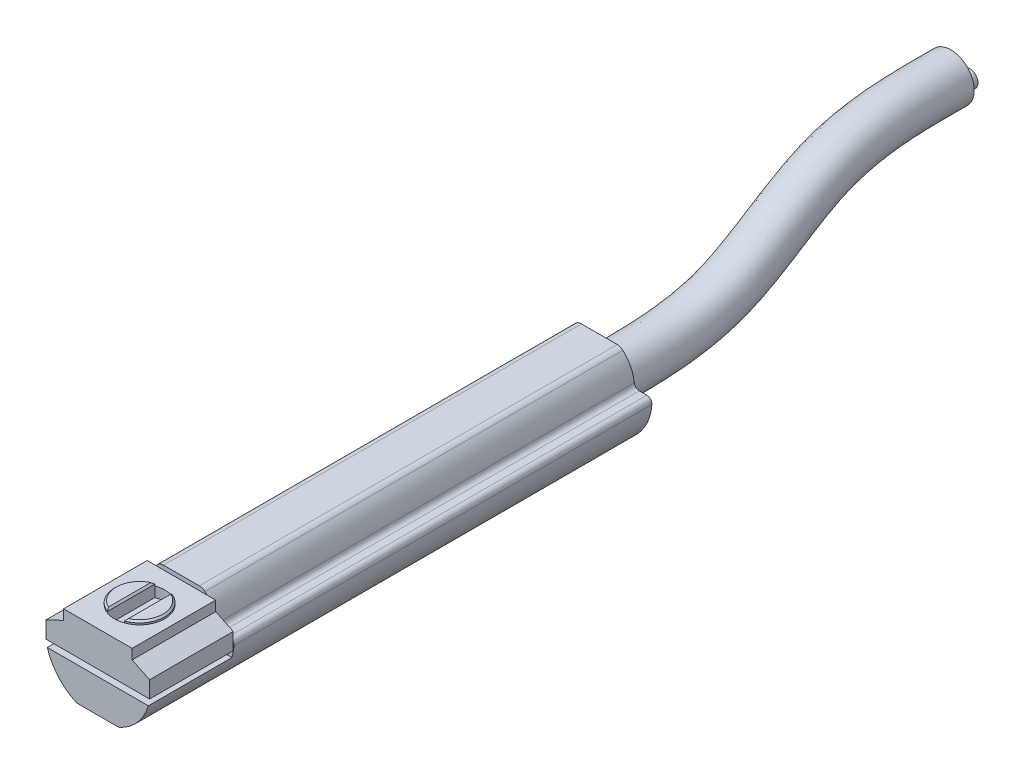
ISO-10303-21;
HEADER;
FILE_DESCRIPTION(('STEP AP214'),'2;1');
FILE_NAME('part.step','',(''),(''),'','','');
FILE_SCHEMA(('AUTOMOTIVE_DESIGN { 1 0 10303 214 1 1 1 1 }'));
ENDSEC;
DATA;
#1=APPLICATION_CONTEXT('core data for automotive mechanical design processes');
#2=APPLICATION_PROTOCOL_DEFINITION('international standard','automotive_design',2000,#1);
#3=PRODUCT_CONTEXT('',#1,'mechanical');
#4=PRODUCT('Part','Part','',(#3));
#5=PRODUCT_RELATED_PRODUCT_CATEGORY('part','',(#4));
#6=PRODUCT_DEFINITION_FORMATION('','',#4);
#7=PRODUCT_DEFINITION_CONTEXT('part definition',#1,'design');
#8=PRODUCT_DEFINITION('design','',#6,#7);
#9=PRODUCT_DEFINITION_SHAPE('','',#8);
#10=(LENGTH_UNIT() NAMED_UNIT(*) SI_UNIT(.MILLI.,.METRE.));
#11=(NAMED_UNIT(*) PLANE_ANGLE_UNIT() SI_UNIT($,.RADIAN.));
#12=(NAMED_UNIT(*) SI_UNIT($,.STERADIAN.) SOLID_ANGLE_UNIT());
#13=UNCERTAINTY_MEASURE_WITH_UNIT(LENGTH_MEASURE(1.E-05),#10,'distance_accuracy_value','');
#14=(GEOMETRIC_REPRESENTATION_CONTEXT(3) GLOBAL_UNCERTAINTY_ASSIGNED_CONTEXT((#13)) GLOBAL_UNIT_ASSIGNED_CONTEXT((#10,
#11,#12)) REPRESENTATION_CONTEXT('',''));
#15=CARTESIAN_POINT('',(0.,0.,0.));
#16=DIRECTION('',(0.,0.,1.));
#17=DIRECTION('',(1.,0.,0.));
#18=AXIS2_PLACEMENT_3D('',#15,#16,#17);
#19=CARTESIAN_POINT('',(0.,1.69,-2.5));
#20=DIRECTION('',(0.,-1.,0.));
#21=DIRECTION('',(0.,0.,-1.));
#22=AXIS2_PLACEMENT_3D('',#19,#20,#21);
#23=CYLINDRICAL_SURFACE('',#22,1.5);
#24=DIRECTION('',(0.,1.,0.));
#25=VECTOR('',#24,1.);
#26=CARTESIAN_POINT('',(0.5,0.89,-3.91421356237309));
#27=LINE('',#26,#25);
#28=CARTESIAN_POINT('',(0.5,1.49,-3.91421356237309));
#29=VERTEX_POINT('',#28);
#30=CARTESIAN_POINT('',(0.5,1.59,-3.91421356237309));
#31=VERTEX_POINT('',#30);
#32=EDGE_CURVE('E291',#29,#31,#27,.T.);
#33=ORIENTED_EDGE('',*,*,#32,.T.);
#34=CARTESIAN_POINT('',(0.,1.59,-2.5));
#35=DIRECTION('',(0.,1.,0.));
#36=DIRECTION('',(0.,0.,1.));
#37=AXIS2_PLACEMENT_3D('',#34,#35,#36);
#38=CIRCLE('',#37,1.5);
#39=CARTESIAN_POINT('',(0.5,1.59,-1.0857864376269));
#40=VERTEX_POINT('',#39);
#41=EDGE_CURVE('E688',#31,#40,#38,.F.);
#42=ORIENTED_EDGE('',*,*,#41,.T.);
#43=DIRECTION('',(0.,1.,0.));
#44=VECTOR('',#43,1.);
#45=CARTESIAN_POINT('',(0.5,0.89,-1.0857864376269));
#46=LINE('',#45,#44);
#47=CARTESIAN_POINT('',(0.5,1.49,-1.0857864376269));
#48=VERTEX_POINT('',#47);
#49=EDGE_CURVE('E295',#48,#40,#46,.T.);
#50=ORIENTED_EDGE('',*,*,#49,.F.);
#51=CARTESIAN_POINT('',(0.,1.49,-2.5));
#52=DIRECTION('',(0.,1.,0.));
#53=DIRECTION('',(0.,0.,1.));
#54=AXIS2_PLACEMENT_3D('',#51,#52,#53);
#55=CIRCLE('',#54,1.5);
#56=EDGE_CURVE('E300',#48,#29,#55,.T.);
#57=ORIENTED_EDGE('',*,*,#56,.T.);
#58=EDGE_LOOP('',(#33,#42,#50,#57));
#59=FACE_BOUND('',#58,.T.);
#60=ADVANCED_FACE('F14',(#59),#23,.T.);
#61=CARTESIAN_POINT('',(0.,1.69,-2.5));
#62=DIRECTION('',(0.,1.,0.));
#63=DIRECTION('',(0.,0.,1.));
#64=AXIS2_PLACEMENT_3D('',#61,#62,#63);
#65=PLANE('',#64);
#66=DIRECTION('',(0.,0.,1.));
#67=VECTOR('',#66,1.);
#68=CARTESIAN_POINT('',(0.6,1.69,-1.0857864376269));
#69=LINE('',#68,#67);
#70=CARTESIAN_POINT('',(0.6,1.69,-3.76491106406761));
#71=VERTEX_POINT('',#70);
#72=CARTESIAN_POINT('',(0.6,1.69,-1.23508893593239));
#73=VERTEX_POINT('',#72);
#74=EDGE_CURVE('E691',#71,#73,#69,.T.);
#75=ORIENTED_EDGE('',*,*,#74,.T.);
#76=CARTESIAN_POINT('',(0.,1.69,-2.5));
#77=DIRECTION('',(0.,1.,0.));
#78=DIRECTION('',(0.,0.,1.));
#79=AXIS2_PLACEMENT_3D('',#76,#77,#78);
#80=CIRCLE('',#79,1.4);
#81=EDGE_CURVE('E686',#73,#71,#80,.T.);
#82=ORIENTED_EDGE('',*,*,#81,.T.);
#83=EDGE_LOOP('',(#75,#82));
#84=FACE_BOUND('',#83,.T.);
#85=ADVANCED_FACE('F607',(#84),#65,.T.);
#86=CARTESIAN_POINT('',(-2.05,1.49,-11.5459911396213));
#87=DIRECTION('',(0.,1.,0.));
#88=DIRECTION('',(0.,0.,1.));
#89=AXIS2_PLACEMENT_3D('',#86,#87,#88);
#90=PLANE('',#89);
#91=DIRECTION('',(1.,0.,0.));
#92=VECTOR('',#91,1.);
#93=CARTESIAN_POINT('',(-2.05,1.49,-5.));
#94=LINE('',#93,#92);
#95=CARTESIAN_POINT('',(-2.05,1.49,-5.));
#96=VERTEX_POINT('',#95);
#97=CARTESIAN_POINT('',(-1.53092352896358,1.49,-5.));
#98=VERTEX_POINT('',#97);
#99=EDGE_CURVE('E310',#96,#98,#94,.T.);
#100=ORIENTED_EDGE('',*,*,#99,.F.);
#101=DIRECTION('',(0.,0.,1.));
#102=VECTOR('',#101,1.);
#103=CARTESIAN_POINT('',(-2.05,1.49,-11.5459911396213));
#104=LINE('',#103,#102);
#105=CARTESIAN_POINT('',(-2.05,1.49,0.));
#106=VERTEX_POINT('',#105);
#107=EDGE_CURVE('E352',#96,#106,#104,.T.);
#108=ORIENTED_EDGE('',*,*,#107,.T.);
#109=DIRECTION('',(-1.,0.,0.));
#110=VECTOR('',#109,1.);
#111=CARTESIAN_POINT('',(-2.05,1.49,0.));
#112=LINE('',#111,#110);
#113=CARTESIAN_POINT('',(2.05,1.49,0.));
#114=VERTEX_POINT('',#113);
#115=EDGE_CURVE('E334',#114,#106,#112,.T.);
#116=ORIENTED_EDGE('',*,*,#115,.F.);
#117=DIRECTION('',(0.,0.,1.));
#118=VECTOR('',#117,1.);
#119=CARTESIAN_POINT('',(2.05,1.49,-11.5459911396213));
#120=LINE('',#119,#118);
#121=CARTESIAN_POINT('',(2.05,1.49,-5.));
#122=VERTEX_POINT('',#121);
#123=EDGE_CURVE('E354',#122,#114,#120,.T.);
#124=ORIENTED_EDGE('',*,*,#123,.F.);
#125=CARTESIAN_POINT('',(1.53092352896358,1.49,-5.));
#126=VERTEX_POINT('',#125);
#127=EDGE_CURVE('E309',#126,#122,#94,.T.);
#128=ORIENTED_EDGE('',*,*,#127,.F.);
#129=DIRECTION('',(-1.,0.,0.));
#130=VECTOR('',#129,1.);
#131=CARTESIAN_POINT('',(-3.5,1.49,-5.));
#132=LINE('',#131,#130);
#133=EDGE_CURVE('E692',#126,#98,#132,.T.);
#134=ORIENTED_EDGE('',*,*,#133,.T.);
#135=EDGE_LOOP('',(#100,#108,#116,#124,#128,#134));
#136=FACE_BOUND('',#135,.T.);
#137=ORIENTED_EDGE('',*,*,#56,.F.);
#138=CARTESIAN_POINT('',(0.,1.49,-2.5));
#139=DIRECTION('',(0.,1.,0.));
#140=DIRECTION('',(0.,0.,1.));
#141=AXIS2_PLACEMENT_3D('',#138,#139,#140);
#142=CIRCLE('',#141,1.5);
#143=CARTESIAN_POINT('',(-0.5,1.49,-1.0857864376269));
#144=VERTEX_POINT('',#143);
#145=EDGE_CURVE('E290',#144,#48,#142,.T.);
#146=ORIENTED_EDGE('',*,*,#145,.F.);
#147=CARTESIAN_POINT('',(-0.5,1.49,-3.91421356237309));
#148=VERTEX_POINT('',#147);
#149=EDGE_CURVE('E299',#148,#144,#55,.T.);
#150=ORIENTED_EDGE('',*,*,#149,.F.);
#151=CARTESIAN_POINT('',(0.,1.49,-2.5));
#152=DIRECTION('',(0.,1.,0.));
#153=DIRECTION('',(0.,0.,1.));
#154=AXIS2_PLACEMENT_3D('',#151,#152,#153);
#155=CIRCLE('',#154,1.5);
#156=EDGE_CURVE('E256',#29,#148,#155,.T.);
#157=ORIENTED_EDGE('',*,*,#156,.F.);
#158=EDGE_LOOP('',(#137,#146,#150,#157));
#159=FACE_BOUND('',#158,.T.);
#160=ADVANCED_FACE('F614',(#136,#159),#90,.T.);
#161=CARTESIAN_POINT('',(-3.5,-1.,-5.));
#162=DIRECTION('',(0.,0.,1.));
#163=DIRECTION('',(1.,0.,0.));
#164=AXIS2_PLACEMENT_3D('',#161,#162,#163);
#165=PLANE('',#164);
#166=ORIENTED_EDGE('',*,*,#133,.F.);
#167=CARTESIAN_POINT('',(0.,0.0525462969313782,-5.));
#168=DIRECTION('',(0.,0.,1.));
#169=DIRECTION('',(1.,0.,0.));
#170=AXIS2_PLACEMENT_3D('',#167,#168,#169);
#171=CIRCLE('',#170,2.1);
#172=CARTESIAN_POINT('',(1.40747111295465,1.61107928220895,-5.));
#173=VERTEX_POINT('',#172);
#174=EDGE_CURVE('E397',#173,#126,#171,.F.);
#175=ORIENTED_EDGE('',*,*,#174,.F.);
#176=CARTESIAN_POINT('',(1.07235894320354,1.24,-5.));
#177=DIRECTION('',(0.,0.,1.));
#178=DIRECTION('',(1.,0.,0.));
#179=AXIS2_PLACEMENT_3D('',#176,#177,#178);
#180=CIRCLE('',#179,0.5);
#181=CARTESIAN_POINT('',(1.07235894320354,1.74,-5.));
#182=VERTEX_POINT('',#181);
#183=EDGE_CURVE('E400',#182,#173,#180,.F.);
#184=ORIENTED_EDGE('',*,*,#183,.F.);
#185=DIRECTION('',(-1.,0.,0.));
#186=VECTOR('',#185,1.);
#187=CARTESIAN_POINT('',(-3.5,1.74,-5.));
#188=LINE('',#187,#186);
#189=CARTESIAN_POINT('',(-1.07235894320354,1.74,-5.));
#190=VERTEX_POINT('',#189);
#191=EDGE_CURVE('E366',#182,#190,#188,.T.);
#192=ORIENTED_EDGE('',*,*,#191,.T.);
#193=CARTESIAN_POINT('',(-1.07235894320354,1.24,-5.));
#194=DIRECTION('',(0.,0.,1.));
#195=DIRECTION('',(1.,0.,0.));
#196=AXIS2_PLACEMENT_3D('',#193,#194,#195);
#197=CIRCLE('',#196,0.5);
#198=CARTESIAN_POINT('',(-1.40747111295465,1.61107928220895,-5.));
#199=VERTEX_POINT('',#198);
#200=EDGE_CURVE('E383',#199,#190,#197,.F.);
#201=ORIENTED_EDGE('',*,*,#200,.F.);
#202=CARTESIAN_POINT('',(0.,0.0525462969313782,-5.));
#203=DIRECTION('',(0.,0.,1.));
#204=DIRECTION('',(1.,0.,0.));
#205=AXIS2_PLACEMENT_3D('',#202,#203,#204);
#206=CIRCLE('',#205,2.1);
#207=EDGE_CURVE('E1280',#98,#199,#206,.F.);
#208=ORIENTED_EDGE('',*,*,#207,.F.);
#209=EDGE_LOOP('',(#166,#175,#184,#192,#201,#208));
#210=FACE_BOUND('',#209,.T.);
#211=ADVANCED_FACE('F858',(#210),#165,.T.);
#212=CARTESIAN_POINT('',(-1.07235894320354,1.24,-30.));
#213=DIRECTION('',(0.,0.,1.));
#214=DIRECTION('',(1.,0.,0.));
#215=AXIS2_PLACEMENT_3D('',#212,#213,#214);
#216=CYLINDRICAL_SURFACE('',#215,0.5);
#217=DIRECTION('',(0.,0.,1.));
#218=VECTOR('',#217,1.);
#219=CARTESIAN_POINT('',(-1.40747111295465,1.61107928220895,-30.));
#220=LINE('',#219,#218);
#221=CARTESIAN_POINT('',(-1.40747111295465,1.61107928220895,-30.));
#222=VERTEX_POINT('',#221);
#223=EDGE_CURVE('E475',#222,#199,#220,.T.);
#224=ORIENTED_EDGE('',*,*,#223,.T.);
#225=ORIENTED_EDGE('',*,*,#200,.T.);
#226=DIRECTION('',(0.,0.,1.));
#227=VECTOR('',#226,1.);
#228=CARTESIAN_POINT('',(-1.07235894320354,1.74,-30.));
#229=LINE('',#228,#227);
#230=CARTESIAN_POINT('',(-1.07235894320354,1.74,-30.));
#231=VERTEX_POINT('',#230);
#232=EDGE_CURVE('E476',#231,#190,#229,.T.);
#233=ORIENTED_EDGE('',*,*,#232,.F.);
#234=CARTESIAN_POINT('',(-1.07235894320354,1.24,-30.));
#235=DIRECTION('',(0.,0.,1.));
#236=DIRECTION('',(-1.,0.,0.));
#237=AXIS2_PLACEMENT_3D('',#234,#235,#236);
#238=CIRCLE('',#237,0.5);
#239=EDGE_CURVE('E427',#231,#222,#238,.T.);
#240=ORIENTED_EDGE('',*,*,#239,.T.);
#241=EDGE_LOOP('',(#224,#225,#233,#240));
#242=FACE_BOUND('',#241,.T.);
#243=ADVANCED_FACE('F16',(#242),#216,.T.);
#244=CARTESIAN_POINT('',(-1.07235894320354,1.74,-30.));
#245=DIRECTION('',(0.,1.,0.));
#246=DIRECTION('',(0.,0.,1.));
#247=AXIS2_PLACEMENT_3D('',#244,#245,#246);
#248=PLANE('',#247);
#249=ORIENTED_EDGE('',*,*,#232,.T.);
#250=ORIENTED_EDGE('',*,*,#191,.F.);
#251=DIRECTION('',(0.,0.,1.));
#252=VECTOR('',#251,1.);
#253=CARTESIAN_POINT('',(1.07235894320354,1.74,-30.));
#254=LINE('',#253,#252);
#255=CARTESIAN_POINT('',(1.07235894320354,1.74,-30.));
#256=VERTEX_POINT('',#255);
#257=EDGE_CURVE('E480',#256,#182,#254,.T.);
#258=ORIENTED_EDGE('',*,*,#257,.F.);
#259=DIRECTION('',(-1.,0.,0.));
#260=VECTOR('',#259,1.);
#261=CARTESIAN_POINT('',(-1.07235894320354,1.74,-30.));
#262=LINE('',#261,#260);
#263=EDGE_CURVE('E472',#256,#231,#262,.T.);
#264=ORIENTED_EDGE('',*,*,#263,.T.);
#265=EDGE_LOOP('',(#249,#250,#258,#264));
#266=FACE_BOUND('',#265,.T.);
#267=ADVANCED_FACE('F544',(#266),#248,.T.);
#268=CARTESIAN_POINT('',(1.07235894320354,1.24,-30.));
#269=DIRECTION('',(0.,0.,1.));
#270=DIRECTION('',(1.,0.,0.));
#271=AXIS2_PLACEMENT_3D('',#268,#269,#270);
#272=CYLINDRICAL_SURFACE('',#271,0.5);
#273=ORIENTED_EDGE('',*,*,#257,.T.);
#274=ORIENTED_EDGE('',*,*,#183,.T.);
#275=DIRECTION('',(0.,0.,1.));
#276=VECTOR('',#275,1.);
#277=CARTESIAN_POINT('',(1.40747111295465,1.61107928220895,-30.));
#278=LINE('',#277,#276);
#279=CARTESIAN_POINT('',(1.40747111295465,1.61107928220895,-30.));
#280=VERTEX_POINT('',#279);
#281=EDGE_CURVE('E483',#280,#173,#278,.T.);
#282=ORIENTED_EDGE('',*,*,#281,.F.);
#283=CARTESIAN_POINT('',(1.07235894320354,1.24,-30.));
#284=DIRECTION('',(0.,0.,1.));
#285=DIRECTION('',(1.,0.,0.));
#286=AXIS2_PLACEMENT_3D('',#283,#284,#285);
#287=CIRCLE('',#286,0.5);
#288=EDGE_CURVE('E469',#280,#256,#287,.T.);
#289=ORIENTED_EDGE('',*,*,#288,.T.);
#290=EDGE_LOOP('',(#273,#274,#282,#289));
#291=FACE_BOUND('',#290,.T.);
#292=ADVANCED_FACE('F547',(#291),#272,.T.);
#293=CARTESIAN_POINT('',(0.,0.0525462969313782,-30.));
#294=DIRECTION('',(0.,0.,1.));
#295=DIRECTION('',(1.,0.,0.));
#296=AXIS2_PLACEMENT_3D('',#293,#294,#295);
#297=CYLINDRICAL_SURFACE('',#296,2.1);
#298=ORIENTED_EDGE('',*,*,#281,.T.);
#299=ORIENTED_EDGE('',*,*,#174,.T.);
#300=CARTESIAN_POINT('',(2.08880784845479,0.269068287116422,-5.));
#301=VERTEX_POINT('',#300);
#302=EDGE_CURVE('E396',#126,#301,#171,.F.);
#303=ORIENTED_EDGE('',*,*,#302,.T.);
#304=DIRECTION('',(0.,0.,1.));
#305=VECTOR('',#304,1.);
#306=CARTESIAN_POINT('',(2.08880784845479,0.269068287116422,-30.));
#307=LINE('',#306,#305);
#308=CARTESIAN_POINT('',(2.08880784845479,0.269068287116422,-30.));
#309=VERTEX_POINT('',#308);
#310=EDGE_CURVE('E486',#309,#301,#307,.T.);
#311=ORIENTED_EDGE('',*,*,#310,.F.);
#312=CARTESIAN_POINT('',(0.,0.0525462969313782,-30.));
#313=DIRECTION('',(0.,0.,1.));
#314=DIRECTION('',(1.,0.,0.));
#315=AXIS2_PLACEMENT_3D('',#312,#313,#314);
#316=CIRCLE('',#315,2.1);
#317=EDGE_CURVE('E466',#309,#280,#316,.T.);
#318=ORIENTED_EDGE('',*,*,#317,.T.);
#319=EDGE_LOOP('',(#298,#299,#303,#311,#318));
#320=FACE_BOUND('',#319,.T.);
#321=ADVANCED_FACE('F551',(#320),#297,.T.);
#322=CARTESIAN_POINT('',(2.38720896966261,0.3,-30.));
#323=DIRECTION('',(0.,0.,1.));
#324=DIRECTION('',(1.,0.,0.));
#325=AXIS2_PLACEMENT_3D('',#322,#323,#324);
#326=CYLINDRICAL_SURFACE('',#325,0.3);
#327=ORIENTED_EDGE('',*,*,#310,.T.);
#328=CARTESIAN_POINT('',(2.38720896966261,0.3,-5.));
#329=DIRECTION('',(0.,0.,1.));
#330=DIRECTION('',(1.,0.,0.));
#331=AXIS2_PLACEMENT_3D('',#328,#329,#330);
#332=CIRCLE('',#331,0.3);
#333=CARTESIAN_POINT('',(2.38720896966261,0.,-5.));
#334=VERTEX_POINT('',#333);
#335=EDGE_CURVE('E394',#301,#334,#332,.T.);
#336=ORIENTED_EDGE('',*,*,#335,.T.);
#337=DIRECTION('',(0.,0.,1.));
#338=VECTOR('',#337,1.);
#339=CARTESIAN_POINT('',(2.38720896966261,0.,-30.));
#340=LINE('',#339,#338);
#341=CARTESIAN_POINT('',(2.38720896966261,0.,-30.));
#342=VERTEX_POINT('',#341);
#343=EDGE_CURVE('E489',#342,#334,#340,.T.);
#344=ORIENTED_EDGE('',*,*,#343,.F.);
#345=CARTESIAN_POINT('',(2.38720896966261,0.3,-30.));
#346=DIRECTION('',(0.,0.,-1.));
#347=DIRECTION('',(1.,0.,0.));
#348=AXIS2_PLACEMENT_3D('',#345,#346,#347);
#349=CIRCLE('',#348,0.3);
#350=EDGE_CURVE('E463',#342,#309,#349,.T.);
#351=ORIENTED_EDGE('',*,*,#350,.T.);
#352=EDGE_LOOP('',(#327,#336,#344,#351));
#353=FACE_BOUND('',#352,.T.);
#354=ADVANCED_FACE('F555',(#353),#326,.F.);
#355=CARTESIAN_POINT('',(2.38720896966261,0.,-30.));
#356=DIRECTION('',(0.,1.,0.));
#357=DIRECTION('',(0.,0.,1.));
#358=AXIS2_PLACEMENT_3D('',#355,#356,#357);
#359=PLANE('',#358);
#360=ORIENTED_EDGE('',*,*,#343,.T.);
#361=DIRECTION('',(1.,0.,0.));
#362=VECTOR('',#361,1.);
#363=CARTESIAN_POINT('',(2.38720896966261,0.,-5.));
#364=LINE('',#363,#362);
#365=CARTESIAN_POINT('',(2.84524457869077,0.,-5.));
#366=VERTEX_POINT('',#365);
#367=EDGE_CURVE('E392',#334,#366,#364,.T.);
#368=ORIENTED_EDGE('',*,*,#367,.T.);
#369=DIRECTION('',(0.,0.,1.));
#370=VECTOR('',#369,1.);
#371=CARTESIAN_POINT('',(2.84524457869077,0.,-30.));
#372=LINE('',#371,#370);
#373=CARTESIAN_POINT('',(2.84524457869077,0.,-30.));
#374=VERTEX_POINT('',#373);
#375=EDGE_CURVE('E492',#374,#366,#372,.T.);
#376=ORIENTED_EDGE('',*,*,#375,.F.);
#377=DIRECTION('',(-1.,0.,0.));
#378=VECTOR('',#377,1.);
#379=CARTESIAN_POINT('',(2.38720896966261,0.,-30.));
#380=LINE('',#379,#378);
#381=EDGE_CURVE('E460',#374,#342,#380,.T.);
#382=ORIENTED_EDGE('',*,*,#381,.T.);
#383=EDGE_LOOP('',(#360,#368,#376,#382));
#384=FACE_BOUND('',#383,.T.);
#385=ADVANCED_FACE('F559',(#384),#359,.T.);
#386=CARTESIAN_POINT('',(2.84524457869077,-0.3,-30.));
#387=DIRECTION('',(0.,0.,1.));
#388=DIRECTION('',(1.,0.,0.));
#389=AXIS2_PLACEMENT_3D('',#386,#387,#388);
#390=CYLINDRICAL_SURFACE('',#389,0.3);
#391=ORIENTED_EDGE('',*,*,#375,.T.);
#392=CARTESIAN_POINT('',(2.84524457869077,-0.3,-5.));
#393=DIRECTION('',(0.,0.,1.));
#394=DIRECTION('',(1.,0.,0.));
#395=AXIS2_PLACEMENT_3D('',#392,#393,#394);
#396=CIRCLE('',#395,0.3);
#397=CARTESIAN_POINT('',(3.1,-0.141571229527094,-5.));
#398=VERTEX_POINT('',#397);
#399=EDGE_CURVE('E390',#366,#398,#396,.F.);
#400=ORIENTED_EDGE('',*,*,#399,.T.);
#401=CARTESIAN_POINT('',(3.14455439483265,-0.320337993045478,-5.));
#402=VERTEX_POINT('',#401);
#403=EDGE_CURVE('E389',#398,#402,#396,.F.);
#404=ORIENTED_EDGE('',*,*,#403,.T.);
#405=DIRECTION('',(0.,0.,1.));
#406=VECTOR('',#405,1.);
#407=CARTESIAN_POINT('',(3.14455439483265,-0.320337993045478,-30.));
#408=LINE('',#407,#406);
#409=CARTESIAN_POINT('',(3.14455439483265,-0.320337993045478,-30.));
#410=VERTEX_POINT('',#409);
#411=EDGE_CURVE('E495',#410,#402,#408,.T.);
#412=ORIENTED_EDGE('',*,*,#411,.F.);
#413=CARTESIAN_POINT('',(2.84524457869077,-0.3,-30.));
#414=DIRECTION('',(0.,0.,1.));
#415=DIRECTION('',(-1.,0.,0.));
#416=AXIS2_PLACEMENT_3D('',#413,#414,#415);
#417=CIRCLE('',#416,0.3);
#418=EDGE_CURVE('E457',#410,#374,#417,.T.);
#419=ORIENTED_EDGE('',*,*,#418,.T.);
#420=EDGE_LOOP('',(#391,#400,#404,#412,#419));
#421=FACE_BOUND('',#420,.T.);
#422=ADVANCED_FACE('F563',(#421),#390,.T.);
#423=CARTESIAN_POINT('',(-2.84524457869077,-0.3,-30.));
#424=DIRECTION('',(0.,0.,1.));
#425=DIRECTION('',(1.,0.,0.));
#426=AXIS2_PLACEMENT_3D('',#423,#424,#425);
#427=CYLINDRICAL_SURFACE('',#426,0.3);
#428=DIRECTION('',(0.,0.,1.));
#429=VECTOR('',#428,1.);
#430=CARTESIAN_POINT('',(-3.14455439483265,-0.320337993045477,-30.));
#431=LINE('',#430,#429);
#432=CARTESIAN_POINT('',(-3.14455439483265,-0.320337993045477,-30.));
#433=VERTEX_POINT('',#432);
#434=CARTESIAN_POINT('',(-3.14455439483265,-0.320337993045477,-5.));
#435=VERTEX_POINT('',#434);
#436=EDGE_CURVE('E507',#433,#435,#431,.T.);
#437=ORIENTED_EDGE('',*,*,#436,.T.);
#438=CARTESIAN_POINT('',(-2.84524457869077,-0.3,-5.));
#439=DIRECTION('',(0.,0.,1.));
#440=DIRECTION('',(1.,0.,0.));
#441=AXIS2_PLACEMENT_3D('',#438,#439,#440);
#442=CIRCLE('',#441,0.3);
#443=CARTESIAN_POINT('',(-3.1,-0.141571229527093,-5.));
#444=VERTEX_POINT('',#443);
#445=EDGE_CURVE('E377',#435,#444,#442,.F.);
#446=ORIENTED_EDGE('',*,*,#445,.T.);
#447=CARTESIAN_POINT('',(-2.84524457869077,0.,-5.));
#448=VERTEX_POINT('',#447);
#449=EDGE_CURVE('E376',#444,#448,#442,.F.);
#450=ORIENTED_EDGE('',*,*,#449,.T.);
#451=DIRECTION('',(0.,0.,1.));
#452=VECTOR('',#451,1.);
#453=CARTESIAN_POINT('',(-2.84524457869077,0.,-30.));
#454=LINE('',#453,#452);
#455=CARTESIAN_POINT('',(-2.84524457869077,0.,-30.));
#456=VERTEX_POINT('',#455);
#457=EDGE_CURVE('E510',#456,#448,#454,.T.);
#458=ORIENTED_EDGE('',*,*,#457,.F.);
#459=CARTESIAN_POINT('',(-2.84524457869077,-0.3,-30.));
#460=DIRECTION('',(0.,0.,1.));
#461=DIRECTION('',(-1.,0.,0.));
#462=AXIS2_PLACEMENT_3D('',#459,#460,#461);
#463=CIRCLE('',#462,0.3);
#464=EDGE_CURVE('E439',#456,#433,#463,.T.);
#465=ORIENTED_EDGE('',*,*,#464,.T.);
#466=EDGE_LOOP('',(#437,#446,#450,#458,#465));
#467=FACE_BOUND('',#466,.T.);
#468=ADVANCED_FACE('F567',(#467),#427,.T.);
#469=CARTESIAN_POINT('',(-2.84524457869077,0.,-30.));
#470=DIRECTION('',(0.,1.,0.));
#471=DIRECTION('',(0.,0.,1.));
#472=AXIS2_PLACEMENT_3D('',#469,#470,#471);
#473=PLANE('',#472);
#474=ORIENTED_EDGE('',*,*,#457,.T.);
#475=DIRECTION('',(1.,0.,0.));
#476=VECTOR('',#475,1.);
#477=CARTESIAN_POINT('',(-2.84524457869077,0.,-5.));
#478=LINE('',#477,#476);
#479=CARTESIAN_POINT('',(-2.38720896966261,0.,-5.));
#480=VERTEX_POINT('',#479);
#481=EDGE_CURVE('E374',#448,#480,#478,.T.);
#482=ORIENTED_EDGE('',*,*,#481,.T.);
#483=DIRECTION('',(0.,0.,1.));
#484=VECTOR('',#483,1.);
#485=CARTESIAN_POINT('',(-2.38720896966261,0.,-30.));
#486=LINE('',#485,#484);
#487=CARTESIAN_POINT('',(-2.38720896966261,0.,-30.));
#488=VERTEX_POINT('',#487);
#489=EDGE_CURVE('E513',#488,#480,#486,.T.);
#490=ORIENTED_EDGE('',*,*,#489,.F.);
#491=DIRECTION('',(-1.,0.,0.));
#492=VECTOR('',#491,1.);
#493=CARTESIAN_POINT('',(-2.84524457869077,0.,-30.));
#494=LINE('',#493,#492);
#495=EDGE_CURVE('E436',#488,#456,#494,.T.);
#496=ORIENTED_EDGE('',*,*,#495,.T.);
#497=EDGE_LOOP('',(#474,#482,#490,#496));
#498=FACE_BOUND('',#497,.T.);
#499=ADVANCED_FACE('F590',(#498),#473,.T.);
#500=CARTESIAN_POINT('',(-2.38720896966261,0.3,-30.));
#501=DIRECTION('',(0.,0.,1.));
#502=DIRECTION('',(1.,0.,0.));
#503=AXIS2_PLACEMENT_3D('',#500,#501,#502);
#504=CYLINDRICAL_SURFACE('',#503,0.3);
#505=ORIENTED_EDGE('',*,*,#489,.T.);
#506=CARTESIAN_POINT('',(-2.38720896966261,0.3,-5.));
#507=DIRECTION('',(0.,0.,1.));
#508=DIRECTION('',(1.,0.,0.));
#509=AXIS2_PLACEMENT_3D('',#506,#507,#508);
#510=CIRCLE('',#509,0.3);
#511=CARTESIAN_POINT('',(-2.08880784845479,0.269068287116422,-5.));
#512=VERTEX_POINT('',#511);
#513=EDGE_CURVE('E372',#480,#512,#510,.T.);
#514=ORIENTED_EDGE('',*,*,#513,.T.);
#515=DIRECTION('',(0.,0.,1.));
#516=VECTOR('',#515,1.);
#517=CARTESIAN_POINT('',(-2.08880784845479,0.269068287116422,-30.));
#518=LINE('',#517,#516);
#519=CARTESIAN_POINT('',(-2.08880784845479,0.269068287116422,-30.));
#520=VERTEX_POINT('',#519);
#521=EDGE_CURVE('E516',#520,#512,#518,.T.);
#522=ORIENTED_EDGE('',*,*,#521,.F.);
#523=CARTESIAN_POINT('',(-2.38720896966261,0.3,-30.));
#524=DIRECTION('',(0.,0.,-1.));
#525=DIRECTION('',(-1.,0.,0.));
#526=AXIS2_PLACEMENT_3D('',#523,#524,#525);
#527=CIRCLE('',#526,0.3);
#528=EDGE_CURVE('E433',#520,#488,#527,.T.);
#529=ORIENTED_EDGE('',*,*,#528,.T.);
#530=EDGE_LOOP('',(#505,#514,#522,#529));
#531=FACE_BOUND('',#530,.T.);
#532=ADVANCED_FACE('F594',(#531),#504,.F.);
#533=CARTESIAN_POINT('',(0.,0.0525462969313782,-30.));
#534=DIRECTION('',(0.,0.,1.));
#535=DIRECTION('',(1.,0.,0.));
#536=AXIS2_PLACEMENT_3D('',#533,#534,#535);
#537=CYLINDRICAL_SURFACE('',#536,2.1);
#538=ORIENTED_EDGE('',*,*,#521,.T.);
#539=EDGE_CURVE('E1285',#512,#98,#206,.F.);
#540=ORIENTED_EDGE('',*,*,#539,.T.);
#541=ORIENTED_EDGE('',*,*,#207,.T.);
#542=ORIENTED_EDGE('',*,*,#223,.F.);
#543=CARTESIAN_POINT('',(0.,0.0525462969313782,-30.));
#544=DIRECTION('',(0.,0.,1.));
#545=DIRECTION('',(1.,0.,0.));
#546=AXIS2_PLACEMENT_3D('',#543,#544,#545);
#547=CIRCLE('',#546,2.1);
#548=EDGE_CURVE('E430',#222,#520,#547,.T.);
#549=ORIENTED_EDGE('',*,*,#548,.T.);
#550=EDGE_LOOP('',(#538,#540,#541,#542,#549));
#551=FACE_BOUND('',#550,.T.);
#552=ADVANCED_FACE('F597',(#551),#537,.T.);
#553=CARTESIAN_POINT('',(1.4,4.55665084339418,-51.0249210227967));
#554=DIRECTION('',(0.,0.00289425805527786,0.999995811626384));
#555=DIRECTION('',(0.,-0.999995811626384,0.00289425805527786));
#556=AXIS2_PLACEMENT_3D('',#553,#554,#555);
#557=PLANE('',#556);
#558=CARTESIAN_POINT('',(0.625,4.55665084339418,-51.0249210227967));
#559=DIRECTION('',(0.,0.00289425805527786,0.999995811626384));
#560=DIRECTION('',(0.,-0.999995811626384,0.00289425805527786));
#561=AXIS2_PLACEMENT_3D('',#558,#559,#560);
#562=CIRCLE('',#561,0.500000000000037);
#563=CARTESIAN_POINT('',(0.625,4.05665293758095,-51.0234738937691));
#564=VERTEX_POINT('',#563);
#565=EDGE_CURVE('E479',#564,#564,#562,.F.);
#566=ORIENTED_EDGE('',*,*,#565,.F.);
#567=EDGE_LOOP('',(#566));
#568=FACE_BOUND('',#567,.T.);
#569=CARTESIAN_POINT('',(0.,4.55665084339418,-51.0249210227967));
#570=DIRECTION('',(0.,0.00289425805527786,0.999995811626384));
#571=DIRECTION('',(0.,-0.999995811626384,0.00289425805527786));
#572=AXIS2_PLACEMENT_3D('',#569,#570,#571);
#573=CIRCLE('',#572,1.4);
#574=CARTESIAN_POINT('',(-1.4,4.55665084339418,-51.0249210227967));
#575=VERTEX_POINT('',#574);
#576=EDGE_CURVE('E410',#575,#575,#573,.T.);
#577=ORIENTED_EDGE('',*,*,#576,.F.);
#578=EDGE_LOOP('',(#577));
#579=FACE_BOUND('',#578,.T.);
#580=CARTESIAN_POINT('',(-0.625,4.55665084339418,-51.0249210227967));
#581=DIRECTION('',(0.,0.00289425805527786,0.999995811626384));
#582=DIRECTION('',(0.,-0.999995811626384,0.00289425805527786));
#583=AXIS2_PLACEMENT_3D('',#580,#581,#582);
#584=CIRCLE('',#583,0.500000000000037);
#585=CARTESIAN_POINT('',(-0.625,4.05665293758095,-51.0234738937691));
#586=VERTEX_POINT('',#585);
#587=EDGE_CURVE('E1293',#586,#586,#584,.F.);
#588=ORIENTED_EDGE('',*,*,#587,.F.);
#589=EDGE_LOOP('',(#588));
#590=FACE_BOUND('',#589,.T.);
#591=ADVANCED_FACE('F541',(#568,#579,#590),#557,.F.);
#592=CARTESIAN_POINT('',(-1.07235894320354,1.24,-30.));
#593=DIRECTION('',(0.,0.,-1.));
#594=DIRECTION('',(-1.,0.,0.));
#595=AXIS2_PLACEMENT_3D('',#592,#593,#594);
#596=PLANE('',#595);
#597=ORIENTED_EDGE('',*,*,#239,.F.);
#598=ORIENTED_EDGE('',*,*,#263,.F.);
#599=ORIENTED_EDGE('',*,*,#288,.F.);
#600=ORIENTED_EDGE('',*,*,#317,.F.);
#601=ORIENTED_EDGE('',*,*,#350,.F.);
#602=ORIENTED_EDGE('',*,*,#381,.F.);
#603=ORIENTED_EDGE('',*,*,#418,.F.);
#604=CARTESIAN_POINT('',(0.,-0.106666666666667,-30.));
#605=DIRECTION('',(0.,0.,1.));
#606=DIRECTION('',(1.,0.,0.));
#607=AXIS2_PLACEMENT_3D('',#604,#605,#606);
#608=CIRCLE('',#607,3.1518054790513);
#609=CARTESIAN_POINT('',(1.31114541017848,-2.9728096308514,-30.));
#610=VERTEX_POINT('',#609);
#611=EDGE_CURVE('E454',#610,#410,#608,.T.);
#612=ORIENTED_EDGE('',*,*,#611,.F.);
#613=CARTESIAN_POINT('',(1.18634594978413,-2.7,-30.));
#614=DIRECTION('',(0.,0.,1.));
#615=DIRECTION('',(1.,0.,0.));
#616=AXIS2_PLACEMENT_3D('',#613,#614,#615);
#617=CIRCLE('',#616,0.3);
#618=CARTESIAN_POINT('',(1.18634594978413,-3.,-30.));
#619=VERTEX_POINT('',#618);
#620=EDGE_CURVE('E451',#619,#610,#617,.T.);
#621=ORIENTED_EDGE('',*,*,#620,.F.);
#622=DIRECTION('',(1.,0.,0.));
#623=VECTOR('',#622,1.);
#624=CARTESIAN_POINT('',(-1.18634594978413,-3.,-30.));
#625=LINE('',#624,#623);
#626=CARTESIAN_POINT('',(-1.18634594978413,-3.,-30.));
#627=VERTEX_POINT('',#626);
#628=EDGE_CURVE('E448',#627,#619,#625,.T.);
#629=ORIENTED_EDGE('',*,*,#628,.F.);
#630=CARTESIAN_POINT('',(-1.18634594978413,-2.7,-30.));
#631=DIRECTION('',(0.,0.,1.));
#632=DIRECTION('',(1.,0.,0.));
#633=AXIS2_PLACEMENT_3D('',#630,#631,#632);
#634=CIRCLE('',#633,0.3);
#635=CARTESIAN_POINT('',(-1.31114541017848,-2.9728096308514,-30.));
#636=VERTEX_POINT('',#635);
#637=EDGE_CURVE('E445',#636,#627,#634,.T.);
#638=ORIENTED_EDGE('',*,*,#637,.F.);
#639=CARTESIAN_POINT('',(0.,-0.106666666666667,-30.));
#640=DIRECTION('',(0.,0.,1.));
#641=DIRECTION('',(1.,0.,0.));
#642=AXIS2_PLACEMENT_3D('',#639,#640,#641);
#643=CIRCLE('',#642,3.1518054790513);
#644=EDGE_CURVE('E442',#433,#636,#643,.T.);
#645=ORIENTED_EDGE('',*,*,#644,.F.);
#646=ORIENTED_EDGE('',*,*,#464,.F.);
#647=ORIENTED_EDGE('',*,*,#495,.F.);
#648=ORIENTED_EDGE('',*,*,#528,.F.);
#649=ORIENTED_EDGE('',*,*,#548,.F.);
#650=EDGE_LOOP('',(#597,#598,#599,#600,#601,#602,#603,#612,#621,#629,#638,#645,#646,#647,#648,#649));
#651=FACE_BOUND('',#650,.T.);
#652=CARTESIAN_POINT('',(0.,-2.035,-30.));
#653=CARTESIAN_POINT('',(0.0785448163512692,-2.03499247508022,-30.));
#654=CARTESIAN_POINT('',(0.157259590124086,-2.02835030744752,-30.));
#655=CARTESIAN_POINT('',(0.273593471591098,-2.00857575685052,-30.));
#656=CARTESIAN_POINT('',(0.312140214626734,-2.00032855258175,-30.));
#657=CARTESIAN_POINT('',(0.388439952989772,-1.98060992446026,-30.));
#658=CARTESIAN_POINT('',(0.426192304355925,-1.96913598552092,-30.));
#659=CARTESIAN_POINT('',(0.537644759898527,-1.93003705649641,-30.));
#660=CARTESIAN_POINT('',(0.609745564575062,-1.89769981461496,-30.));
#661=CARTESIAN_POINT('',(0.747489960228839,-1.82136362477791,-30.));
#662=CARTESIAN_POINT('',(0.813133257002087,-1.77736414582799,-30.));
#663=CARTESIAN_POINT('',(0.905327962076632,-1.70361443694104,-30.));
#664=CARTESIAN_POINT('',(0.935031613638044,-1.67772025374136,-30.));
#665=CARTESIAN_POINT('',(0.99212632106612,-1.62355084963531,-30.));
#666=CARTESIAN_POINT('',(1.0195195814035,-1.59527795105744,-30.));
#667=CARTESIAN_POINT('',(1.09799564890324,-1.50711532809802,-30.));
#668=CARTESIAN_POINT('',(1.14539275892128,-1.44386723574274,-30.));
#669=CARTESIAN_POINT('',(1.2288669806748,-1.31034659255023,-30.));
#670=CARTESIAN_POINT('',(1.26494466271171,-1.24007439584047,-30.));
#671=CARTESIAN_POINT('',(1.32479666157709,-1.09446300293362,-30.));
#672=CARTESIAN_POINT('',(1.34857117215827,-1.01912388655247,-30.));
#673=CARTESIAN_POINT('',(1.38313276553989,-0.865525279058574,-30.));
#674=CARTESIAN_POINT('',(1.39391974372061,-0.787265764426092,-30.));
#675=CARTESIAN_POINT('',(1.40220243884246,-0.630045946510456,-30.));
#676=CARTESIAN_POINT('',(1.39969816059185,-0.551085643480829,-30.));
#677=CARTESIAN_POINT('',(1.38146871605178,-0.39470639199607,-30.));
#678=CARTESIAN_POINT('',(1.36574355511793,-0.317287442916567,-30.));
#679=CARTESIAN_POINT('',(1.32151891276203,-0.166188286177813,-30.));
#680=CARTESIAN_POINT('',(1.29301941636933,-0.0925080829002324,-30.));
#681=CARTESIAN_POINT('',(1.22405508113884,0.0490218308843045,-30.));
#682=CARTESIAN_POINT('',(1.18359024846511,0.116871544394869,-30.));
#683=CARTESIAN_POINT('',(1.09184393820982,0.244814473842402,-30.));
#684=CARTESIAN_POINT('',(1.04056246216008,0.304907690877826,-30.));
#685=CARTESIAN_POINT('',(0.928638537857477,0.41563178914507,-30.));
#686=CARTESIAN_POINT('',(0.867996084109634,0.466262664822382,-30.));
#687=CARTESIAN_POINT('',(0.739071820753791,0.556624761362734,-30.));
#688=CARTESIAN_POINT('',(0.670790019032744,0.59635599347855,-30.));
#689=CARTESIAN_POINT('',(0.528525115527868,0.663790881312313,-30.));
#690=CARTESIAN_POINT('',(0.454542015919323,0.691494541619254,-30.));
#691=CARTESIAN_POINT('',(0.302975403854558,0.734088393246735,-30.));
#692=CARTESIAN_POINT('',(0.225391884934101,0.748978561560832,-30.));
#693=CARTESIAN_POINT('',(0.0688238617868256,0.765520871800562,-30.));
#694=CARTESIAN_POINT('',(-0.0101606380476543,0.767173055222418,-30.));
#695=CARTESIAN_POINT('',(-0.167276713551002,0.757199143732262,-30.));
#696=CARTESIAN_POINT('',(-0.24540828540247,0.74557298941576,-30.));
#697=CARTESIAN_POINT('',(-0.398648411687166,0.709347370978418,-30.));
#698=CARTESIAN_POINT('',(-0.47375688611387,0.684747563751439,-30.));
#699=CARTESIAN_POINT('',(-0.582434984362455,0.638704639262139,-30.));
#700=CARTESIAN_POINT('',(-0.61800279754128,0.62182937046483,-30.));
#701=CARTESIAN_POINT('',(-0.687627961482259,0.585130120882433,-30.));
#702=CARTESIAN_POINT('',(-0.721683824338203,0.565303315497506,-30.));
#703=CARTESIAN_POINT('',(-0.821113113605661,0.50164186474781,-30.));
#704=CARTESIAN_POINT('',(-0.883845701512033,0.453584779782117,-30.));
#705=CARTESIAN_POINT('',(-1.00033780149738,0.347611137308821,-30.));
#706=CARTESIAN_POINT('',(-1.05409755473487,0.289694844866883,-30.));
#707=CARTESIAN_POINT('',(-1.12687442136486,0.196692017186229,-30.));
#708=CARTESIAN_POINT('',(-1.14984318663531,0.164632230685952,-30.));
#709=CARTESIAN_POINT('',(-1.19297910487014,0.0987247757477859,-30.));
#710=CARTESIAN_POINT('',(-1.21314863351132,0.064878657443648,-30.));
#711=CARTESIAN_POINT('',(-1.26921466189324,-0.0389638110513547,-30.));
#712=CARTESIAN_POINT('',(-1.30077021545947,-0.111394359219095,-30.));
#713=CARTESIAN_POINT('',(-1.33845222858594,-0.222617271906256,-30.));
#714=CARTESIAN_POINT('',(-1.34936434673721,-0.259872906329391,-30.));
#715=CARTESIAN_POINT('',(-1.36806451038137,-0.335160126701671,-30.));
#716=CARTESIAN_POINT('',(-1.37585255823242,-0.373191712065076,-30.));
#717=CARTESIAN_POINT('',(-1.39459135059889,-0.489119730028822,-30.));
#718=CARTESIAN_POINT('',(-1.40059363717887,-0.56789716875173,-30.));
#719=CARTESIAN_POINT('',(-1.39963148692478,-0.685904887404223,-30.));
#720=CARTESIAN_POINT('',(-1.39764258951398,-0.725255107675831,-30.));
#721=CARTESIAN_POINT('',(-1.39035841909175,-0.803685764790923,-30.));
#722=CARTESIAN_POINT('',(-1.38506034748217,-0.842765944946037,-30.));
#723=CARTESIAN_POINT('',(-1.3642564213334,-0.959012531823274,-30.));
#724=CARTESIAN_POINT('',(-1.34383927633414,-1.03535741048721,-30.));
#725=CARTESIAN_POINT('',(-1.29048477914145,-1.18350336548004,-30.));
#726=CARTESIAN_POINT('',(-1.25754633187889,-1.25530404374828,-30.));
#727=CARTESIAN_POINT('',(-1.18008097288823,-1.39236540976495,-30.));
#728=CARTESIAN_POINT('',(-1.13555422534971,-1.4576261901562,-30.));
#729=CARTESIAN_POINT('',(-1.0361769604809,-1.57974011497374,-30.));
#730=CARTESIAN_POINT('',(-0.981327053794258,-1.63659375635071,-30.));
#731=CARTESIAN_POINT('',(-0.862866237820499,-1.74028808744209,-30.));
#732=CARTESIAN_POINT('',(-0.79925460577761,-1.78712795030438,-30.));
#733=CARTESIAN_POINT('',(-0.665039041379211,-1.86946881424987,-30.));
#734=CARTESIAN_POINT('',(-0.594435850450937,-1.90497101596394,-30.));
#735=CARTESIAN_POINT('',(-0.484823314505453,-1.94896588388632,-30.));
#736=CARTESIAN_POINT('',(-0.447616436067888,-1.96209892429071,-30.));
#737=CARTESIAN_POINT('',(-0.372264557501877,-1.98517490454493,-30.));
#738=CARTESIAN_POINT('',(-0.334120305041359,-1.99512030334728,-30.));
#739=CARTESIAN_POINT('',(-0.218775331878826,-2.02002466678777,-30.));
#740=CARTESIAN_POINT('',(-0.140431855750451,-2.03014412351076,-30.));
#741=CARTESIAN_POINT('',(-0.0413192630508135,-2.03454468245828,-30.));
#742=CARTESIAN_POINT('',(-0.020665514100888,-2.03500197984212,-30.));
#743=CARTESIAN_POINT('',(0.,-2.035,-30.));
#744=B_SPLINE_CURVE_WITH_KNOTS('',3,(#652,#653,#654,#655,#656,#657,#658,#659,#660,#661,#662,
#663,#664,#665,#666,#667,#668,#669,#670,#671,#672,#673,#674,#675,#676,#677,#678,#679,#680,#681,
#682,#683,#684,#685,#686,#687,#688,#689,#690,#691,#692,#693,#694,#695,#696,#697,#698,#699,#700,
#701,#702,#703,#704,#705,#706,#707,#708,#709,#710,#711,#712,#713,#714,#715,#716,#717,#718,#719,
#720,#721,#722,#723,#724,#725,#726,#727,#728,#729,#730,#731,#732,#733,#734,#735,#736,#737,#738,
#739,#740,#741,#742,#743),.UNSPECIFIED.,.T.,.F.,(4,2,2,2,2,2,2,2,2,2,2,2,2,2,2,2,2,2,2,2,2,2,2,
2,2,2,2,2,2,2,2,2,2,2,2,2,2,2,2,2,2,2,2,2,2,4),(0.,0.235570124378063,0.35372268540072,
0.471967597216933,0.707840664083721,0.943724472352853,1.06181874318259,1.17979902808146,
1.41569120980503,1.65157150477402,1.88744808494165,2.12332656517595,2.35920496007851,
2.59508325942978,2.8309618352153,3.06684028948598,3.3027187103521,3.53859726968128,
3.77447558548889,4.01035381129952,4.24623246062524,4.4821103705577,4.71798933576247,
4.95387453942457,5.07185849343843,5.18995609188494,5.4258376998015,5.66171296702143,
5.77990278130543,5.89799166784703,6.13368024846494,6.25003425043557,6.36638816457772,
6.60207664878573,6.72016604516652,6.83835544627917,7.07422356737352,7.31011232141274,
7.54599773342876,7.78186919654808,8.01776012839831,8.25362607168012,8.37187062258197,
8.49002373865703,8.72559366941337,8.78757328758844),.UNSPECIFIED.);
#745=CARTESIAN_POINT('',(-1.4,-0.635,-30.));
#746=VERTEX_POINT('',#745);
#747=EDGE_CURVE('E409',#746,#746,#744,.F.);
#748=ORIENTED_EDGE('',*,*,#747,.F.);
#749=EDGE_LOOP('',(#748));
#750=FACE_BOUND('',#749,.T.);
#751=ADVANCED_FACE('F535',(#651,#750),#596,.T.);
#752=CARTESIAN_POINT('',(0.,-0.106666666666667,-30.));
#753=DIRECTION('',(0.,0.,1.));
#754=DIRECTION('',(1.,0.,0.));
#755=AXIS2_PLACEMENT_3D('',#752,#753,#754);
#756=CYLINDRICAL_SURFACE('',#755,3.1518054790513);
#757=DIRECTION('',(0.,0.,1.));
#758=VECTOR('',#757,1.);
#759=CARTESIAN_POINT('',(3.02255410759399,-1.,-30.));
#760=LINE('',#759,#758);
#761=CARTESIAN_POINT('',(3.02255410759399,-1.,0.));
#762=VERTEX_POINT('',#761);
#763=CARTESIAN_POINT('',(3.02255410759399,-1.,-5.));
#764=VERTEX_POINT('',#763);
#765=EDGE_CURVE('E370',#762,#764,#760,.F.);
#766=ORIENTED_EDGE('',*,*,#765,.F.);
#767=CARTESIAN_POINT('',(0.,-0.106666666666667,0.));
#768=DIRECTION('',(0.,0.,1.));
#769=DIRECTION('',(1.,0.,0.));
#770=AXIS2_PLACEMENT_3D('',#767,#768,#769);
#771=CIRCLE('',#770,3.1518054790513);
#772=CARTESIAN_POINT('',(1.31114541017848,-2.9728096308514,0.));
#773=VERTEX_POINT('',#772);
#774=EDGE_CURVE('E424',#773,#762,#771,.T.);
#775=ORIENTED_EDGE('',*,*,#774,.F.);
#776=DIRECTION('',(0.,0.,1.));
#777=VECTOR('',#776,1.);
#778=CARTESIAN_POINT('',(1.31114541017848,-2.9728096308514,-30.));
#779=LINE('',#778,#777);
#780=EDGE_CURVE('E498',#610,#773,#779,.T.);
#781=ORIENTED_EDGE('',*,*,#780,.F.);
#782=ORIENTED_EDGE('',*,*,#611,.T.);
#783=ORIENTED_EDGE('',*,*,#411,.T.);
#784=CARTESIAN_POINT('',(0.,-0.106666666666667,-5.));
#785=DIRECTION('',(0.,0.,1.));
#786=DIRECTION('',(1.,0.,0.));
#787=AXIS2_PLACEMENT_3D('',#784,#785,#786);
#788=CIRCLE('',#787,3.1518054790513);
#789=EDGE_CURVE('E386',#402,#764,#788,.F.);
#790=ORIENTED_EDGE('',*,*,#789,.T.);
#791=EDGE_LOOP('',(#766,#775,#781,#782,#783,#790));
#792=FACE_BOUND('',#791,.T.);
#793=ADVANCED_FACE('F540',(#792),#756,.T.);
#794=CARTESIAN_POINT('',(1.18634594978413,-2.7,-30.));
#795=DIRECTION('',(0.,0.,1.));
#796=DIRECTION('',(1.,0.,0.));
#797=AXIS2_PLACEMENT_3D('',#794,#795,#796);
#798=CYLINDRICAL_SURFACE('',#797,0.3);
#799=CARTESIAN_POINT('',(1.18634594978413,-2.7,0.));
#800=DIRECTION('',(0.,0.,1.));
#801=DIRECTION('',(1.,0.,0.));
#802=AXIS2_PLACEMENT_3D('',#799,#800,#801);
#803=CIRCLE('',#802,0.3);
#804=CARTESIAN_POINT('',(1.18634594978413,-3.,0.));
#805=VERTEX_POINT('',#804);
#806=EDGE_CURVE('E421',#805,#773,#803,.T.);
#807=ORIENTED_EDGE('',*,*,#806,.F.);
#808=DIRECTION('',(0.,0.,1.));
#809=VECTOR('',#808,1.);
#810=CARTESIAN_POINT('',(1.18634594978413,-3.,-30.));
#811=LINE('',#810,#809);
#812=EDGE_CURVE('E500',#619,#805,#811,.T.);
#813=ORIENTED_EDGE('',*,*,#812,.F.);
#814=ORIENTED_EDGE('',*,*,#620,.T.);
#815=ORIENTED_EDGE('',*,*,#780,.T.);
#816=EDGE_LOOP('',(#807,#813,#814,#815));
#817=FACE_BOUND('',#816,.T.);
#818=ADVANCED_FACE('F571',(#817),#798,.T.);
#819=CARTESIAN_POINT('',(-1.18634594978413,-3.,-30.));
#820=DIRECTION('',(0.,-1.,0.));
#821=DIRECTION('',(0.,0.,-1.));
#822=AXIS2_PLACEMENT_3D('',#819,#820,#821);
#823=PLANE('',#822);
#824=CARTESIAN_POINT('',(0.,-3.,-2.5));
#825=DIRECTION('',(0.,-1.,0.));
#826=DIRECTION('',(0.,0.,-1.));
#827=AXIS2_PLACEMENT_3D('',#824,#825,#826);
#828=CIRCLE('',#827,1.125);
#829=CARTESIAN_POINT('',(0.,-3.,-3.625));
#830=VERTEX_POINT('',#829);
#831=EDGE_CURVE('E649',#830,#830,#828,.T.);
#832=ORIENTED_EDGE('',*,*,#831,.F.);
#833=EDGE_LOOP('',(#832));
#834=FACE_BOUND('',#833,.T.);
#835=DIRECTION('',(1.,0.,0.));
#836=VECTOR('',#835,1.);
#837=CARTESIAN_POINT('',(-1.18634594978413,-3.,0.));
#838=LINE('',#837,#836);
#839=CARTESIAN_POINT('',(-1.18634594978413,-3.,0.));
#840=VERTEX_POINT('',#839);
#841=EDGE_CURVE('E418',#840,#805,#838,.T.);
#842=ORIENTED_EDGE('',*,*,#841,.F.);
#843=DIRECTION('',(0.,0.,1.));
#844=VECTOR('',#843,1.);
#845=CARTESIAN_POINT('',(-1.18634594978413,-3.,-30.));
#846=LINE('',#845,#844);
#847=EDGE_CURVE('E502',#627,#840,#846,.T.);
#848=ORIENTED_EDGE('',*,*,#847,.F.);
#849=ORIENTED_EDGE('',*,*,#628,.T.);
#850=ORIENTED_EDGE('',*,*,#812,.T.);
#851=EDGE_LOOP('',(#842,#848,#849,#850));
#852=FACE_BOUND('',#851,.T.);
#853=ADVANCED_FACE('F575',(#834,#852),#823,.T.);
#854=CARTESIAN_POINT('',(-1.18634594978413,-2.7,-30.));
#855=DIRECTION('',(0.,0.,1.));
#856=DIRECTION('',(1.,0.,0.));
#857=AXIS2_PLACEMENT_3D('',#854,#855,#856);
#858=CYLINDRICAL_SURFACE('',#857,0.3);
#859=CARTESIAN_POINT('',(-1.18634594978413,-2.7,0.));
#860=DIRECTION('',(0.,0.,1.));
#861=DIRECTION('',(1.,0.,0.));
#862=AXIS2_PLACEMENT_3D('',#859,#860,#861);
#863=CIRCLE('',#862,0.3);
#864=CARTESIAN_POINT('',(-1.31114541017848,-2.9728096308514,0.));
#865=VERTEX_POINT('',#864);
#866=EDGE_CURVE('E415',#865,#840,#863,.T.);
#867=ORIENTED_EDGE('',*,*,#866,.F.);
#868=DIRECTION('',(0.,0.,1.));
#869=VECTOR('',#868,1.);
#870=CARTESIAN_POINT('',(-1.31114541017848,-2.9728096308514,-30.));
#871=LINE('',#870,#869);
#872=EDGE_CURVE('E504',#636,#865,#871,.T.);
#873=ORIENTED_EDGE('',*,*,#872,.F.);
#874=ORIENTED_EDGE('',*,*,#637,.T.);
#875=ORIENTED_EDGE('',*,*,#847,.T.);
#876=EDGE_LOOP('',(#867,#873,#874,#875));
#877=FACE_BOUND('',#876,.T.);
#878=ADVANCED_FACE('F579',(#877),#858,.T.);
#879=CARTESIAN_POINT('',(0.,-0.106666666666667,-30.));
#880=DIRECTION('',(0.,0.,1.));
#881=DIRECTION('',(1.,0.,0.));
#882=AXIS2_PLACEMENT_3D('',#879,#880,#881);
#883=CYLINDRICAL_SURFACE('',#882,3.1518054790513);
#884=DIRECTION('',(0.,0.,1.));
#885=VECTOR('',#884,1.);
#886=CARTESIAN_POINT('',(-3.02255410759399,-1.,-30.));
#887=LINE('',#886,#885);
#888=CARTESIAN_POINT('',(-3.02255410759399,-1.,-5.));
#889=VERTEX_POINT('',#888);
#890=CARTESIAN_POINT('',(-3.02255410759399,-1.,0.));
#891=VERTEX_POINT('',#890);
#892=EDGE_CURVE('E368',#889,#891,#887,.T.);
#893=ORIENTED_EDGE('',*,*,#892,.F.);
#894=CARTESIAN_POINT('',(0.,-0.106666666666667,-5.));
#895=DIRECTION('',(0.,0.,1.));
#896=DIRECTION('',(1.,0.,0.));
#897=AXIS2_PLACEMENT_3D('',#894,#895,#896);
#898=CIRCLE('',#897,3.1518054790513);
#899=EDGE_CURVE('E380',#889,#435,#898,.F.);
#900=ORIENTED_EDGE('',*,*,#899,.T.);
#901=ORIENTED_EDGE('',*,*,#436,.F.);
#902=ORIENTED_EDGE('',*,*,#644,.T.);
#903=ORIENTED_EDGE('',*,*,#872,.T.);
#904=CARTESIAN_POINT('',(0.,-0.106666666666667,0.));
#905=DIRECTION('',(0.,0.,1.));
#906=DIRECTION('',(1.,0.,0.));
#907=AXIS2_PLACEMENT_3D('',#904,#905,#906);
#908=CIRCLE('',#907,3.1518054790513);
#909=EDGE_CURVE('E413',#891,#865,#908,.T.);
#910=ORIENTED_EDGE('',*,*,#909,.F.);
#911=EDGE_LOOP('',(#893,#900,#901,#902,#903,#910));
#912=FACE_BOUND('',#911,.T.);
#913=ADVANCED_FACE('F583',(#912),#883,.T.);
#914=CARTESIAN_POINT('',(-1.07235894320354,1.24,0.));
#915=DIRECTION('',(0.,0.,-1.));
#916=DIRECTION('',(-1.,0.,0.));
#917=AXIS2_PLACEMENT_3D('',#914,#915,#916);
#918=PLANE('',#917);
#919=ORIENTED_EDGE('',*,*,#774,.T.);
#920=DIRECTION('',(-1.,0.,0.));
#921=VECTOR('',#920,1.);
#922=CARTESIAN_POINT('',(-1.07235894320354,-1.,0.));
#923=LINE('',#922,#921);
#924=EDGE_CURVE('E1290',#762,#891,#923,.T.);
#925=ORIENTED_EDGE('',*,*,#924,.T.);
#926=ORIENTED_EDGE('',*,*,#909,.T.);
#927=ORIENTED_EDGE('',*,*,#866,.T.);
#928=ORIENTED_EDGE('',*,*,#841,.T.);
#929=ORIENTED_EDGE('',*,*,#806,.T.);
#930=EDGE_LOOP('',(#919,#925,#926,#927,#928,#929));
#931=FACE_BOUND('',#930,.T.);
#932=ADVANCED_FACE('F543',(#931),#918,.F.);
#933=CARTESIAN_POINT('',(-1.4,-0.635,-30.));
#934=CARTESIAN_POINT('',(-1.4,-0.637410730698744,-31.06037305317));
#935=CARTESIAN_POINT('',(-1.4,-0.642232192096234,-33.1811191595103));
#936=CARTESIAN_POINT('',(-1.4,-0.336406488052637,-35.6667755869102));
#937=CARTESIAN_POINT('',(-1.4,0.282182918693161,-37.5863718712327));
#938=CARTESIAN_POINT('',(-1.4,1.21247775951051,-39.405393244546));
#939=CARTESIAN_POINT('',(-1.4,2.56094354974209,-41.3972884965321));
#940=CARTESIAN_POINT('',(-1.4,3.56237872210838,-43.2432825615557));
#941=CARTESIAN_POINT('',(-1.4,4.24170039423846,-45.2432903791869));
#942=CARTESIAN_POINT('',(-1.4,4.573876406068,-47.6916583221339));
#943=CARTESIAN_POINT('',(-1.4,4.56239269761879,-49.9138334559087));
#944=CARTESIAN_POINT('',(-1.4,4.55665084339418,-51.0249210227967));
#945=CARTESIAN_POINT('',(-1.4,2.165,-30.));
#946=CARTESIAN_POINT('',(-1.4,2.16238813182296,-31.0293040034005));
#947=CARTESIAN_POINT('',(-1.4,2.15716439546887,-33.0879120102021));
#948=CARTESIAN_POINT('',(-1.4,2.43975266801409,-35.1151288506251));
#949=CARTESIAN_POINT('',(-1.4,2.86143417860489,-36.5123661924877));
#950=CARTESIAN_POINT('',(-1.4,3.57709768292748,-37.8709906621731));
#951=CARTESIAN_POINT('',(-1.4,4.8899619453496,-39.8204515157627));
#952=CARTESIAN_POINT('',(-1.4,6.12506541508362,-42.1217142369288));
#953=CARTESIAN_POINT('',(-1.4,7.00486496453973,-44.6409813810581));
#954=CARTESIAN_POINT('',(-1.4,7.37699781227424,-47.6025093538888));
#955=CARTESIAN_POINT('',(-1.4,7.36342534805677,-49.8895197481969));
#956=CARTESIAN_POINT('',(-1.4,7.35663911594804,-51.0330249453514));
#957=CARTESIAN_POINT('',(1.4,2.165,-30.));
#958=CARTESIAN_POINT('',(1.4,2.16238813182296,-31.0293040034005));
#959=CARTESIAN_POINT('',(1.4,2.15716439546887,-33.0879120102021));
#960=CARTESIAN_POINT('',(1.4,2.4397526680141,-35.1151288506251));
#961=CARTESIAN_POINT('',(1.4,2.86143417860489,-36.5123661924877));
#962=CARTESIAN_POINT('',(1.4,3.57709768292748,-37.8709906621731));
#963=CARTESIAN_POINT('',(1.4,4.8899619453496,-39.8204515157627));
#964=CARTESIAN_POINT('',(1.4,6.12506541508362,-42.1217142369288));
#965=CARTESIAN_POINT('',(1.4,7.00486496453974,-44.6409813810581));
#966=CARTESIAN_POINT('',(1.4,7.37699781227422,-47.6025093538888));
#967=CARTESIAN_POINT('',(1.4,7.36342534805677,-49.8895197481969));
#968=CARTESIAN_POINT('',(1.4,7.35663911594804,-51.0330249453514));
#969=CARTESIAN_POINT('',(1.4,-0.635,-30.));
#970=CARTESIAN_POINT('',(1.4,-0.637410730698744,-31.06037305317));
#971=CARTESIAN_POINT('',(1.4,-0.642232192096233,-33.1811191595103));
#972=CARTESIAN_POINT('',(1.4,-0.336406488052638,-35.6667755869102));
#973=CARTESIAN_POINT('',(1.4,0.282182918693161,-37.5863718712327));
#974=CARTESIAN_POINT('',(1.4,1.21247775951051,-39.405393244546));
#975=CARTESIAN_POINT('',(1.4,2.56094354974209,-41.3972884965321));
#976=CARTESIAN_POINT('',(1.4,3.56237872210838,-43.2432825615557));
#977=CARTESIAN_POINT('',(1.4,4.24170039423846,-45.2432903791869));
#978=CARTESIAN_POINT('',(1.4,4.573876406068,-47.6916583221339));
#979=CARTESIAN_POINT('',(1.4,4.56239269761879,-49.9138334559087));
#980=CARTESIAN_POINT('',(1.4,4.55665084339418,-51.0249210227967));
#981=CARTESIAN_POINT('',(1.4,-3.435,-30.));
#982=CARTESIAN_POINT('',(1.4,-3.43720959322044,-31.0914421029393));
#983=CARTESIAN_POINT('',(1.4,-3.44162877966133,-33.2743263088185));
#984=CARTESIAN_POINT('',(1.4,-3.11256564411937,-36.2184223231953));
#985=CARTESIAN_POINT('',(1.4,-2.29706834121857,-38.6603775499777));
#986=CARTESIAN_POINT('',(1.4,-1.15214216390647,-40.9397958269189));
#987=CARTESIAN_POINT('',(1.4,0.231925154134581,-42.9741254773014));
#988=CARTESIAN_POINT('',(1.4,0.999692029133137,-44.3648508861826));
#989=CARTESIAN_POINT('',(1.4,1.47853582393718,-45.8455993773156));
#990=CARTESIAN_POINT('',(1.4,1.77075499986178,-47.7808072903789));
#991=CARTESIAN_POINT('',(1.4,1.7613600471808,-49.9381471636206));
#992=CARTESIAN_POINT('',(1.4,1.7566625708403,-51.0168171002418));
#993=CARTESIAN_POINT('',(-1.4,-3.435,-30.));
#994=CARTESIAN_POINT('',(-1.4,-3.43720959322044,-31.0914421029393));
#995=CARTESIAN_POINT('',(-1.4,-3.44162877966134,-33.2743263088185));
#996=CARTESIAN_POINT('',(-1.4,-3.11256564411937,-36.2184223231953));
#997=CARTESIAN_POINT('',(-1.4,-2.29706834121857,-38.6603775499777));
#998=CARTESIAN_POINT('',(-1.4,-1.15214216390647,-40.9397958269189));
#999=CARTESIAN_POINT('',(-1.4,0.231925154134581,-42.9741254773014));
#1000=CARTESIAN_POINT('',(-1.4,0.999692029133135,-44.3648508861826));
#1001=CARTESIAN_POINT('',(-1.4,1.47853582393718,-45.8455993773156));
#1002=CARTESIAN_POINT('',(-1.4,1.77075499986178,-47.7808072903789));
#1003=CARTESIAN_POINT('',(-1.4,1.7613600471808,-49.9381471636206));
#1004=CARTESIAN_POINT('',(-1.4,1.7566625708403,-51.0168171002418));
#1005=CARTESIAN_POINT('',(-1.4,-0.635,-30.));
#1006=CARTESIAN_POINT('',(-1.4,-0.637410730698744,-31.06037305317));
#1007=CARTESIAN_POINT('',(-1.4,-0.642232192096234,-33.1811191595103));
#1008=CARTESIAN_POINT('',(-1.4,-0.336406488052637,-35.6667755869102));
#1009=CARTESIAN_POINT('',(-1.4,0.282182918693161,-37.5863718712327));
#1010=CARTESIAN_POINT('',(-1.4,1.21247775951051,-39.405393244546));
#1011=CARTESIAN_POINT('',(-1.4,2.56094354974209,-41.3972884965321));
#1012=CARTESIAN_POINT('',(-1.4,3.56237872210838,-43.2432825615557));
#1013=CARTESIAN_POINT('',(-1.4,4.24170039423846,-45.2432903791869));
#1014=CARTESIAN_POINT('',(-1.4,4.573876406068,-47.6916583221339));
#1015=CARTESIAN_POINT('',(-1.4,4.56239269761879,-49.9138334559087));
#1016=CARTESIAN_POINT('',(-1.4,4.55665084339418,-51.0249210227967));
#1017=(BOUNDED_SURFACE() B_SPLINE_SURFACE(3,3,((#933,#934,#935,#936,#937,#938,#939,#940,#941,
#942,#943,#944),(#945,#946,#947,#948,#949,#950,#951,#952,#953,#954,#955,#956),(#957,#958,#959,
#960,#961,#962,#963,#964,#965,#966,#967,#968),(#969,#970,#971,#972,#973,#974,#975,#976,#977,
#978,#979,#980),(#981,#982,#983,#984,#985,#986,#987,#988,#989,#990,#991,#992),(#993,#994,#995,
#996,#997,#998,#999,#1000,#1001,#1002,#1003,#1004),(#1005,#1006,#1007,#1008,#1009,#1010,#1011,
#1012,#1013,#1014,#1015,#1016)),.UNSPECIFIED.,.T.,.F.,.F.) B_SPLINE_SURFACE_WITH_KNOTS((4,3,4),
(4,1,1,1,1,1,1,1,1,4),(0.,0.5,1.),(0.,0.139999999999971,0.28,0.341457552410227,0.42,0.56,
0.662145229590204,0.706666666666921,0.853333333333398,1.),
.UNSPECIFIED.) GEOMETRIC_REPRESENTATION_ITEM() RATIONAL_B_SPLINE_SURFACE(((1.,1.,1.,1.,1.,1.,1.,
1.,1.,1.,1.,1.),(0.333333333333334,0.333333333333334,0.333333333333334,0.333333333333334,
0.333333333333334,0.333333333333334,0.333333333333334,0.333333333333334,0.333333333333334,
0.333333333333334,0.333333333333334,0.333333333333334),(0.333333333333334,0.333333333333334,
0.333333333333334,0.333333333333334,0.333333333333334,0.333333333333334,0.333333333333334,
0.333333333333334,0.333333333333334,0.333333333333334,0.333333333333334,0.333333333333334),(1.,
1.,1.,1.,1.,1.,1.,1.,1.,1.,1.,1.),(0.333333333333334,0.333333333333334,0.333333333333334,
0.333333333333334,0.333333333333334,0.333333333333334,0.333333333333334,0.333333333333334,
0.333333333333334,0.333333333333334,0.333333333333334,0.333333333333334),(0.333333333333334,
0.333333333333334,0.333333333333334,0.333333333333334,0.333333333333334,0.333333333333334,
0.333333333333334,0.333333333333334,0.333333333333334,0.333333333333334,0.333333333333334,
0.333333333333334),(1.,1.,1.,1.,1.,1.,1.,1.,1.,1.,1.,1.))) REPRESENTATION_ITEM('') SURFACE());
#1018=CARTESIAN_POINT('',(-1.4,-0.635,-30.));
#1019=CARTESIAN_POINT('',(-1.4,-0.635033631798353,-30.0147931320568));
#1020=CARTESIAN_POINT('',(-1.4,-0.635067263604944,-30.0295862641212));
#1021=CARTESIAN_POINT('',(-1.4,-0.635134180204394,-30.0591724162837));
#1022=CARTESIAN_POINT('',(-1.4,-0.635167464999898,-30.0739654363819));
#1023=CARTESIAN_POINT('',(-1.4,-0.63523334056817,-30.1035512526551));
#1024=CARTESIAN_POINT('',(-1.4,-0.63526593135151,-30.11834404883));
#1025=CARTESIAN_POINT('',(-1.4,-0.635330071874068,-30.1479293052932));
#1026=CARTESIAN_POINT('',(-1.4,-0.635361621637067,-30.1627217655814));
#1027=CARTESIAN_POINT('',(-1.4,-0.635423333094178,-30.1923062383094));
#1028=CARTESIAN_POINT('',(-1.4,-0.635453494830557,-30.2070982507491));
#1029=CARTESIAN_POINT('',(-1.4,-0.635512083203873,-30.2366817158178));
#1030=CARTESIAN_POINT('',(-1.4,-0.635540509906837,-30.2514731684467));
#1031=CARTESIAN_POINT('',(-1.4,-0.635595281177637,-30.2810554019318));
#1032=CARTESIAN_POINT('',(-1.4,-0.635621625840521,-30.2958461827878));
#1033=CARTESIAN_POINT('',(-1.4,-0.635671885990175,-30.325426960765));
#1034=CARTESIAN_POINT('',(-1.4,-0.635695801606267,-30.340216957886));
#1035=CARTESIAN_POINT('',(-1.4,-0.63574085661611,-30.3697960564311));
#1036=CARTESIAN_POINT('',(-1.4,-0.635761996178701,-30.3845851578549));
#1037=CARTESIAN_POINT('',(-1.4,-0.635801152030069,-30.4141623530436));
#1038=CARTESIAN_POINT('',(-1.4,-0.635819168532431,-30.4289504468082));
#1039=CARTESIAN_POINT('',(-1.4,-0.635851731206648,-30.4585255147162));
#1040=CARTESIAN_POINT('',(-1.4,-0.635866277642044,-30.4733124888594));
#1041=CARTESIAN_POINT('',(-1.4,-0.635891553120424,-30.5028852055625));
#1042=CARTESIAN_POINT('',(-1.4,-0.635902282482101,-30.5176709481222));
#1043=CARTESIAN_POINT('',(-1.4,-0.635919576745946,-30.5472410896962));
#1044=CARTESIAN_POINT('',(-1.4,-0.635926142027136,-30.5620254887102));
#1045=CARTESIAN_POINT('',(-1.4,-0.635934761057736,-30.5915928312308));
#1046=CARTESIAN_POINT('',(-1.4,-0.63593681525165,-30.6063757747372));
#1047=CARTESIAN_POINT('',(-1.4,-0.63593606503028,-30.6359400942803));
#1048=CARTESIAN_POINT('',(-1.4,-0.635933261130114,-30.6507214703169));
#1049=CARTESIAN_POINT('',(-1.4,-0.635922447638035,-30.6802825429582));
#1050=CARTESIAN_POINT('',(-1.4,-0.635914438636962,-30.695062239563));
#1051=CARTESIAN_POINT('',(-1.4,-0.635892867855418,-30.7246198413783));
#1052=CARTESIAN_POINT('',(-1.4,-0.63587930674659,-30.7393977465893));
#1053=CARTESIAN_POINT('',(-1.4,-0.635846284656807,-30.7689516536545));
#1054=CARTESIAN_POINT('',(-1.4,-0.63582682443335,-30.7837276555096));
#1055=CARTESIAN_POINT('',(-1.4,-0.635781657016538,-30.8132776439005));
#1056=CARTESIAN_POINT('',(-1.4,-0.635755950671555,-30.8280516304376));
#1057=CARTESIAN_POINT('',(-1.4,-0.635697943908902,-30.8575974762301));
#1058=CARTESIAN_POINT('',(-1.4,-0.635665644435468,-30.8723693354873));
#1059=CARTESIAN_POINT('',(-1.4,-0.635594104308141,-30.9019108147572));
#1060=CARTESIAN_POINT('',(-1.4,-0.635554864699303,-30.9166804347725));
#1061=CARTESIAN_POINT('',(-1.4,-0.635469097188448,-30.9462173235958));
#1062=CARTESIAN_POINT('',(-1.4,-0.635422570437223,-30.9609845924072));
#1063=CARTESIAN_POINT('',(-1.4,-0.635321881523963,-30.9905166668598));
#1064=CARTESIAN_POINT('',(-1.4,-0.635267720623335,-31.0052814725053));
#1065=CARTESIAN_POINT('',(-1.4,-0.635151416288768,-31.0348085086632));
#1066=CARTESIAN_POINT('',(-1.4,-0.635089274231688,-31.0495707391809));
#1067=CARTESIAN_POINT('',(-1.4,-0.634956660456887,-31.0790925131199));
#1068=CARTESIAN_POINT('',(-1.4,-0.634886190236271,-31.0938520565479));
#1069=CARTESIAN_POINT('',(-1.4,-0.634736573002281,-31.1233683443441));
#1070=CARTESIAN_POINT('',(-1.4,-0.63465742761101,-31.1381250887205));
#1071=CARTESIAN_POINT('',(-1.4,-0.634490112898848,-31.1676356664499));
#1072=CARTESIAN_POINT('',(-1.4,-0.634401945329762,-31.1823894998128));
#1073=CARTESIAN_POINT('',(-1.4,-0.634216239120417,-31.2118941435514));
#1074=CARTESIAN_POINT('',(-1.4,-0.634118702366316,-31.226644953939));
#1075=CARTESIAN_POINT('',(-1.4,-0.633913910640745,-31.2561434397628));
#1076=CARTESIAN_POINT('',(-1.4,-0.633806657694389,-31.2708911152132));
#1077=CARTESIAN_POINT('',(-1.4,-0.633582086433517,-31.3003832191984));
#1078=CARTESIAN_POINT('',(-1.4,-0.633464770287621,-31.3151276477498));
#1079=CARTESIAN_POINT('',(-1.4,-0.633219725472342,-31.3446131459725));
#1080=CARTESIAN_POINT('',(-1.4,-0.633091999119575,-31.3593542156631));
#1081=CARTESIAN_POINT('',(-1.4,-0.632825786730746,-31.3888328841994));
#1082=CARTESIAN_POINT('',(-1.4,-0.632687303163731,-31.4035704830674));
#1083=CARTESIAN_POINT('',(-1.4,-0.632399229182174,-31.4330420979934));
#1084=CARTESIAN_POINT('',(-1.4,-0.632249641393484,-31.4477761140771));
#1085=CARTESIAN_POINT('',(-1.4,-0.631939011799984,-31.4772404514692));
#1086=CARTESIAN_POINT('',(-1.4,-0.631777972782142,-31.4919707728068));
#1087=CARTESIAN_POINT('',(-1.4,-0.631444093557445,-31.521427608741));
#1088=CARTESIAN_POINT('',(-1.4,-0.63127125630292,-31.536154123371));
#1089=CARTESIAN_POINT('',(-1.4,-0.630913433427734,-31.5656032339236));
#1090=CARTESIAN_POINT('',(-1.4,-0.63072845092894,-31.5803258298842));
#1091=CARTESIAN_POINT('',(-1.4,-0.630345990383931,-31.6097669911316));
#1092=CARTESIAN_POINT('',(-1.4,-0.630148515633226,-31.6244855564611));
#1093=CARTESIAN_POINT('',(-1.4,-0.629740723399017,-31.6539185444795));
#1094=CARTESIAN_POINT('',(-1.4,-0.6295304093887,-31.6686329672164));
#1095=CARTESIAN_POINT('',(-1.4,-0.629096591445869,-31.6980575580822));
#1096=CARTESIAN_POINT('',(-1.4,-0.62887309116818,-31.7127677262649));
#1097=CARTESIAN_POINT('',(-1.4,-0.628412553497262,-31.7421836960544));
#1098=CARTESIAN_POINT('',(-1.4,-0.628175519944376,-31.7568894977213));
#1099=CARTESIAN_POINT('',(-1.4,-0.627687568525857,-31.786296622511));
#1100=CARTESIAN_POINT('',(-1.4,-0.627436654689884,-31.8009979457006));
#1101=CARTESIAN_POINT('',(-1.4,-0.626920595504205,-31.8303960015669));
#1102=CARTESIAN_POINT('',(-1.4,-0.62665545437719,-31.8450927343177));
#1103=CARTESIAN_POINT('',(-1.4,-0.626110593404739,-31.8744814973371));
#1104=CARTESIAN_POINT('',(-1.4,-0.625830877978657,-31.8891735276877));
#1105=CARTESIAN_POINT('',(-1.4,-0.625256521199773,-31.9185527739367));
#1106=CARTESIAN_POINT('',(-1.4,-0.624961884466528,-31.9332399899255));
#1107=CARTESIAN_POINT('',(-1.4,-0.624357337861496,-31.9626094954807));
#1108=CARTESIAN_POINT('',(-1.4,-0.624047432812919,-31.9772917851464));
#1109=CARTESIAN_POINT('',(-1.4,-0.623412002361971,-32.0066513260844));
#1110=CARTESIAN_POINT('',(-1.4,-0.623086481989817,-32.0213285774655));
#1111=CARTESIAN_POINT('',(-1.4,-0.622419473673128,-32.0506779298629));
#1112=CARTESIAN_POINT('',(-1.4,-0.622077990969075,-32.0653500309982));
#1113=CARTESIAN_POINT('',(-1.4,-0.621378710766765,-32.0946889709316));
#1114=CARTESIAN_POINT('',(-1.4,-0.62102091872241,-32.1093558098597));
#1115=CARTESIAN_POINT('',(-1.4,-0.620288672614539,-32.1386841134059));
#1116=CARTESIAN_POINT('',(-1.4,-0.619914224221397,-32.1533455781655));
#1117=CARTESIAN_POINT('',(-1.4,-0.619148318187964,-32.1826630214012));
#1118=CARTESIAN_POINT('',(-1.4,-0.618756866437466,-32.197319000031));
#1119=CARTESIAN_POINT('',(-1.4,-0.61795660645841,-32.226625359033));
#1120=CARTESIAN_POINT('',(-1.4,-0.6175478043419,-32.2412757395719));
#1121=CARTESIAN_POINT('',(-1.4,-0.616712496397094,-32.2705707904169));
#1122=CARTESIAN_POINT('',(-1.4,-0.616285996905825,-32.2852154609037));
#1123=CARTESIAN_POINT('',(-1.4,-0.615414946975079,-32.3144989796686));
#1124=CARTESIAN_POINT('',(-1.4,-0.614970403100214,-32.3291378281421));
#1125=CARTESIAN_POINT('',(-1.4,-0.61406291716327,-32.3584095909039));
#1126=CARTESIAN_POINT('',(-1.4,-0.613599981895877,-32.3730425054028));
#1127=CARTESIAN_POINT('',(-1.4,-0.612655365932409,-32.4023022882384));
#1128=CARTESIAN_POINT('',(-1.4,-0.612173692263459,-32.4169291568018));
#1129=CARTESIAN_POINT('',(-1.4,-0.611191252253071,-32.4461767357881));
#1130=CARTESIAN_POINT('',(-1.4,-0.610690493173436,-32.4607974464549));
#1131=CARTESIAN_POINT('',(-1.4,-0.60966953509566,-32.4900325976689));
#1132=CARTESIAN_POINT('',(-1.4,-0.60914934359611,-32.504647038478));
#1133=CARTESIAN_POINT('',(-1.4,-0.608089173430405,-32.5338695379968));
#1134=CARTESIAN_POINT('',(-1.4,-0.607549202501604,-32.5484775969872));
#1135=CARTESIAN_POINT('',(-1.4,-0.606449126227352,-32.5776872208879));
#1136=CARTESIAN_POINT('',(-1.4,-0.60588902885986,-32.5922887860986));
#1137=CARTESIAN_POINT('',(-1.4,-0.604748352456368,-32.6214853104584));
#1138=CARTESIAN_POINT('',(-1.4,-0.604167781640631,-32.6360802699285));
#1139=CARTESIAN_POINT('',(-1.4,-0.602985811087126,-32.6652634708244));
#1140=CARTESIAN_POINT('',(-1.4,-0.602384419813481,-32.6798517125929));
#1141=CARTESIAN_POINT('',(-1.4,-0.60116046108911,-32.7090213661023));
#1142=CARTESIAN_POINT('',(-1.4,-0.600537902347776,-32.7236027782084));
#1143=CARTESIAN_POINT('',(-1.4,-0.599271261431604,-32.7527586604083));
#1144=CARTESIAN_POINT('',(-1.4,-0.598627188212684,-32.7673331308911));
#1145=CARTESIAN_POINT('',(-1.4,-0.597317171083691,-32.796475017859));
#1146=CARTESIAN_POINT('',(-1.4,-0.596651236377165,-32.8110424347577));
#1147=CARTESIAN_POINT('',(-1.4,-0.595297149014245,-32.8401701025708));
#1148=CARTESIAN_POINT('',(-1.4,-0.594609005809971,-32.8547303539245));
#1149=CARTESIAN_POINT('',(-1.4,-0.593210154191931,-32.8838435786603));
#1150=CARTESIAN_POINT('',(-1.4,-0.592499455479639,-32.8983965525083));
#1151=CARTESIAN_POINT('',(-1.4,-0.591055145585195,-32.927495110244));
#1152=CARTESIAN_POINT('',(-1.4,-0.590321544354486,-32.9420406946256));
#1153=CARTESIAN_POINT('',(-1.4,-0.588831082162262,-32.9711243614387));
#1154=CARTESIAN_POINT('',(-1.4,-0.588074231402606,-32.9856624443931));
#1155=CARTESIAN_POINT('',(-1.4,-0.586536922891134,-33.0147309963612));
#1156=CARTESIAN_POINT('',(-1.4,-0.585756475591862,-33.0292614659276));
#1157=CARTESIAN_POINT('',(-1.4,-0.584171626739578,-33.0583146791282));
#1158=CARTESIAN_POINT('',(-1.4,-0.583367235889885,-33.072837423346));
#1159=CARTESIAN_POINT('',(-1.4,-0.581734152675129,-33.1018750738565));
#1160=CARTESIAN_POINT('',(-1.4,-0.580905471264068,-33.1163899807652));
#1161=CARTESIAN_POINT('',(-1.4,-0.579223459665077,-33.1454118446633));
#1162=CARTESIAN_POINT('',(-1.4,-0.578370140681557,-33.159918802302));
#1163=CARTESIAN_POINT('',(-1.4,-0.57663850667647,-33.1889246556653));
#1164=CARTESIAN_POINT('',(-1.4,-0.57576020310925,-33.2034235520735));
#1165=CARTESIAN_POINT('',(-1.4,-0.573978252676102,-33.2324131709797));
#1166=CARTESIAN_POINT('',(-1.4,-0.573074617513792,-33.2469038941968));
#1167=CARTESIAN_POINT('',(-1.4,-0.571241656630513,-33.2758770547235));
#1168=CARTESIAN_POINT('',(-1.4,-0.57031234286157,-33.290359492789));
#1169=CARTESIAN_POINT('',(-1.4,-0.568427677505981,-33.3193159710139));
#1170=CARTESIAN_POINT('',(-1.4,-0.567472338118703,-33.3337900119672));
#1171=CARTESIAN_POINT('',(-1.4,-0.565535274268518,-33.362729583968));
#1172=CARTESIAN_POINT('',(-1.4,-0.564553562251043,-33.3771951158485));
#1173=CARTESIAN_POINT('',(-1.4,-0.562563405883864,-33.4061175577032));
#1174=CARTESIAN_POINT('',(-1.4,-0.561554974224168,-33.4205744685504));
#1175=CARTESIAN_POINT('',(-1.4,-0.559511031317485,-33.4494795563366));
#1176=CARTESIAN_POINT('',(-1.4,-0.558475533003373,-33.46392773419));
#1177=CARTESIAN_POINT('',(-1.4,-0.55637710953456,-33.4928152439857));
#1178=CARTESIAN_POINT('',(-1.4,-0.555314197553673,-33.5072545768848));
#1179=CARTESIAN_POINT('',(-1.4,-0.553160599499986,-33.5361242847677));
#1180=CARTESIAN_POINT('',(-1.4,-0.552069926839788,-33.5505546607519));
#1181=CARTESIAN_POINT('',(-1.4,-0.549860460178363,-33.5794063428));
#1182=CARTESIAN_POINT('',(-1.4,-0.548741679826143,-33.5938276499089));
#1183=CARTESIAN_POINT('',(-1.4,-0.546475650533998,-33.6226610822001));
#1184=CARTESIAN_POINT('',(-1.4,-0.545328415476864,-33.6370732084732));
#1185=CARTESIAN_POINT('',(-1.4,-0.543005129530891,-33.6658881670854));
#1186=CARTESIAN_POINT('',(-1.4,-0.541829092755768,-33.6802910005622));
#1187=CARTESIAN_POINT('',(-1.4,-0.539447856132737,-33.7090872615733));
#1188=CARTESIAN_POINT('',(-1.4,-0.538242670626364,-33.7234806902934));
#1189=CARTESIAN_POINT('',(-1.4,-0.535802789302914,-33.7522580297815));
#1190=CARTESIAN_POINT('',(-1.4,-0.53456810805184,-33.7666419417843));
#1191=CARTESIAN_POINT('',(-1.4,-0.532068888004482,-33.7954001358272));
#1192=CARTESIAN_POINT('',(-1.4,-0.530804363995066,-33.8097744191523));
#1193=CARTESIAN_POINT('',(-1.4,-0.52824511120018,-33.8385132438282));
#1194=CARTESIAN_POINT('',(-1.4,-0.526950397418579,-33.852877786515));
#1195=CARTESIAN_POINT('',(-1.4,-0.524330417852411,-33.8815970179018));
#1196=CARTESIAN_POINT('',(-1.4,-0.523005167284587,-33.8959517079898));
#1197=CARTESIAN_POINT('',(-1.4,-0.520323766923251,-33.9246511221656));
#1198=CARTESIAN_POINT('',(-1.4,-0.51896763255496,-33.9389958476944));
#1199=CARTESIAN_POINT('',(-1.4,-0.516224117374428,-33.9676752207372));
#1200=CARTESIAN_POINT('',(-1.4,-0.514836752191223,-33.9820098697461));
#1201=CARTESIAN_POINT('',(-1.4,-0.51203042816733,-34.010668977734));
#1202=CARTESIAN_POINT('',(-1.4,-0.510611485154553,-34.0249934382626));
#1203=CARTESIAN_POINT('',(-1.4,-0.507741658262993,-34.0536320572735));
#1204=CARTESIAN_POINT('',(-1.4,-0.506290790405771,-34.0679462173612));
#1205=CARTESIAN_POINT('',(-1.4,-0.503356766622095,-34.0965641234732));
#1206=CARTESIAN_POINT('',(-1.4,-0.501873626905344,-34.1108678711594));
#1207=CARTESIAN_POINT('',(-1.4,-0.498874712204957,-34.1394648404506));
#1208=CARTESIAN_POINT('',(-1.4,-0.497358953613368,-34.1537580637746));
#1209=CARTESIAN_POINT('',(-1.4,-0.494294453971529,-34.1823338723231));
#1210=CARTESIAN_POINT('',(-1.4,-0.492745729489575,-34.1966164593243));
#1211=CARTESIAN_POINT('',(-1.4,-0.489614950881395,-34.2251708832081));
#1212=CARTESIAN_POINT('',(-1.4,-0.488032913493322,-34.2394427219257));
#1213=CARTESIAN_POINT('',(-1.4,-0.484835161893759,-34.2679755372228));
#1214=CARTESIAN_POINT('',(-1.4,-0.483219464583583,-34.2822365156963));
#1215=CARTESIAN_POINT('',(-1.4,-0.479954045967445,-34.3107474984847));
#1216=CARTESIAN_POINT('',(-1.4,-0.478304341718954,-34.3249975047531));
#1217=CARTESIAN_POINT('',(-1.4,-0.474970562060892,-34.3534864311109));
#1218=CARTESIAN_POINT('',(-1.4,-0.473286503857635,-34.3677253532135));
#1219=CARTESIAN_POINT('',(-1.4,-0.469883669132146,-34.3961919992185));
#1220=CARTESIAN_POINT('',(-1.4,-0.468164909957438,-34.4104197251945));
#1221=CARTESIAN_POINT('',(-1.4,-0.464692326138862,-34.4388638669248));
#1222=CARTESIAN_POINT('',(-1.4,-0.462938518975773,-34.4530802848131));
#1223=CARTESIAN_POINT('',(-1.4,-0.459395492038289,-34.4815016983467));
#1224=CARTESIAN_POINT('',(-1.4,-0.457606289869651,-34.4957066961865));
#1225=CARTESIAN_POINT('',(-1.4,-0.453992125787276,-34.5241051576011));
#1226=CARTESIAN_POINT('',(-1.4,-0.452167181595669,-34.5382986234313));
#1227=CARTESIAN_POINT('',(-1.4,-0.448481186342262,-34.5666739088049));
#1228=CARTESIAN_POINT('',(-1.4,-0.446620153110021,-34.5808557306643));
#1229=CARTESIAN_POINT('',(-1.4,-0.442861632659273,-34.6092076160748));
#1230=CARTESIAN_POINT('',(-1.4,-0.440964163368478,-34.6233776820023));
#1231=CARTESIAN_POINT('',(-1.4,-0.437132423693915,-34.6517059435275));
#1232=CARTESIAN_POINT('',(-1.4,-0.435198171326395,-34.6658641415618));
#1233=CARTESIAN_POINT('',(-1.4,-0.431292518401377,-34.6941685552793));
#1234=CARTESIAN_POINT('',(-1.4,-0.429321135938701,-34.7083147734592));
#1235=CARTESIAN_POINT('',(-1.4,-0.42534087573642,-34.7365951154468));
#1236=CARTESIAN_POINT('',(-1.4,-0.423332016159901,-34.7507292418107));
#1237=CARTESIAN_POINT('',(-1.4,-0.419276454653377,-34.7789852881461));
#1238=CARTESIAN_POINT('',(-1.4,-0.417229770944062,-34.7931072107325));
#1239=CARTESIAN_POINT('',(-1.4,-0.413098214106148,-34.8213387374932));
#1240=CARTESIAN_POINT('',(-1.4,-0.411013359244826,-34.8354483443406));
#1241=CARTESIAN_POINT('',(-1.4,-0.4068051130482,-34.8636551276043));
#1242=CARTESIAN_POINT('',(-1.4,-0.404681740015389,-34.8777523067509));
#1243=CARTESIAN_POINT('',(-1.4,-0.400396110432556,-34.9059341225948));
#1244=CARTESIAN_POINT('',(-1.4,-0.39823387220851,-34.9200187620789));
#1245=CARTESIAN_POINT('',(-1.4,-0.393870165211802,-34.9481753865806));
#1246=CARTESIAN_POINT('',(-1.4,-0.391668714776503,-34.96224737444));
#1247=CARTESIAN_POINT('',(-1.4,-0.387226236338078,-34.9903785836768));
#1248=CARTESIAN_POINT('',(-1.4,-0.384985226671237,-35.0044378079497));
#1249=CARTESIAN_POINT('',(-1.4,-0.380463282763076,-35.0325433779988));
#1250=CARTESIAN_POINT('',(-1.4,-0.378182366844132,-35.0465897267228));
#1251=CARTESIAN_POINT('',(-1.4,-0.373580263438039,-35.0746694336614));
#1252=CARTESIAN_POINT('',(-1.4,-0.371259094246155,-35.0887027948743));
#1253=CARTESIAN_POINT('',(-1.4,-0.36657613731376,-35.1167564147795));
#1254=CARTESIAN_POINT('',(-1.4,-0.364214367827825,-35.1307766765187));
#1255=CARTESIAN_POINT('',(-1.4,-0.359449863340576,-35.1588039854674));
#1256=CARTESIAN_POINT('',(-1.4,-0.357047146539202,-35.1728110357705));
#1257=CARTESIAN_POINT('',(-1.4,-0.352200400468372,-35.2008118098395));
#1258=CARTESIAN_POINT('',(-1.4,-0.349756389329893,-35.2148055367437));
#1259=CARTESIAN_POINT('',(-1.4,-0.344826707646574,-35.2427795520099));
#1260=CARTESIAN_POINT('',(-1.4,-0.342341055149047,-35.2567598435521));
#1261=CARTESIAN_POINT('',(-1.4,-0.337327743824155,-35.2847068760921));
#1262=CARTESIAN_POINT('',(-1.4,-0.334800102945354,-35.2986736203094));
#1263=CARTESIAN_POINT('',(-1.4,-0.329702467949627,-35.3265934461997));
#1264=CARTESIAN_POINT('',(-1.4,-0.327132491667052,-35.3405465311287));
#1265=CARTESIAN_POINT('',(-1.4,-0.321949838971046,-35.3684389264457));
#1266=CARTESIAN_POINT('',(-1.4,-0.319337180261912,-35.3823782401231));
#1267=CARTESIAN_POINT('',(-1.4,-0.314068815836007,-35.4102429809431));
#1268=CARTESIAN_POINT('',(-1.4,-0.311413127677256,-35.4241684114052));
#1269=CARTESIAN_POINT('',(-1.4,-0.306058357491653,-35.4520052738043));
#1270=CARTESIAN_POINT('',(-1.4,-0.303359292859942,-35.4659167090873));
#1271=CARTESIAN_POINT('',(-1.4,-0.297917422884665,-35.4937254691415));
#1272=CARTESIAN_POINT('',(-1.4,-0.295174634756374,-35.5076227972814));
#1273=CARTESIAN_POINT('',(-1.4,-0.28964497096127,-35.5354032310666));
#1274=CARTESIAN_POINT('',(-1.4,-0.286858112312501,-35.5492863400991));
#1275=CARTESIAN_POINT('',(-1.4,-0.28123996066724,-35.5770382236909));
#1276=CARTESIAN_POINT('',(-1.4,-0.27840868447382,-35.5909070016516));
#1277=CARTESIAN_POINT('',(-1.4,-0.272701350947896,-35.6186301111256));
#1278=CARTESIAN_POINT('',(-1.4,-0.269825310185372,-35.6324844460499));
#1279=CARTESIAN_POINT('',(-1.4,-0.264028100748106,-35.6601785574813));
#1280=CARTESIAN_POINT('',(-1.4,-0.261106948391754,-35.6740183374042));
#1281=CARTESIAN_POINT('',(-1.4,-0.255219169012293,-35.7016832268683));
#1282=CARTESIAN_POINT('',(-1.4,-0.252252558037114,-35.7155083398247));
#1283=CARTESIAN_POINT('',(-1.4,-0.246273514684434,-35.7431437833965));
#1284=CARTESIAN_POINT('',(-1.4,-0.243261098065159,-35.756954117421));
#1285=CARTESIAN_POINT('',(-1.4,-0.237190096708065,-35.7845598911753));
#1286=CARTESIAN_POINT('',(-1.4,-0.234131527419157,-35.7983553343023));
#1287=CARTESIAN_POINT('',(-1.4,-0.227967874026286,-35.8259312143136));
#1288=CARTESIAN_POINT('',(-1.4,-0.224862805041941,-35.8397116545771));
#1289=CARTESIAN_POINT('',(-1.4,-0.218605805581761,-35.8672574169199));
#1290=CARTESIAN_POINT('',(-1.4,-0.215453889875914,-35.8810227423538));
#1291=CARTESIAN_POINT('',(-1.4,-0.209102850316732,-35.9085381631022));
#1292=CARTESIAN_POINT('',(-1.4,-0.205903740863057,-35.9222882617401));
#1293=CARTESIAN_POINT('',(-1.4,-0.199457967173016,-35.9497731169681));
#1294=CARTESIAN_POINT('',(-1.4,-0.196211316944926,-35.9635078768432));
#1295=CARTESIAN_POINT('',(-1.4,-0.189670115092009,-35.9909619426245));
#1296=CARTESIAN_POINT('',(-1.4,-0.186375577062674,-36.0046812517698));
#1297=CARTESIAN_POINT('',(-1.4,-0.179738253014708,-36.0321043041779));
#1298=CARTESIAN_POINT('',(-1.4,-0.176395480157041,-36.0458080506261));
#1299=CARTESIAN_POINT('',(-1.4,-0.169661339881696,-36.0731998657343));
#1300=CARTESIAN_POINT('',(-1.4,-0.16626998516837,-36.0868879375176));
#1301=CARTESIAN_POINT('',(-1.4,-0.159438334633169,-36.1142482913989));
#1302=CARTESIAN_POINT('',(-1.4,-0.155998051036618,-36.1279205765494));
#1303=CARTESIAN_POINT('',(-1.4,-0.149068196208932,-36.1552492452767));
#1304=CARTESIAN_POINT('',(-1.4,-0.145578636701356,-36.168905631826));
#1305=CARTESIAN_POINT('',(-1.4,-0.138549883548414,-36.1962023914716));
#1306=CARTESIAN_POINT('',(-1.4,-0.13501070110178,-36.2098427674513));
#1307=CARTESIAN_POINT('',(-1.4,-0.12788235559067,-36.2371073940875));
#1308=CARTESIAN_POINT('',(-1.4,-0.124293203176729,-36.2507316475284));
#1309=CARTESIAN_POINT('',(-1.4,-0.117064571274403,-36.2779639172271));
#1310=CARTESIAN_POINT('',(-1.4,-0.113425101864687,-36.2915719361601));
#1311=CARTESIAN_POINT('',(-1.4,-0.106095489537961,-36.3187716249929));
#1312=CARTESIAN_POINT('',(-1.4,-0.102405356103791,-36.3323632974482));
#1313=CARTESIAN_POINT('',(-1.4,-0.0949740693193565,-36.3595301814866));
#1314=CARTESIAN_POINT('',(-1.4,-0.091232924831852,-36.373105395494));
#1315=CARTESIAN_POINT('',(-1.4,-0.0836992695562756,-36.400239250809));
#1316=CARTESIAN_POINT('',(-1.4,-0.0799067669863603,-36.4137978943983));
#1317=CARTESIAN_POINT('',(-1.4,-0.0722700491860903,-36.4408984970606));
#1318=CARTESIAN_POINT('',(-1.4,-0.0684258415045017,-36.4544404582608));
#1319=CARTESIAN_POINT('',(-1.4,-0.0606853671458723,-36.481507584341));
#1320=CARTESIAN_POINT('',(-1.4,-0.0567891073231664,-36.495032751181));
#1321=CARTESIAN_POINT('',(-1.4,-0.0489441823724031,-36.522066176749));
#1322=CARTESIAN_POINT('',(-1.4,-0.0449955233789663,-36.5355744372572));
#1323=CARTESIAN_POINT('',(-1.4,-0.0370454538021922,-36.5625739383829));
#1324=CARTESIAN_POINT('',(-1.4,-0.0330440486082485,-36.5760651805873));
#1325=CARTESIAN_POINT('',(-1.4,-0.0249881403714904,-36.6030305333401));
#1326=CARTESIAN_POINT('',(-1.4,-0.0209336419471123,-36.6165046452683));
#1327=CARTESIAN_POINT('',(-1.4,-0.0127712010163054,-36.6434356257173));
#1328=CARTESIAN_POINT('',(-1.4,-0.00866326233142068,-36.6568924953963));
#1329=CARTESIAN_POINT('',(-1.4,-0.000393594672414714,-36.6837888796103));
#1330=CARTESIAN_POINT('',(-1.4,0.00376813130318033,-36.6972283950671));
#1331=CARTESIAN_POINT('',(-1.4,0.012145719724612,-36.7240899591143));
#1332=CARTESIAN_POINT('',(-1.4,0.0163615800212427,-36.737512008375));
#1333=CARTESIAN_POINT('',(-1.4,0.0248477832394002,-36.7643385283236));
#1334=CARTESIAN_POINT('',(-1.4,0.029118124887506,-36.7777429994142));
#1335=CARTESIAN_POINT('',(-1.4,0.0377136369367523,-36.8045342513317));
#1336=CARTESIAN_POINT('',(-1.4,0.0420388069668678,-36.8179210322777));
#1337=CARTESIAN_POINT('',(-1.4,0.0507443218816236,-36.8446767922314));
#1338=CARTESIAN_POINT('',(-1.4,0.0551246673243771,-36.8580457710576));
#1339=CARTESIAN_POINT('',(-1.4,0.0639408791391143,-36.8847658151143));
#1340=CARTESIAN_POINT('',(-1.4,0.0683767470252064,-36.8981168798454));
#1341=CARTESIAN_POINT('',(-1.4,0.0773043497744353,-36.9248009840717));
#1342=CARTESIAN_POINT('',(-1.4,0.0817960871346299,-36.9381340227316));
#1343=CARTESIAN_POINT('',(-1.4,0.0908357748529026,-36.9647819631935));
#1344=CARTESIAN_POINT('',(-1.4,0.0953837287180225,-36.9780968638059));
#1345=CARTESIAN_POINT('',(-1.4,0.104536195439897,-37.0047084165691));
#1346=CARTESIAN_POINT('',(-1.4,0.109140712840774,-37.0180050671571));
#1347=CARTESIAN_POINT('',(-1.4,0.118406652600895,-37.0445800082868));
#1348=CARTESIAN_POINT('',(-1.4,0.123068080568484,-37.057858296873));
#1349=CARTESIAN_POINT('',(-1.4,0.132448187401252,-37.0843964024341));
#1350=CARTESIAN_POINT('',(-1.4,0.137166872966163,-37.0976562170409));
#1351=CARTESIAN_POINT('',(-1.4,0.14666184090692,-37.1241572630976));
#1352=CARTESIAN_POINT('',(-1.4,0.151438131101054,-37.1373984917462));
#1353=CARTESIAN_POINT('',(-1.4,0.161048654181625,-37.1638622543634));
#1354=CARTESIAN_POINT('',(-1.4,0.165882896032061,-37.1770847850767));
#1355=CARTESIAN_POINT('',(-1.4,0.17560966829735,-37.203511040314));
#1356=CARTESIAN_POINT('',(-1.4,0.180502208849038,-37.216714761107));
#1357=CARTESIAN_POINT('',(-1.4,0.190345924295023,-37.2431032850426));
#1358=CARTESIAN_POINT('',(-1.4,0.195297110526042,-37.2562880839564));
#1359=CARTESIAN_POINT('',(-1.4,0.205258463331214,-37.2826386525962));
#1360=CARTESIAN_POINT('',(-1.4,0.210268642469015,-37.2958044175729));
#1361=CARTESIAN_POINT('',(-1.4,0.220348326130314,-37.3221168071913));
#1362=CARTESIAN_POINT('',(-1.4,0.225417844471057,-37.3352634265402));
#1363=CARTESIAN_POINT('',(-1.4,0.23561655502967,-37.3615374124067));
#1364=CARTESIAN_POINT('',(-1.4,0.240745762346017,-37.3746647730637));
#1365=CARTESIAN_POINT('',(-1.4,0.251064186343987,-37.4009001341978));
#1366=CARTESIAN_POINT('',(-1.4,0.256253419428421,-37.4140081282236));
#1367=CARTESIAN_POINT('',(-1.4,0.266692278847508,-37.4402046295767));
#1368=CARTESIAN_POINT('',(-1.4,0.271941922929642,-37.453293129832));
#1369=CARTESIAN_POINT('',(-1.4,0.28250179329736,-37.4794505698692));
#1370=CARTESIAN_POINT('',(-1.4,0.287812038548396,-37.4925195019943));
#1371=CARTESIAN_POINT('',(-1.4,0.298492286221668,-37.5186380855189));
#1372=CARTESIAN_POINT('',(-1.4,0.303862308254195,-37.531687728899));
#1373=CARTESIAN_POINT('',(-1.4,0.314661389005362,-37.5577679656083));
#1374=CARTESIAN_POINT('',(-1.4,0.320090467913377,-37.5707985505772));
#1375=CARTESIAN_POINT('',(-1.4,0.331006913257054,-37.5968409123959));
#1376=CARTESIAN_POINT('',(-1.4,0.336494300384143,-37.6098526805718));
#1377=CARTESIAN_POINT('',(-1.4,0.3475266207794,-37.6358576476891));
#1378=CARTESIAN_POINT('',(-1.4,0.353071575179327,-37.6488508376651));
#1379=CARTESIAN_POINT('',(-1.4,0.364218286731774,-37.6748188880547));
#1380=CARTESIAN_POINT('',(-1.4,0.369820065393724,-37.6877937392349));
#1381=CARTESIAN_POINT('',(-1.4,0.381079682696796,-37.7137253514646));
#1382=CARTESIAN_POINT('',(-1.4,0.386737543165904,-37.7266821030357));
#1383=CARTESIAN_POINT('',(-1.4,0.398108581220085,-37.7525777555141));
#1384=CARTESIAN_POINT('',(-1.4,0.403821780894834,-37.7655166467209));
#1385=CARTESIAN_POINT('',(-1.4,0.415302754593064,-37.7913768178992));
#1386=CARTESIAN_POINT('',(-1.4,0.421070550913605,-37.8042980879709));
#1387=CARTESIAN_POINT('',(-1.4,0.432659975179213,-37.8301232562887));
#1388=CARTESIAN_POINT('',(-1.4,0.438481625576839,-37.8430271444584));
#1389=CARTESIAN_POINT('',(-1.4,0.450178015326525,-37.8688177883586));
#1390=CARTESIAN_POINT('',(-1.4,0.456052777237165,-37.8817045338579));
#1391=CARTESIAN_POINT('',(-1.4,0.467854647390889,-37.9074611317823));
#1392=CARTESIAN_POINT('',(-1.4,0.473781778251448,-37.9203309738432));
#1393=CARTESIAN_POINT('',(-1.4,0.485687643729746,-37.9460540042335));
#1394=CARTESIAN_POINT('',(-1.4,0.491666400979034,-37.9589071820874));
#1395=CARTESIAN_POINT('',(-1.4,0.503674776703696,-37.9845971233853));
#1396=CARTESIAN_POINT('',(-1.4,0.509704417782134,-37.9974338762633));
#1397=CARTESIAN_POINT('',(-1.4,0.521813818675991,-38.0230912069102));
#1398=CARTESIAN_POINT('',(-1.4,0.527893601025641,-38.0359117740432));
#1399=CARTESIAN_POINT('',(-1.4,0.540102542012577,-38.0615369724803));
#1400=CARTESIAN_POINT('',(-1.4,0.546231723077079,-38.0743415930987));
#1401=CARTESIAN_POINT('',(-1.4,0.558538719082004,-38.0999351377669));
#1402=CARTESIAN_POINT('',(-1.4,0.564716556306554,-38.1127240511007));
#1403=CARTESIAN_POINT('',(-1.4,0.577120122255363,-38.1382864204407));
#1404=CARTESIAN_POINT('',(-1.4,0.583345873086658,-38.1510598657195));
#1405=CARTESIAN_POINT('',(-1.4,0.595844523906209,-38.1765915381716));
#1406=CARTESIAN_POINT('',(-1.4,0.602117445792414,-38.1893497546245));
#1407=CARTESIAN_POINT('',(-1.4,0.614709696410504,-38.2148512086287));
#1408=CARTESIAN_POINT('',(-1.4,0.62102904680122,-38.2275944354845));
#1409=CARTESIAN_POINT('',(-1.4,0.633713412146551,-38.2530661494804));
#1410=CARTESIAN_POINT('',(-1.4,0.640078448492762,-38.2657946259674));
#1411=CARTESIAN_POINT('',(-1.4,0.652853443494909,-38.2912370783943));
#1412=CARTESIAN_POINT('',(-1.4,0.659263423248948,-38.3039510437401));
#1413=CARTESIAN_POINT('',(-1.4,0.672127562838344,-38.3293647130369));
#1414=CARTESIAN_POINT('',(-1.4,0.678581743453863,-38.3420644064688));
#1415=CARTESIAN_POINT('',(-1.4,0.691533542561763,-38.3674497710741));
#1416=CARTESIAN_POINT('',(-1.4,0.698031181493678,-38.3801354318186));
#1417=CARTESIAN_POINT('',(-1.4,0.711069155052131,-38.4054929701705));
#1418=CARTESIAN_POINT('',(-1.4,0.717609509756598,-38.4181648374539));
#1419=CARTESIAN_POINT('',(-1.4,0.730732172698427,-38.44349502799));
#1420=CARTESIAN_POINT('',(-1.4,0.737314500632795,-38.4561533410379));
#1421=CARTESIAN_POINT('',(-1.4,0.750520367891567,-38.4814566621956));
#1422=CARTESIAN_POINT('',(-1.4,0.757143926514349,-38.494101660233));
#1423=CARTESIAN_POINT('',(-1.4,0.770431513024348,-38.519378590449));
#1424=CARTESIAN_POINT('',(-1.4,0.77709555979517,-38.5320105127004));
#1425=CARTESIAN_POINT('',(-1.4,0.790463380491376,-38.5572615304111));
#1426=CARTESIAN_POINT('',(-1.4,0.797167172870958,-38.5698806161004));
#1427=CARTESIAN_POINT('',(-1.4,0.810613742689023,-38.5951061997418));
#1428=CARTESIAN_POINT('',(-1.4,0.81735653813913,-38.6077126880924));
#1429=CARTESIAN_POINT('',(-1.4,0.830880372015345,-38.6329133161));
#1430=CARTESIAN_POINT('',(-1.4,0.837661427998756,-38.6455074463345));
#1431=CARTESIAN_POINT('',(-1.4,0.85126104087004,-38.6706835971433));
#1432=CARTESIAN_POINT('',(-1.4,0.858079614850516,-38.6832656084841));
#1433=CARTESIAN_POINT('',(-1.4,0.871753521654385,-38.7084177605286));
#1434=CARTESIAN_POINT('',(-1.4,0.878608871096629,-38.7209878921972));
#1435=CARTESIAN_POINT('',(-1.4,0.892355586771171,-38.7461165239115));
#1436=CARTESIAN_POINT('',(-1.4,0.899246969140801,-38.7586750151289));
#1437=CARTESIAN_POINT('',(-1.4,0.913065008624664,-38.7837806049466));
#1438=CARTESIAN_POINT('',(-1.4,0.919991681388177,-38.7963276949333));
#1439=CARTESIAN_POINT('',(-1.4,0.933879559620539,-38.8214107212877));
#1440=CARTESIAN_POINT('',(-1.4,0.940840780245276,-38.8339466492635));
#1441=CARTESIAN_POINT('',(-1.4,0.954797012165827,-38.8590075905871));
#1442=CARTESIAN_POINT('',(-1.4,0.961792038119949,-38.8715325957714));
#1443=CARTESIAN_POINT('',(-1.4,0.97581513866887,-38.8965719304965));
#1444=CARTESIAN_POINT('',(-1.4,0.982843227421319,-38.909086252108));
#1445=CARTESIAN_POINT('',(-1.4,0.996931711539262,-38.9341044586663));
#1446=CARTESIAN_POINT('',(-1.4,1.00399212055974,-38.9466083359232));
#1447=CARTESIAN_POINT('',(-1.4,1.01814450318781,-38.9716058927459));
#1448=CARTESIAN_POINT('',(-1.4,1.02523648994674,-38.9840995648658));
#1449=CARTESIAN_POINT('',(-1.4,1.03945128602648,-39.0090769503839));
#1450=CARTESIAN_POINT('',(-1.4,1.04657410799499,-39.0215606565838));
#1451=CARTESIAN_POINT('',(-1.4,1.06084983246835,-39.0465183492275));
#1452=CARTESIAN_POINT('',(-1.4,1.06800274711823,-39.058992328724));
#1453=CARTESIAN_POINT('',(-1.4,1.08233791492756,-39.0839308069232));
#1454=CARTESIAN_POINT('',(-1.4,1.08952017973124,-39.0963952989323));
#1455=CARTESIAN_POINT('',(-1.4,1.10391330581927,-39.1213150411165));
#1456=CARTESIAN_POINT('',(-1.4,1.11112417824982,-39.1337702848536));
#1457=CARTESIAN_POINT('',(-1.4,1.12557377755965,-39.1586717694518));
#1458=CARTESIAN_POINT('',(-1.4,1.1328125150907,-39.1711180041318));
#1459=CARTESIAN_POINT('',(-1.4,1.14731710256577,-39.1960017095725));
#1460=CARTESIAN_POINT('',(-1.4,1.15458296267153,-39.2084391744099));
#1461=CARTESIAN_POINT('',(-1.4,1.16914105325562,-39.2333055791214));
#1462=CARTESIAN_POINT('',(-1.4,1.17643329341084,-39.2457345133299));
#1463=CARTESIAN_POINT('',(-1.4,1.19104340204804,-39.2705840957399));
#1464=CARTESIAN_POINT('',(-1.4,1.19836127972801,-39.2830047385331));
#1465=CARTESIAN_POINT('',(-1.4,1.21302192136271,-39.3078379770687));
#1466=CARTESIAN_POINT('',(-1.4,1.22036469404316,-39.3202505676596));
#1467=CARTESIAN_POINT('',(-1.4,1.23507438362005,-39.3450679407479));
#1468=CARTESIAN_POINT('',(-1.4,1.24244130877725,-39.3574727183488));
#1469=CARTESIAN_POINT('',(-1.4,1.25719856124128,-39.3822747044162));
#1470=CARTESIAN_POINT('',(-1.4,1.26458889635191,-39.3946719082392));
#1471=CARTESIAN_POINT('',(-1.4,1.27939222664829,-39.4194589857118));
#1472=CARTESIAN_POINT('',(-1.4,1.28680522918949,-39.4318488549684));
#1473=CARTESIAN_POINT('',(-1.4,1.30165315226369,-39.4566215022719));
#1474=CARTESIAN_POINT('',(-1.4,1.30908807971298,-39.4690042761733));
#1475=CARTESIAN_POINT('',(-1.4,1.3239791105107,-39.4937629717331));
#1476=CARTESIAN_POINT('',(-1.4,1.33143522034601,-39.5061388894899));
#1477=CARTESIAN_POINT('',(-1.4,1.34636787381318,-39.5308841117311));
#1478=CARTESIAN_POINT('',(-1.4,1.3538444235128,-39.5432534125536));
#1479=CARTESIAN_POINT('',(-1.4,1.36881721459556,-39.5679856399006));
#1480=CARTESIAN_POINT('',(-1.4,1.37631346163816,-39.5803485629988));
#1481=CARTESIAN_POINT('',(-1.4,1.39132490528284,-39.605068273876));
#1482=CARTESIAN_POINT('',(-1.4,1.3988401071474,-39.6174250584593));
#1483=CARTESIAN_POINT('',(-1.4,1.41388871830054,-39.6421327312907));
#1484=CARTESIAN_POINT('',(-1.4,1.42142213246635,-39.6544836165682));
#1485=CARTESIAN_POINT('',(-1.4,1.43650642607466,-39.6791797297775));
#1486=CARTESIAN_POINT('',(-1.4,1.44405731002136,-39.691524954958));
#1487=CARTESIAN_POINT('',(-1.4,1.45917580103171,-39.7162099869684));
#1488=CARTESIAN_POINT('',(-1.4,1.46674341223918,-39.7285497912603));
#1489=CARTESIAN_POINT('',(-1.4,1.48189461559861,-39.7532242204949));
#1490=CARTESIAN_POINT('',(-1.4,1.48947821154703,-39.7655588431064));
#1491=CARTESIAN_POINT('',(-1.4,1.50466064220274,-39.7902231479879));
#1492=CARTESIAN_POINT('',(-1.4,1.51225948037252,-39.8025528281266));
#1493=CARTESIAN_POINT('',(-1.4,1.52747165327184,-39.8272074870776));
#1494=CARTESIAN_POINT('',(-1.4,1.53508499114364,-39.8395324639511));
#1495=CARTESIAN_POINT('',(-1.4,1.55032542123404,-39.8641779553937));
#1496=CARTESIAN_POINT('',(-1.4,1.55795251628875,-39.8764984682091));
#1497=CARTESIAN_POINT('',(-1.4,1.57321971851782,-39.9011352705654));
#1498=CARTESIAN_POINT('',(-1.4,1.58085982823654,-39.9134515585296));
#1499=CARTESIAN_POINT('',(-1.4,1.59615231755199,-39.9380801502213));
#1500=CARTESIAN_POINT('',(-1.4,1.60380469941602,-39.9503924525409));
#1501=CARTESIAN_POINT('',(-1.4,1.61912099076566,-39.9750133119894));
#1502=CARTESIAN_POINT('',(-1.4,1.62678490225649,-39.9873218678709));
#1503=CARTESIAN_POINT('',(-1.4,1.64212351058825,-40.0119354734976));
#1504=CARTESIAN_POINT('',(-1.4,1.64979820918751,-40.024240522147));
#1505=CARTESIAN_POINT('',(-1.4,1.6651576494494,-40.048847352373));
#1506=CARTESIAN_POINT('',(-1.4,1.67284239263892,-40.0611491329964));
#1507=CARTESIAN_POINT('',(-1.4,1.68822117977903,-40.0857496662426));
#1508=CARTESIAN_POINT('',(-1.4,1.69591522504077,-40.0980484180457));
#1509=CARTESIAN_POINT('',(-1.4,1.7113118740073,-40.1226431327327));
#1510=CARTESIAN_POINT('',(-1.4,1.71901447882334,-40.134939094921));
#1511=CARTESIAN_POINT('',(-1.4,1.73442750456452,-40.1595284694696));
#1512=CARTESIAN_POINT('',(-1.4,1.7421379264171,-40.1718218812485));
#1513=CARTESIAN_POINT('',(-1.4,1.75756584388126,-40.196406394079));
#1514=CARTESIAN_POINT('',(-1.4,1.7652833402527,-40.2086974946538));
#1515=CARTESIAN_POINT('',(-1.4,1.78072466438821,-40.2332776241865));
#1516=CARTESIAN_POINT('',(-1.4,1.78844849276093,-40.2455666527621));
#1517=CARTESIAN_POINT('',(-1.4,1.80390173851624,-40.2701428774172));
#1518=CARTESIAN_POINT('',(-1.4,1.81163115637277,-40.2824300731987));
#1519=CARTESIAN_POINT('',(-1.4,1.82709483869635,-40.3070028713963));
#1520=CARTESIAN_POINT('',(-1.4,1.83482910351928,-40.3192884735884));
#1521=CARTESIAN_POINT('',(-1.4,1.85030173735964,-40.3438583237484));
#1522=CARTESIAN_POINT('',(-1.4,1.85804010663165,-40.356142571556));
#1523=CARTESIAN_POINT('',(-1.4,1.87352020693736,-40.3807099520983));
#1524=CARTESIAN_POINT('',(-1.4,1.88126193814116,-40.3929930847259));
#1525=CARTESIAN_POINT('',(-1.4,1.8967480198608,-40.4175584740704));
#1526=CARTESIAN_POINT('',(-1.4,1.90449237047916,-40.4298407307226));
#1527=CARTESIAN_POINT('',(-1.4,1.91998294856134,-40.454404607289));
#1528=CARTESIAN_POINT('',(-1.4,1.92772917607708,-40.4666862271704));
#1529=CARTESIAN_POINT('',(-1.4,1.94322276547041,-40.4912490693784));
#1530=CARTESIAN_POINT('',(-1.4,1.95097012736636,-40.5035302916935));
#1531=CARTESIAN_POINT('',(-1.4,1.96646524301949,-40.5280925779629));
#1532=CARTESIAN_POINT('',(-1.4,1.9742129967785,-40.540373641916));
#1533=CARTESIAN_POINT('',(-1.4,1.98970815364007,-40.5649358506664));
#1534=CARTESIAN_POINT('',(-1.4,1.99745555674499,-40.5772169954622));
#1535=CARTESIAN_POINT('',(-1.4,2.01294926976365,-40.6017796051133));
#1536=CARTESIAN_POINT('',(-1.4,2.02069557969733,-40.6140610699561));
#1537=CARTESIAN_POINT('',(-1.4,2.03618636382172,-40.6386245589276));
#1538=CARTESIAN_POINT('',(-1.4,2.04393083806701,-40.6509065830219));
#1539=CARTESIAN_POINT('',(-1.4,2.05941720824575,-40.6754714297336));
#1540=CARTESIAN_POINT('',(-1.4,2.06715910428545,-40.687754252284));
#1541=CARTESIAN_POINT('',(-1.4,2.08263957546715,-40.7123209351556));
#1542=CARTESIAN_POINT('',(-1.4,2.09037815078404,-40.7246047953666));
#1543=CARTESIAN_POINT('',(-1.4,2.1058512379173,-40.7491737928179));
#1544=CARTESIAN_POINT('',(-1.4,2.11358574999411,-40.7614589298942));
#1545=CARTESIAN_POINT('',(-1.4,2.12904996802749,-40.7860307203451));
#1546=CARTESIAN_POINT('',(-1.4,2.1367796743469,-40.7983173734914));
#1547=CARTESIAN_POINT('',(-1.4,2.15223353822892,-40.8228924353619));
#1548=CARTESIAN_POINT('',(-1.4,2.15995769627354,-40.835180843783));
#1549=CARTESIAN_POINT('',(-1.4,2.17539972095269,-40.8597596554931));
#1550=CARTESIAN_POINT('',(-1.4,2.18311758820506,-40.872050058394));
#1551=CARTESIAN_POINT('',(-1.4,2.19854628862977,-40.8966330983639));
#1552=CARTESIAN_POINT('',(-1.4,2.20625712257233,-40.9089257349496));
#1553=CARTESIAN_POINT('',(-1.4,2.22167101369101,-40.9335134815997));
#1554=CARTESIAN_POINT('',(-1.4,2.2293740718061,-40.9458085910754));
#1555=CARTESIAN_POINT('',(-1.4,2.24477166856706,-40.970401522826));
#1556=CARTESIAN_POINT('',(-1.4,2.25246620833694,-40.9826993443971));
#1557=CARTESIAN_POINT('',(-1.4,2.26784602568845,-41.0072979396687));
#1558=CARTESIAN_POINT('',(-1.4,2.27553130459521,-41.0195987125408));
#1559=CARTESIAN_POINT('',(-1.4,2.29089185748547,-41.0442034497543));
#1560=CARTESIAN_POINT('',(-1.4,2.2985671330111,-41.056507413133));
#1561=CARTESIAN_POINT('',(-1.4,2.31390693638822,-41.0811187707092));
#1562=CARTESIAN_POINT('',(-1.4,2.32157146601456,-41.0934261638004));
#1563=CARTESIAN_POINT('',(-1.4,2.33688903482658,-41.1180446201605));
#1564=CARTESIAN_POINT('',(-1.4,2.3445420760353,-41.1303556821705));
#1565=CARTESIAN_POINT('',(-1.4,2.35983592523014,-41.1549817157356));
#1566=CARTESIAN_POINT('',(-1.4,2.36747673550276,-41.1672966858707));
#1567=CARTESIAN_POINT('',(-1.4,2.38274538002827,-41.1919307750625));
#1568=CARTESIAN_POINT('',(-1.4,2.39037321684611,-41.2042498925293));
#1569=CARTESIAN_POINT('',(-1.4,2.40561517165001,-41.2288925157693));
#1570=CARTESIAN_POINT('',(-1.4,2.41322929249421,-41.2412160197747));
#1571=CARTESIAN_POINT('',(-1.4,2.42844307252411,-41.2658676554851));
#1572=CARTESIAN_POINT('',(-1.4,2.43604273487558,-41.2781957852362));
#1573=CARTESIAN_POINT('',(-1.4,2.45122685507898,-41.3028569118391));
#1574=CARTESIAN_POINT('',(-1.4,2.45881131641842,-41.3151899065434));
#1575=CARTESIAN_POINT('',(-1.4,2.47396429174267,-41.3398610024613));
#1576=CARTESIAN_POINT('',(-1.4,2.48153280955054,-41.3521991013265));
#1577=CARTESIAN_POINT('',(-1.4,2.49665315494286,-41.3768806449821));
#1578=CARTESIAN_POINT('',(-1.4,2.50420498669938,-41.3892240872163));
#1579=CARTESIAN_POINT('',(-1.4,2.51929121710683,-41.4139165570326));
#1580=CARTESIAN_POINT('',(-1.4,2.52682562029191,-41.4262655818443));
#1581=CARTESIAN_POINT('',(-1.4,2.54187625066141,-41.4509694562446));
#1582=CARTESIAN_POINT('',(-1.4,2.54939248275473,-41.4633243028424));
#1583=CARTESIAN_POINT('',(-1.4,2.564406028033,-41.4880400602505));
#1584=CARTESIAN_POINT('',(-1.4,2.5719033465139,-41.5004009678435));
#1585=CARTESIAN_POINT('',(-1.4,2.58687832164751,-41.5251290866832));
#1586=CARTESIAN_POINT('',(-1.4,2.59435598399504,-41.537496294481));
#1587=CARTESIAN_POINT('',(-1.4,2.60929090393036,-41.5622372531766));
#1588=CARTESIAN_POINT('',(-1.4,2.61674816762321,-41.574611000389));
#1589=CARTESIAN_POINT('',(-1.4,2.63164154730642,-41.5993652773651));
#1590=CARTESIAN_POINT('',(-1.4,2.63907766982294,-41.6117458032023));
#1591=CARTESIAN_POINT('',(-1.4,2.65392802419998,-41.636513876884));
#1592=CARTESIAN_POINT('',(-1.4,2.66134226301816,-41.6489014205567));
#1593=CARTESIAN_POINT('',(-1.4,2.67614810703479,-41.6736837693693));
#1594=CARTESIAN_POINT('',(-1.4,2.68353971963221,-41.6860785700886));
#1595=CARTESIAN_POINT('',(-1.4,2.69829956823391,-41.7108756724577));
#1596=CARTESIAN_POINT('',(-1.4,2.70566781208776,-41.7232779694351));
#1597=CARTESIAN_POINT('',(-1.4,2.72038018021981,-41.7480903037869));
#1598=CARTESIAN_POINT('',(-1.4,2.72772431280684,-41.7605003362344));
#1599=CARTESIAN_POINT('',(-1.4,2.74238771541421,-41.7853283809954));
#1600=CARTESIAN_POINT('',(-1.4,2.74970699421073,-41.7977463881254));
#1601=CARTESIAN_POINT('',(-1.4,2.76431994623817,-41.8225906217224));
#1602=CARTESIAN_POINT('',(-1.4,2.77161362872,-41.8350168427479));
#1603=CARTESIAN_POINT('',(-1.4,2.78617464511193,-41.8598777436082));
#1604=CARTESIAN_POINT('',(-1.4,2.79344198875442,-41.8723124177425));
#1605=CARTESIAN_POINT('',(-1.4,2.80794958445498,-41.8971904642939));
#1606=CARTESIAN_POINT('',(-1.4,2.81518984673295,-41.9096338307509));
#1607=CARTESIAN_POINT('',(-1.4,2.82964253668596,-41.9345295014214));
#1608=CARTESIAN_POINT('',(-1.4,2.83685497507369,-41.9469817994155));
#1609=CARTESIAN_POINT('',(-1.4,2.85125127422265,-41.9718955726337));
#1610=CARTESIAN_POINT('',(-1.4,2.85843514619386,-41.9843570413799));
#1611=CARTESIAN_POINT('',(-1.4,2.87277356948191,-42.0092893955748));
#1612=CARTESIAN_POINT('',(-1.4,2.87992813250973,-42.0217602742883));
#1613=CARTESIAN_POINT('',(-1.4,2.89420719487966,-42.0467116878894));
#1614=CARTESIAN_POINT('',(-1.4,2.9013317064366,-42.0591922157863));
#1615=CARTESIAN_POINT('',(-1.4,2.91554992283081,-42.0841631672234));
#1616=CARTESIAN_POINT('',(-1.4,2.92264364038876,-42.0966535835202));
#1617=CARTESIAN_POINT('',(-1.4,2.93679952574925,-42.1216445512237));
#1618=CARTESIAN_POINT('',(-1.4,2.94386170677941,-42.1341450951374));
#1619=CARTESIAN_POINT('',(-1.4,2.95795377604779,-42.1591565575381));
#1620=CARTESIAN_POINT('',(-1.4,2.96498367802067,-42.1716674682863));
#1621=CARTESIAN_POINT('',(-1.4,2.97901044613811,-42.1966999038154));
#1622=CARTESIAN_POINT('',(-1.4,2.9860073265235,-42.2092214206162));
#1623=CARTESIAN_POINT('',(-1.4,2.9999673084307,-42.2342753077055));
#1624=CARTESIAN_POINT('',(-1.4,3.00693042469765,-42.2468076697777));
#1625=CARTESIAN_POINT('',(-1.4,3.02082213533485,-42.2718834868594));
#1626=CARTESIAN_POINT('',(-1.4,3.0277507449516,-42.2844269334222));
#1627=CARTESIAN_POINT('',(-1.4,3.04157269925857,-42.3095251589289));
#1628=CARTESIAN_POINT('',(-1.4,3.04846605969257,-42.3220799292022));
#1629=CARTESIAN_POINT('',(-1.4,3.06221677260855,-42.3472010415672));
#1630=CARTESIAN_POINT('',(-1.4,3.06907414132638,-42.3597673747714));
#1631=CARTESIAN_POINT('',(-1.4,3.08275212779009,-42.3849118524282));
#1632=CARTESIAN_POINT('',(-1.4,3.08957276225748,-42.3974899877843));
#1633=CARTESIAN_POINT('',(-1.4,3.10317653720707,-42.422658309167));
#1634=CARTESIAN_POINT('',(-1.4,3.10995969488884,-42.4352484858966));
#1635=CARTESIAN_POINT('',(-1.4,3.1234877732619,-42.4604411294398));
#1636=CARTESIAN_POINT('',(-1.4,3.1302327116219,-42.4730435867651));
#1637=CARTESIAN_POINT('',(-1.4,3.14368360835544,-42.4982610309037));
#1638=CARTESIAN_POINT('',(-1.4,3.15038958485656,-42.5108760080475));
#1639=CARTESIAN_POINT('',(-1.4,3.16376181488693,-42.5361187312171));
#1640=CARTESIAN_POINT('',(-1.4,3.17042808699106,-42.5487464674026));
#1641=CARTESIAN_POINT('',(-1.4,3.18372016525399,-42.5740149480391));
#1642=CARTESIAN_POINT('',(-1.4,3.19034599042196,-42.5866556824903));
#1643=CARTESIAN_POINT('',(-1.4,3.20355643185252,-42.6119503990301));
#1644=CARTESIAN_POINT('',(-1.4,3.21014106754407,-42.6246043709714));
#1645=CARTESIAN_POINT('',(-1.4,3.22326838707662,-42.6499258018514));
#1646=CARTESIAN_POINT('',(-1.4,3.22981109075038,-42.6625932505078));
#1647=CARTESIAN_POINT('',(-1.4,3.24285380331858,-42.6879418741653));
#1648=CARTESIAN_POINT('',(-1.4,3.24935383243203,-42.7006230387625));
#1649=CARTESIAN_POINT('',(-1.4,3.26231045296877,-42.7259993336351));
#1650=CARTESIAN_POINT('',(-1.4,3.26876706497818,-42.7386944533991));
#1651=CARTESIAN_POINT('',(-1.4,3.28163610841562,-42.764098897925));
#1652=CARTESIAN_POINT('',(-1.4,3.28804856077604,-42.7768082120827));
#1653=CARTESIAN_POINT('',(-1.4,3.30082854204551,-42.8022412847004));
#1654=CARTESIAN_POINT('',(-1.4,3.30719609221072,-42.8149650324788));
#1655=CARTESIAN_POINT('',(-1.4,3.31988552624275,-42.8404272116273));
#1656=CARTESIAN_POINT('',(-1.4,3.3262074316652,-42.8531656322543));
#1657=CARTESIAN_POINT('',(-1.4,3.33880483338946,-42.8786573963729));
#1658=CARTESIAN_POINT('',(-1.4,3.34508035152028,-42.8914107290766));
#1659=CARTESIAN_POINT('',(-1.4,3.35758423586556,-42.9169325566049));
#1660=CARTESIAN_POINT('',(-1.4,3.36381262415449,-42.929701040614));
#1661=CARTESIAN_POINT('',(-1.4,3.37622150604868,-42.9552534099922));
#1662=CARTESIAN_POINT('',(-1.4,3.38240202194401,-42.968037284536));
#1663=CARTESIAN_POINT('',(-1.4,3.39471441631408,-42.9936206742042));
#1664=CARTESIAN_POINT('',(-1.4,3.40084631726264,-43.0064201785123));
#1665=CARTESIAN_POINT('',(-1.4,3.41306073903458,-43.0320350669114));
#1666=CARTESIAN_POINT('',(-1.4,3.41914328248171,-43.0448504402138));
#1667=CARTESIAN_POINT('',(-1.4,3.43125824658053,-43.0704973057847));
#1668=CARTESIAN_POINT('',(-1.4,3.43729068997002,-43.0833287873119));
#1669=CARTESIAN_POINT('',(-1.4,3.4493047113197,-43.1090081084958));
#1670=CARTESIAN_POINT('',(-1.4,3.45528631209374,-43.1218559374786));
#1671=CARTESIAN_POINT('',(-1.4,3.46719790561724,-43.147568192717));
#1672=CARTESIAN_POINT('',(-1.4,3.4731279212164,-43.1604326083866));
#1673=CARTESIAN_POINT('',(-1.4,3.48493560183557,-43.1861782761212));
#1674=CARTESIAN_POINT('',(-1.4,3.49081328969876,-43.1990595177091));
#1675=CARTESIAN_POINT('',(-1.4,3.50251557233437,-43.2248390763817));
#1676=CARTESIAN_POINT('',(-1.4,3.50834018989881,-43.2377373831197));
#1677=CARTESIAN_POINT('',(-1.4,3.51993558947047,-43.2635513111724));
#1678=CARTESIAN_POINT('',(-1.4,3.52570639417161,-43.2764669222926));
#1679=CARTESIAN_POINT('',(-1.4,3.53719342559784,-43.3023156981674));
#1680=CARTESIAN_POINT('',(-1.4,3.54290967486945,-43.315248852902));
#1681=CARTESIAN_POINT('',(-1.4,3.55428685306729,-43.3411329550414));
#1682=CARTESIAN_POINT('',(-1.4,3.55994780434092,-43.3540838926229));
#1683=CARTESIAN_POINT('',(-1.4,3.57121364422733,-43.3800037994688));
#1684=CARTESIAN_POINT('',(-1.4,3.57681855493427,-43.3929727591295));
#1685=CARTESIAN_POINT('',(-1.4,3.58797157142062,-43.4189289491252));
#1686=CARTESIAN_POINT('',(-1.4,3.59351969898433,-43.4319161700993));
#1687=CARTESIAN_POINT('',(-1.4,3.60455840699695,-43.4579091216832));
#1688=CARTESIAN_POINT('',(-1.4,3.6100490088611,-43.4709148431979));
#1689=CARTESIAN_POINT('',(-1.4,3.62097192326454,-43.4969450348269));
#1690=CARTESIAN_POINT('',(-1.4,3.62640425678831,-43.509969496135));
#1691=CARTESIAN_POINT('',(-1.4,3.6372098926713,-43.5360374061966));
#1692=CARTESIAN_POINT('',(-1.4,3.64258321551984,-43.5490808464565));
#1693=CARTESIAN_POINT('',(-1.4,3.65327008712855,-43.5751869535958));
#1694=CARTESIAN_POINT('',(-1.4,3.65858365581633,-43.5882496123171));
#1695=CARTESIAN_POINT('',(-1.4,3.6691502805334,-43.6143943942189));
#1696=CARTESIAN_POINT('',(-1.4,3.67440335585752,-43.6274765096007));
#1697=CARTESIAN_POINT('',(-1.4,3.68484824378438,-43.6536604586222));
#1698=CARTESIAN_POINT('',(-1.4,3.69004007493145,-43.6667622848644));
#1699=CARTESIAN_POINT('',(-1.4,3.70036281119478,-43.6929855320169));
#1700=CARTESIAN_POINT('',(-1.4,3.7054937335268,-43.7061069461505));
#1701=CARTESIAN_POINT('',(-1.4,3.71569501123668,-43.7323692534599));
#1702=CARTESIAN_POINT('',(-1.4,3.72076538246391,-43.7455101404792));
#1703=CARTESIAN_POINT('',(-1.4,3.73084591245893,-43.771811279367));
#1704=CARTESIAN_POINT('',(-1.4,3.73585608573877,-43.7849715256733));
#1705=CARTESIAN_POINT('',(-1.4,3.74581657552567,-43.8113112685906));
#1706=CARTESIAN_POINT('',(-1.4,3.7507669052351,-43.824490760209));
#1707=CARTESIAN_POINT('',(-1.4,3.76060806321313,-43.8508688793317));
#1708=CARTESIAN_POINT('',(-1.4,3.7654989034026,-43.8640675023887));
#1709=CARTESIAN_POINT('',(-1.4,3.77522143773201,-43.8904837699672));
#1710=CARTESIAN_POINT('',(-1.4,3.78005314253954,-43.9037014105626));
#1711=CARTESIAN_POINT('',(-1.4,3.78965776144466,-43.9301555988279));
#1712=CARTESIAN_POINT('',(-1.4,3.79443068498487,-43.9433921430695));
#1713=CARTESIAN_POINT('',(-1.4,3.80391809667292,-43.9698840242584));
#1714=CARTESIAN_POINT('',(-1.4,3.80863259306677,-43.9831393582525));
#1715=CARTESIAN_POINT('',(-1.4,3.81800350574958,-44.0096687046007));
#1716=CARTESIAN_POINT('',(-1.4,3.82265992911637,-44.0229427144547));
#1717=CARTESIAN_POINT('',(-1.4,3.83191505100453,-44.0495092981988));
#1718=CARTESIAN_POINT('',(-1.4,3.83651375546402,-44.0628018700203));
#1719=CARTESIAN_POINT('',(-1.4,3.8456537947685,-44.0894054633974));
#1720=CARTESIAN_POINT('',(-1.4,3.85019513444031,-44.1027164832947));
#1721=CARTESIAN_POINT('',(-1.4,3.85922079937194,-44.1293568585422));
#1722=CARTESIAN_POINT('',(-1.4,3.86370512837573,-44.142686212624));
#1723=CARTESIAN_POINT('',(-1.4,3.87261712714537,-44.1693631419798));
#1724=CARTESIAN_POINT('',(-1.4,3.87704479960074,-44.1827107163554));
#1725=CARTESIAN_POINT('',(-1.4,3.88584384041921,-44.2094239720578));
#1726=CARTESIAN_POINT('',(-1.4,3.8902152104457,-44.2227896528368));
#1727=CARTESIAN_POINT('',(-1.4,3.89890200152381,-44.2495390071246));
#1728=CARTESIAN_POINT('',(-1.4,3.90321742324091,-44.2629226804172));
#1729=CARTESIAN_POINT('',(-1.4,3.91179267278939,-44.2897079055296));
#1730=CARTESIAN_POINT('',(-1.4,3.91605250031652,-44.3031094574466));
#1731=CARTESIAN_POINT('',(-1.4,3.92451691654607,-44.3299303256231));
#1732=CARTESIAN_POINT('',(-1.4,3.92872150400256,-44.3433496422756));
#1733=CARTESIAN_POINT('',(-1.4,3.93707579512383,-44.3702059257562));
#1734=CARTESIAN_POINT('',(-1.4,3.94122549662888,-44.3836428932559));
#1735=CARTESIAN_POINT('',(-1.4,3.94947037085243,-44.4105343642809));
#1736=CARTESIAN_POINT('',(-1.4,3.95356554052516,-44.42398886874));
#1737=CARTESIAN_POINT('',(-1.4,3.9617017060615,-44.4509152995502));
#1738=CARTESIAN_POINT('',(-1.4,3.96574269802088,-44.4643872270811));
#1739=CARTESIAN_POINT('',(-1.4,3.97377086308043,-44.4913483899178));
#1740=CARTESIAN_POINT('',(-1.4,3.9777580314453,-44.5048376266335));
#1741=CARTESIAN_POINT('',(-1.4,3.98567890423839,-44.5318332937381));
#1742=CARTESIAN_POINT('',(-1.4,3.98961260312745,-44.5453397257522));
#1743=CARTESIAN_POINT('',(-1.4,3.99742689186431,-44.5723696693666));
#1744=CARTESIAN_POINT('',(-1.4,4.00130747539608,-44.5858931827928));
#1745=CARTESIAN_POINT('',(-1.4,4.00901588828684,-44.6129571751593));
#1746=CARTESIAN_POINT('',(-1.4,4.01284371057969,-44.6264976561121));
#1747=CARTESIAN_POINT('',(-1.4,4.02044695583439,-44.6535954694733));
#1748=CARTESIAN_POINT('',(-1.4,4.02422237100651,-44.6671528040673));
#1749=CARTESIAN_POINT('',(-1.4,4.03172115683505,-44.6942842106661));
#1750=CARTESIAN_POINT('',(-1.4,4.03544451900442,-44.7078582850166));
#1751=CARTESIAN_POINT('',(-1.4,4.0428395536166,-44.7350230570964));
#1752=CARTESIAN_POINT('',(-1.4,4.04651121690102,-44.7486137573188));
#1753=CARTESIAN_POINT('',(-1.4,4.05380320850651,-44.7758116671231));
#1754=CARTESIAN_POINT('',(-1.4,4.05742352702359,-44.7894188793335));
#1755=CARTESIAN_POINT('',(-1.4,4.06461318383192,-44.8166496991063));
#1756=CARTESIAN_POINT('',(-1.4,4.06818251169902,-44.8302733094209));
#1757=CARTESIAN_POINT('',(-1.4,4.0752705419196,-44.8575368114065));
#1758=CARTESIAN_POINT('',(-1.4,4.07878923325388,-44.8711767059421));
#1759=CARTESIAN_POINT('',(-1.4,4.08577634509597,-44.898472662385));
#1760=CARTESIAN_POINT('',(-1.4,4.08924475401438,-44.9121287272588));
#1761=CARTESIAN_POINT('',(-1.4,4.0961316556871,-44.9394569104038));
#1762=CARTESIAN_POINT('',(-1.4,4.09955013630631,-44.9531290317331));
#1763=CARTESIAN_POINT('',(-1.4,4.10633753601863,-44.9804892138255));
#1764=CARTESIAN_POINT('',(-1.4,4.10970644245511,-44.9941772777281));
#1765=CARTESIAN_POINT('',(-1.4,4.11639504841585,-45.0215692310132));
#1766=CARTESIAN_POINT('',(-1.4,4.11971473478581,-45.0352731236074));
#1767=CARTESIAN_POINT('',(-1.4,4.12630525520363,-45.0626966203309));
#1768=CARTESIAN_POINT('',(-1.4,4.12957607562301,-45.0764162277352));
#1769=CARTESIAN_POINT('',(-1.4,4.13606921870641,-45.103871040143));
#1770=CARTESIAN_POINT('',(-1.4,4.13929152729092,-45.1176062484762));
#1771=CARTESIAN_POINT('',(-1.4,4.14568800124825,-45.1450921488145));
#1772=CARTESIAN_POINT('',(-1.4,4.14886215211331,-45.1588428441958));
#1773=CARTESIAN_POINT('',(-1.4,4.15516266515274,-45.1863596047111));
#1774=CARTESIAN_POINT('',(-1.4,4.15828901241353,-45.2001256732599));
#1775=CARTESIAN_POINT('',(-1.4,4.16449427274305,-45.2276730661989));
#1776=CARTESIAN_POINT('',(-1.4,4.16757317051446,-45.241454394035));
#1777=CARTESIAN_POINT('',(-1.4,4.17368388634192,-45.2690321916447));
#1778=CARTESIAN_POINT('',(-1.4,4.17671568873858,-45.2828286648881));
#1779=CARTESIAN_POINT('',(-1.4,4.18273256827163,-45.3104366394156));
#1780=CARTESIAN_POINT('',(-1.4,4.18571762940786,-45.3242481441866));
#1781=CARTESIAN_POINT('',(-1.4,4.19164138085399,-45.3518860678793));
#1782=CARTESIAN_POINT('',(-1.4,4.19458005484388,-45.3657124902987));
#1783=CARTESIAN_POINT('',(-1.4,4.20041138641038,-45.3933801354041));
#1784=CARTESIAN_POINT('',(-1.4,4.20330402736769,-45.4072213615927));
#1785=CARTESIAN_POINT('',(-1.4,4.2090436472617,-45.4349185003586));
#1786=CARTESIAN_POINT('',(-1.4,4.21189060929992,-45.4487744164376));
#1787=CARTESIAN_POINT('',(-1.4,4.21753922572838,-45.476500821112));
#1788=CARTESIAN_POINT('',(-1.4,4.22034086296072,-45.4903713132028));
#1789=CARTESIAN_POINT('',(-1.4,4.22589918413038,-45.5181267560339));
#1790=CARTESIAN_POINT('',(-1.4,4.22865585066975,-45.5320117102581));
#1791=CARTESIAN_POINT('',(-1.4,4.23412458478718,-45.5597959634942));
#1792=CARTESIAN_POINT('',(-1.4,4.2368366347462,-45.5736952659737));
#1793=CARTESIAN_POINT('',(-1.4,4.2422164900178,-45.6015081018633));
#1794=CARTESIAN_POINT('',(-1.4,4.2448842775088,-45.6154216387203));
#1795=CARTESIAN_POINT('',(-1.4,4.25017596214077,-45.643262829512));
#1796=CARTESIAN_POINT('',(-1.4,4.25279984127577,-45.6571904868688));
#1797=CARTESIAN_POINT('',(-1.4,4.25800406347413,-45.6850598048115));
#1798=CARTESIAN_POINT('',(-1.4,4.26058438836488,-45.6990014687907));
#1799=CARTESIAN_POINT('',(-1.4,4.26570185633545,-45.7268986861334));
#1800=CARTESIAN_POINT('',(-1.4,4.26823898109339,-45.7408542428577));
#1801=CARTESIAN_POINT('',(-1.4,4.27327040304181,-45.7687791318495));
#1802=CARTESIAN_POINT('',(-1.4,4.27576468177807,-45.7827484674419));
#1803=CARTESIAN_POINT('',(-1.4,4.2807107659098,-45.810700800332));
#1804=CARTESIAN_POINT('',(-1.4,4.28316255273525,-45.8246838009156));
#1805=CARTESIAN_POINT('',(-1.4,4.28802400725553,-45.8526633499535));
#1806=CARTESIAN_POINT('',(-1.4,4.29043365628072,-45.8666599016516));
#1807=CARTESIAN_POINT('',(-1.4,4.29521118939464,-45.8946664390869));
#1808=CARTESIAN_POINT('',(-1.4,4.29757905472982,-45.9086764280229));
#1809=CARTESIAN_POINT('',(-1.4,4.30227337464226,-45.9367097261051));
#1810=CARTESIAN_POINT('',(-1.4,4.30459981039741,-45.9507330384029));
#1811=CARTESIAN_POINT('',(-1.4,4.30921162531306,-45.9787928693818));
#1812=CARTESIAN_POINT('',(-1.4,4.31149698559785,-45.992829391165));
#1813=CARTESIAN_POINT('',(-1.4,4.31602700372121,-46.0209155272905));
#1814=CARTESIAN_POINT('',(-1.4,4.31827164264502,-46.0349651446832));
#1815=CARTESIAN_POINT('',(-1.4,4.32272057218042,-46.0630773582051));
#1816=CARTESIAN_POINT('',(-1.4,4.32492484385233,-46.0771399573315));
#1817=CARTESIAN_POINT('',(-1.4,4.3292933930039,-46.1052780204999));
#1818=CARTESIAN_POINT('',(-1.4,4.33145765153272,-46.1193534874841));
#1819=CARTESIAN_POINT('',(-1.4,4.3357465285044,-46.1475171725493));
#1820=CARTESIAN_POINT('',(-1.4,4.33787112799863,-46.1616053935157));
#1821=CARTESIAN_POINT('',(-1.4,4.34208104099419,-46.1897944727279));
#1822=CARTESIAN_POINT('',(-1.4,4.34416633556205,-46.2038953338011));
#1823=CARTESIAN_POINT('',(-1.4,4.34829799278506,-46.2321095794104));
#1824=CARTESIAN_POINT('',(-1.4,4.3503443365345,-46.246222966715));
#1825=CARTESIAN_POINT('',(-1.4,4.35439844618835,-46.274462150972));
#1826=CARTESIAN_POINT('',(-1.4,4.35640619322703,-46.2885879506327));
#1827=CARTESIAN_POINT('',(-1.4,4.36038346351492,-46.3168518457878));
#1828=CARTESIAN_POINT('',(-1.4,4.36235296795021,-46.3309899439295));
#1829=CARTESIAN_POINT('',(-1.4,4.36625410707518,-46.3592783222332));
#1830=CARTESIAN_POINT('',(-1.4,4.36818572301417,-46.3734286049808));
#1831=CARTESIAN_POINT('',(-1.4,4.37201143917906,-46.4017412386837));
#1832=CARTESIAN_POINT('',(-1.4,4.37390552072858,-46.4159035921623));
#1833=CARTESIAN_POINT('',(-1.4,4.37765652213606,-46.4442402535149));
#1834=CARTESIAN_POINT('',(-1.4,4.37951342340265,-46.4584145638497));
#1835=CARTESIAN_POINT('',(-1.4,4.38319041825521,-46.4867750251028));
#1836=CARTESIAN_POINT('',(-1.4,4.38501049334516,-46.500961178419));
#1837=CARTESIAN_POINT('',(-1.4,4.38861418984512,-46.5293452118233));
#1838=CARTESIAN_POINT('',(-1.4,4.39039779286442,-46.5435430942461));
#1839=CARTESIAN_POINT('',(-1.4,4.39392889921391,-46.5719504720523));
#1840=CARTESIAN_POINT('',(-1.4,4.39567638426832,-46.5861599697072));
#1841=CARTESIAN_POINT('',(-1.4,4.39913560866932,-46.6145904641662));
#1842=CARTESIAN_POINT('',(-1.4,4.40084732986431,-46.6288114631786));
#1843=CARTESIAN_POINT('',(-1.4,4.4042353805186,-46.6572648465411));
#1844=CARTESIAN_POINT('',(-1.4,4.4059116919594,-46.6714972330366));
#1845=CARTESIAN_POINT('',(-1.4,4.40922927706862,-46.6999732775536));
#1846=CARTESIAN_POINT('',(-1.4,4.41087053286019,-46.7142169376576));
#1847=CARTESIAN_POINT('',(-1.4,4.41411836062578,-46.7427154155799));
#1848=CARTESIAN_POINT('',(-1.4,4.41572491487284,-46.7569702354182));
#1849=CARTESIAN_POINT('',(-1.4,4.41890369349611,-46.7854909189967));
#1850=CARTESIAN_POINT('',(-1.4,4.42047590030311,-46.7997567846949));
#1851=CARTESIAN_POINT('',(-1.4,4.42358633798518,-46.8282994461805));
#1852=CARTESIAN_POINT('',(-1.4,4.42512455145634,-46.8425762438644));
#1853=CARTESIAN_POINT('',(-1.4,4.42816735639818,-46.8711406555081));
#1854=CARTESIAN_POINT('',(-1.4,4.42967193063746,-46.8854282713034));
#1855=CARTESIAN_POINT('',(-1.4,4.43264781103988,-46.9140142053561));
#1856=CARTESIAN_POINT('',(-1.4,4.43411910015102,-46.9283125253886));
#1857=CARTESIAN_POINT('',(-1.4,4.43702876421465,-46.9569197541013));
#1858=CARTESIAN_POINT('',(-1.4,4.43846712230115,-46.9712286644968));
#1859=CARTESIAN_POINT('',(-1.4,4.44131127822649,-46.9998569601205));
#1860=CARTESIAN_POINT('',(-1.4,4.4427170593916,-47.014176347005));
#1861=CARTESIAN_POINT('',(-1.4,4.44549641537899,-47.0428254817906));
#1862=CARTESIAN_POINT('',(-1.4,4.44686997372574,-47.0571552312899));
#1863=CARTESIAN_POINT('',(-1.4,4.44958523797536,-47.0858249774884));
#1864=CARTESIAN_POINT('',(-1.4,4.45092692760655,-47.1001649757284));
#1865=CARTESIAN_POINT('',(-1.4,4.45357880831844,-47.1288551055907));
#1866=CARTESIAN_POINT('',(-1.4,4.45488898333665,-47.1432052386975));
#1867=CARTESIAN_POINT('',(-1.4,4.45747818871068,-47.1719155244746));
#1868=CARTESIAN_POINT('',(-1.4,4.45875720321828,-47.186275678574));
#1869=CARTESIAN_POINT('',(-1.4,4.4612844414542,-47.2150058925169));
#1870=CARTESIAN_POINT('',(-1.4,4.46253264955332,-47.2293759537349));
#1871=CARTESIAN_POINT('',(-1.4,4.46499862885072,-47.2581258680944));
#1872=CARTESIAN_POINT('',(-1.4,4.46621638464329,-47.2725057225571));
#1873=CARTESIAN_POINT('',(-1.4,4.46862181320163,-47.3012751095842));
#1874=CARTESIAN_POINT('',(-1.4,4.46980947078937,-47.3156646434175));
#1875=CARTESIAN_POINT('',(-1.4,4.47215505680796,-47.3444532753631));
#1876=CARTESIAN_POINT('',(-1.4,4.47331297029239,-47.3588523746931));
#1877=CARTESIAN_POINT('',(-1.4,4.4755994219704,-47.387660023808));
#1878=CARTESIAN_POINT('',(-1.4,4.47672794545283,-47.4020685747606));
#1879=CARTESIAN_POINT('',(-1.4,4.47895597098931,-47.4308950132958));
#1880=CARTESIAN_POINT('',(-1.4,4.48005545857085,-47.4453129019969));
#1881=CARTESIAN_POINT('',(-1.4,4.4822257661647,-47.4741579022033));
#1882=CARTESIAN_POINT('',(-1.4,4.48329657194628,-47.4885850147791));
#1883=CARTESIAN_POINT('',(-1.4,4.48540986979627,-47.5174483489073));
#1884=CARTESIAN_POINT('',(-1.4,4.48645234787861,-47.5318845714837));
#1885=CARTESIAN_POINT('',(-1.4,4.4885093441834,-47.5607660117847));
#1886=CARTESIAN_POINT('',(-1.4,4.48952384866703,-47.5752112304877));
#1887=CARTESIAN_POINT('',(-1.4,4.49152525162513,-47.6041105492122));
#1888=CARTESIAN_POINT('',(-1.4,4.49251213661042,-47.6185646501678));
#1889=CARTESIAN_POINT('',(-1.4,4.49445865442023,-47.6474816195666));
#1890=CARTESIAN_POINT('',(-1.4,4.49541827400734,-47.6619444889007));
#1891=CARTESIAN_POINT('',(-1.4,4.49731061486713,-47.6908788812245));
#1892=CARTESIAN_POINT('',(-1.4,4.49824332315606,-47.7053504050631));
#1893=CARTESIAN_POINT('',(-1.4,4.50008219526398,-47.7343019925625));
#1894=CARTESIAN_POINT('',(-1.4,4.50098834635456,-47.7487820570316));
#1895=CARTESIAN_POINT('',(-1.4,4.50277445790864,-47.7777506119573));
#1896=CARTESIAN_POINT('',(-1.4,4.50365440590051,-47.7922391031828));
#1897=CARTESIAN_POINT('',(-1.4,4.50538846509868,-47.8212243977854));
#1898=CARTESIAN_POINT('',(-1.4,4.50624256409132,-47.8357212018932));
#1899=CARTESIAN_POINT('',(-1.4,4.50792527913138,-47.8647230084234));
#1900=CARTESIAN_POINT('',(-1.4,4.50875388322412,-47.8792280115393));
#1901=CARTESIAN_POINT('',(-1.4,4.51038596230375,-47.9082461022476));
#1902=CARTESIAN_POINT('',(-1.4,4.51118942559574,-47.9227591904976));
#1903=CARTESIAN_POINT('',(-1.4,4.51277157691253,-47.9517933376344));
#1904=CARTESIAN_POINT('',(-1.4,4.51355025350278,-47.9663143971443));
#1905=CARTESIAN_POINT('',(-1.4,4.5150831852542,-47.9953643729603));
#1906=CARTESIAN_POINT('',(-1.4,4.51583742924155,-48.0098932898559));
#1907=CARTESIAN_POINT('',(-1.4,4.51732184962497,-48.0389588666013));
#1908=CARTESIAN_POINT('',(-1.4,4.51805201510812,-48.0534955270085));
#1909=CARTESIAN_POINT('',(-1.4,4.51948863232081,-48.0825764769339));
#1910=CARTESIAN_POINT('',(-1.4,4.52019507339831,-48.0971207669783));
#1911=CARTESIAN_POINT('',(-1.4,4.52158459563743,-48.126216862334));
#1912=CARTESIAN_POINT('',(-1.4,4.52226766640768,-48.1407686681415));
#1913=CARTESIAN_POINT('',(-1.4,4.52361080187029,-48.1698796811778));
#1914=CARTESIAN_POINT('',(-1.4,4.52427085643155,-48.184438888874));
#1915=CARTESIAN_POINT('',(-1.4,4.52556831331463,-48.2135645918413));
#1916=CARTESIAN_POINT('',(-1.4,4.52620570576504,-48.228131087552));
#1917=CARTESIAN_POINT('',(-1.4,4.52745819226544,-48.2572712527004));
#1918=CARTESIAN_POINT('',(-1.4,4.52807327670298,-48.2718449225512));
#1919=CARTESIAN_POINT('',(-1.4,4.5292815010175,-48.3009993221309));
#1920=CARTESIAN_POINT('',(-1.4,4.52987463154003,-48.3155800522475));
#1921=CARTESIAN_POINT('',(-1.4,4.53103930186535,-48.3447484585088));
#1922=CARTESIAN_POINT('',(-1.4,4.53161083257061,-48.3593361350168));
#1923=CARTESIAN_POINT('',(-1.4,4.53273265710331,-48.3885183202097));
#1924=CARTESIAN_POINT('',(-1.4,4.5332829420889,-48.4031128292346));
#1925=CARTESIAN_POINT('',(-1.4,4.5343626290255,-48.4323085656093));
#1926=CARTESIAN_POINT('',(-1.4,4.53489202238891,-48.4469097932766));
#1927=CARTESIAN_POINT('',(-1.4,4.53593027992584,-48.4761188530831));
#1928=CARTESIAN_POINT('',(-1.4,4.53643913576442,-48.4907266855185));
#1929=CARTESIAN_POINT('',(-1.4,4.53743667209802,-48.5199488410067));
#1930=CARTESIAN_POINT('',(-1.4,4.53792534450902,-48.5345631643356));
#1931=CARTESIAN_POINT('',(-1.4,4.53888286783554,-48.5637981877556));
#1932=CARTESIAN_POINT('',(-1.4,4.5393517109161,-48.5784188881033));
#1933=CARTESIAN_POINT('',(-1.4,4.54026992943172,-48.6076665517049));
#1934=CARTESIAN_POINT('',(-1.4,4.54071929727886,-48.622293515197));
#1935=CARTESIAN_POINT('',(-1.4,4.54159891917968,-48.6515535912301));
#1936=CARTESIAN_POINT('',(-1.4,4.54202916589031,-48.6661867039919));
#1937=CARTESIAN_POINT('',(-1.4,4.54287089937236,-48.6954589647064));
#1938=CARTESIAN_POINT('',(-1.4,4.54328237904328,-48.7100981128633));
#1939=CARTESIAN_POINT('',(-1.4,4.54408693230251,-48.7393823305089));
#1940=CARTESIAN_POINT('',(-1.4,4.54447999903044,-48.7540274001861));
#1941=CARTESIAN_POINT('',(-1.4,4.54524808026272,-48.7833233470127));
#1942=CARTESIAN_POINT('',(-1.4,4.54562308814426,-48.7979742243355));
#1943=CARTESIAN_POINT('',(-1.4,4.54635540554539,-48.8272816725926));
#1944=CARTESIAN_POINT('',(-1.4,4.54671270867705,-48.8419382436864));
#1945=CARTESIAN_POINT('',(-1.4,4.54740997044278,-48.8712569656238));
#1946=CARTESIAN_POINT('',(-1.4,4.54774992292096,-48.8859191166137));
#1947=CARTESIAN_POINT('',(-1.4,4.54841283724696,-48.9152488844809));
#1948=CARTESIAN_POINT('',(-1.4,4.54873579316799,-48.9299165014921));
#1949=CARTESIAN_POINT('',(-1.4,4.54936506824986,-48.9592570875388));
#1950=CARTESIAN_POINT('',(-1.4,4.54967138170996,-48.9739300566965));
#1951=CARTESIAN_POINT('',(-1.4,4.55026772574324,-49.0032812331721));
#1952=CARTESIAN_POINT('',(-1.4,4.55055775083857,-49.0179594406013));
#1953=CARTESIAN_POINT('',(-1.4,4.55112187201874,-49.0473209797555));
#1954=CARTESIAN_POINT('',(-1.4,4.55139596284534,-49.0620043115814));
#1955=CARTESIAN_POINT('',(-1.4,4.55192856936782,-49.0913759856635));
#1956=CARTESIAN_POINT('',(-1.4,4.55218708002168,-49.1060643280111));
#1957=CARTESIAN_POINT('',(-1.4,4.55268888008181,-49.1354459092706));
#1958=CARTESIAN_POINT('',(-1.4,4.55293216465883,-49.1501391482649));
#1959=CARTESIAN_POINT('',(-1.4,4.55340386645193,-49.1795304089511));
#1960=CARTESIAN_POINT('',(-1.4,4.55363227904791,-49.1942284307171));
#1961=CARTESIAN_POINT('',(-1.4,4.55407459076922,-49.2236291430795));
#1962=CARTESIAN_POINT('',(-1.4,4.55428848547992,-49.2383318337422));
#1963=CARTESIAN_POINT('',(-1.4,4.55470211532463,-49.2677417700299));
#1964=CARTESIAN_POINT('',(-1.4,4.5549018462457,-49.2824490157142));
#1965=CARTESIAN_POINT('',(-1.4,4.55528750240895,-49.3118679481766));
#1966=CARTESIAN_POINT('',(-1.4,4.55547342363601,-49.3265796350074));
#1967=CARTESIAN_POINT('',(-1.4,4.55583181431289,-49.3560073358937));
#1968=CARTESIAN_POINT('',(-1.4,4.55600427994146,-49.3707233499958));
#1969=CARTESIAN_POINT('',(-1.4,4.556336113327,-49.4001595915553));
#1970=CARTESIAN_POINT('',(-1.4,4.55649547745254,-49.4148798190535));
#1971=CARTESIAN_POINT('',(-1.4,4.55680146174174,-49.4443243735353));
#1972=CARTESIAN_POINT('',(-1.4,4.55694807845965,-49.4590487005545));
#1973=CARTESIAN_POINT('',(-1.4,4.55722892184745,-49.4885013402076));
#1974=CARTESIAN_POINT('',(-1.4,4.55736314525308,-49.5032296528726));
#1975=CARTESIAN_POINT('',(-1.4,4.55761955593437,-49.5326901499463));
#1976=CARTESIAN_POINT('',(-1.4,4.55774174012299,-49.5474223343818));
#1977=CARTESIAN_POINT('',(-1.4,4.55797442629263,-49.576890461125));
#1978=CARTESIAN_POINT('',(-1.4,4.55808492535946,-49.5916264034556));
#1979=CARTESIAN_POINT('',(-1.4,4.55829459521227,-49.6211019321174));
#1980=CARTESIAN_POINT('',(-1.4,4.55839376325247,-49.635841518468));
#1981=CARTESIAN_POINT('',(-1.4,4.55858112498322,-49.6653242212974));
#1982=CARTESIAN_POINT('',(-1.4,4.5586693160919,-49.6800673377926));
#1983=CARTESIAN_POINT('',(-1.4,4.55883507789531,-49.7095569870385));
#1984=CARTESIAN_POINT('',(-1.4,4.55891264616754,-49.7243035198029));
#1985=CARTESIAN_POINT('',(-1.4,4.55905751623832,-49.7537998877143));
#1986=CARTESIAN_POINT('',(-1.4,4.55912481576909,-49.7685497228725));
#1987=CARTESIAN_POINT('',(-1.4,4.55924950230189,-49.7980525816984));
#1988=CARTESIAN_POINT('',(-1.4,4.55930688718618,-49.812805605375));
#1989=CARTESIAN_POINT('',(-1.4,4.55941209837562,-49.8423147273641));
#1990=CARTESIAN_POINT('',(-1.4,4.55945992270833,-49.8570708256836));
#1991=CARTESIAN_POINT('',(-1.4,4.55954636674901,-49.8865859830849));
#1992=CARTESIAN_POINT('',(-1.4,4.55958498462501,-49.9013450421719));
#1993=CARTESIAN_POINT('',(-1.4,4.55965336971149,-49.9308660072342));
#1994=CARTESIAN_POINT('',(-1.4,4.5596831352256,-49.9456279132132));
#1995=CARTESIAN_POINT('',(-1.4,4.5597341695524,-49.9751544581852));
#1996=CARTESIAN_POINT('',(-1.4,4.55975543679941,-49.9899190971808));
#1997=CARTESIAN_POINT('',(-1.4,4.55978982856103,-50.0194509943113));
#1998=CARTESIAN_POINT('',(-1.4,4.5598029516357,-50.0342182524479));
#1999=CARTESIAN_POINT('',(-1.4,4.5598214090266,-50.0637552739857));
#2000=CARTESIAN_POINT('',(-1.4,4.55982674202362,-50.0785250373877));
#2001=CARTESIAN_POINT('',(-1.4,4.55982997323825,-50.1080669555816));
#2002=CARTESIAN_POINT('',(-1.4,4.55982787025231,-50.1228391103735));
#2003=CARTESIAN_POINT('',(-1.4,4.55981658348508,-50.152385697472));
#2004=CARTESIAN_POINT('',(-1.4,4.55980739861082,-50.1671601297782));
#2005=CARTESIAN_POINT('',(-1.4,4.55978230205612,-50.1967111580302));
#2006=CARTESIAN_POINT('',(-1.4,4.55976638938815,-50.2114877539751));
#2007=CARTESIAN_POINT('',(-1.4,4.55972819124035,-50.2410429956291));
#2008=CARTESIAN_POINT('',(-1.4,4.55970590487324,-50.2558216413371));
#2009=CARTESIAN_POINT('',(-1.4,4.55965531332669,-50.2853808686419));
#2010=CARTESIAN_POINT('',(-1.4,4.559627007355,-50.3001614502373));
#2011=CARTESIAN_POINT('',(-1.4,4.55956473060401,-50.3297244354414));
#2012=CARTESIAN_POINT('',(-1.4,4.55953075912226,-50.3445068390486));
#2013=CARTESIAN_POINT('',(-1.4,4.55945750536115,-50.3740733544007));
#2014=CARTESIAN_POINT('',(-1.4,4.55941822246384,-50.388857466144));
#2015=CARTESIAN_POINT('',(-1.4,4.55933469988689,-50.4184272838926));
#2016=CARTESIAN_POINT('',(-1.4,4.5592904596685,-50.4332129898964));
#2017=CARTESIAN_POINT('',(-1.4,4.55919737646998,-50.4627858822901));
#2018=CARTESIAN_POINT('',(-1.4,4.55914853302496,-50.4775730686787));
#2019=CARTESIAN_POINT('',(-1.4,4.55904659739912,-50.5071488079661));
#2020=CARTESIAN_POINT('',(-1.4,4.5589935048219,-50.5219373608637));
#2021=CARTESIAN_POINT('',(-1.4,4.55888342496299,-50.5515157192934));
#2022=CARTESIAN_POINT('',(-1.4,4.55882643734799,-50.5663055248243));
#2023=CARTESIAN_POINT('',(-1.4,4.55870892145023,-50.5958862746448));
#2024=CARTESIAN_POINT('',(-1.4,4.55864839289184,-50.6106772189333));
#2025=CARTESIAN_POINT('',(-1.4,4.55852414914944,-50.6402601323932));
#2026=CARTESIAN_POINT('',(-1.4,4.55846043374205,-50.6550521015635));
#2027=CARTESIAN_POINT('',(-1.4,4.55833017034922,-50.6846369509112));
#2028=CARTESIAN_POINT('',(-1.4,4.55826362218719,-50.6994298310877));
#2029=CARTESIAN_POINT('',(-1.4,4.55812804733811,-50.7290163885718));
#2030=CARTESIAN_POINT('',(-1.4,4.55805902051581,-50.7438100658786));
#2031=CARTESIAN_POINT('',(-1.4,4.55791884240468,-50.7733981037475));
#2032=CARTESIAN_POINT('',(-1.4,4.55784769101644,-50.788192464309));
#2033=CARTESIAN_POINT('',(-1.4,4.55770361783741,-50.8177817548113));
#2034=CARTESIAN_POINT('',(-1.4,4.55763069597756,-50.8325766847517));
#2035=CARTESIAN_POINT('',(-1.4,4.55748343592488,-50.8621670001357));
#2036=CARTESIAN_POINT('',(-1.4,4.55740909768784,-50.8769623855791));
#2037=CARTESIAN_POINT('',(-1.4,4.55725935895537,-50.9065534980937));
#2038=CARTESIAN_POINT('',(-1.4,4.55718395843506,-50.9213492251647));
#2039=CARTESIAN_POINT('',(-1.4,4.5570324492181,-50.9509409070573));
#2040=CARTESIAN_POINT('',(-1.4,4.5569563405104,-50.9657368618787));
#2041=CARTESIAN_POINT('',(-1.4,4.55680376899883,-50.9953288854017));
#2042=CARTESIAN_POINT('',(-1.4,4.55672730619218,-51.0101249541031));
#2043=CARTESIAN_POINT('',(-1.4,4.55665084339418,-51.0249210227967));
#2044=B_SPLINE_CURVE_WITH_KNOTS('',3,(#1018,#1019,#1020,#1021,#1022,#1023,#1024,#1025,#1026,
#1027,#1028,#1029,#1030,#1031,#1032,#1033,#1034,#1035,#1036,#1037,#1038,#1039,#1040,#1041,#1042,
#1043,#1044,#1045,#1046,#1047,#1048,#1049,#1050,#1051,#1052,#1053,#1054,#1055,#1056,#1057,#1058,
#1059,#1060,#1061,#1062,#1063,#1064,#1065,#1066,#1067,#1068,#1069,#1070,#1071,#1072,#1073,#1074,
#1075,#1076,#1077,#1078,#1079,#1080,#1081,#1082,#1083,#1084,#1085,#1086,#1087,#1088,#1089,#1090,
#1091,#1092,#1093,#1094,#1095,#1096,#1097,#1098,#1099,#1100,#1101,#1102,#1103,#1104,#1105,#1106,
#1107,#1108,#1109,#1110,#1111,#1112,#1113,#1114,#1115,#1116,#1117,#1118,#1119,#1120,#1121,#1122,
#1123,#1124,#1125,#1126,#1127,#1128,#1129,#1130,#1131,#1132,#1133,#1134,#1135,#1136,#1137,#1138,
#1139,#1140,#1141,#1142,#1143,#1144,#1145,#1146,#1147,#1148,#1149,#1150,#1151,#1152,#1153,#1154,
#1155,#1156,#1157,#1158,#1159,#1160,#1161,#1162,#1163,#1164,#1165,#1166,#1167,#1168,#1169,#1170,
#1171,#1172,#1173,#1174,#1175,#1176,#1177,#1178,#1179,#1180,#1181,#1182,#1183,#1184,#1185,#1186,
#1187,#1188,#1189,#1190,#1191,#1192,#1193,#1194,#1195,#1196,#1197,#1198,#1199,#1200,#1201,#1202,
#1203,#1204,#1205,#1206,#1207,#1208,#1209,#1210,#1211,#1212,#1213,#1214,#1215,#1216,#1217,#1218,
#1219,#1220,#1221,#1222,#1223,#1224,#1225,#1226,#1227,#1228,#1229,#1230,#1231,#1232,#1233,#1234,
#1235,#1236,#1237,#1238,#1239,#1240,#1241,#1242,#1243,#1244,#1245,#1246,#1247,#1248,#1249,#1250,
#1251,#1252,#1253,#1254,#1255,#1256,#1257,#1258,#1259,#1260,#1261,#1262,#1263,#1264,#1265,#1266,
#1267,#1268,#1269,#1270,#1271,#1272,#1273,#1274,#1275,#1276,#1277,#1278,#1279,#1280,#1281,#1282,
#1283,#1284,#1285,#1286,#1287,#1288,#1289,#1290,#1291,#1292,#1293,#1294,#1295,#1296,#1297,#1298,
#1299,#1300,#1301,#1302,#1303,#1304,#1305,#1306,#1307,#1308,#1309,#1310,#1311,#1312,#1313,#1314,
#1315,#1316,#1317,#1318,#1319,#1320,#1321,#1322,#1323,#1324,#1325,#1326,#1327,#1328,#1329,#1330,
#1331,#1332,#1333,#1334,#1335,#1336,#1337,#1338,#1339,#1340,#1341,#1342,#1343,#1344,#1345,#1346,
#1347,#1348,#1349,#1350,#1351,#1352,#1353,#1354,#1355,#1356,#1357,#1358,#1359,#1360,#1361,#1362,
#1363,#1364,#1365,#1366,#1367,#1368,#1369,#1370,#1371,#1372,#1373,#1374,#1375,#1376,#1377,#1378,
#1379,#1380,#1381,#1382,#1383,#1384,#1385,#1386,#1387,#1388,#1389,#1390,#1391,#1392,#1393,#1394,
#1395,#1396,#1397,#1398,#1399,#1400,#1401,#1402,#1403,#1404,#1405,#1406,#1407,#1408,#1409,#1410,
#1411,#1412,#1413,#1414,#1415,#1416,#1417,#1418,#1419,#1420,#1421,#1422,#1423,#1424,#1425,#1426,
#1427,#1428,#1429,#1430,#1431,#1432,#1433,#1434,#1435,#1436,#1437,#1438,#1439,#1440,#1441,#1442,
#1443,#1444,#1445,#1446,#1447,#1448,#1449,#1450,#1451,#1452,#1453,#1454,#1455,#1456,#1457,#1458,
#1459,#1460,#1461,#1462,#1463,#1464,#1465,#1466,#1467,#1468,#1469,#1470,#1471,#1472,#1473,#1474,
#1475,#1476,#1477,#1478,#1479,#1480,#1481,#1482,#1483,#1484,#1485,#1486,#1487,#1488,#1489,#1490,
#1491,#1492,#1493,#1494,#1495,#1496,#1497,#1498,#1499,#1500,#1501,#1502,#1503,#1504,#1505,#1506,
#1507,#1508,#1509,#1510,#1511,#1512,#1513,#1514,#1515,#1516,#1517,#1518,#1519,#1520,#1521,#1522,
#1523,#1524,#1525,#1526,#1527,#1528,#1529,#1530,#1531,#1532,#1533,#1534,#1535,#1536,#1537,#1538,
#1539,#1540,#1541,#1542,#1543,#1544,#1545,#1546,#1547,#1548,#1549,#1550,#1551,#1552,#1553,#1554,
#1555,#1556,#1557,#1558,#1559,#1560,#1561,#1562,#1563,#1564,#1565,#1566,#1567,#1568,#1569,#1570,
#1571,#1572,#1573,#1574,#1575,#1576,#1577,#1578,#1579,#1580,#1581,#1582,#1583,#1584,#1585,#1586,
#1587,#1588,#1589,#1590,#1591,#1592,#1593,#1594,#1595,#1596,#1597,#1598,#1599,#1600,#1601,#1602,
#1603,#1604,#1605,#1606,#1607,#1608,#1609,#1610,#1611,#1612,#1613,#1614,#1615,#1616,#1617,#1618,
#1619,#1620,#1621,#1622,#1623,#1624,#1625,#1626,#1627,#1628,#1629,#1630,#1631,#1632,#1633,#1634,
#1635,#1636,#1637,#1638,#1639,#1640,#1641,#1642,#1643,#1644,#1645,#1646,#1647,#1648,#1649,#1650,
#1651,#1652,#1653,#1654,#1655,#1656,#1657,#1658,#1659,#1660,#1661,#1662,#1663,#1664,#1665,#1666,
#1667,#1668,#1669,#1670,#1671,#1672,#1673,#1674,#1675,#1676,#1677,#1678,#1679,#1680,#1681,#1682,
#1683,#1684,#1685,#1686,#1687,#1688,#1689,#1690,#1691,#1692,#1693,#1694,#1695,#1696,#1697,#1698,
#1699,#1700,#1701,#1702,#1703,#1704,#1705,#1706,#1707,#1708,#1709,#1710,#1711,#1712,#1713,#1714,
#1715,#1716,#1717,#1718,#1719,#1720,#1721,#1722,#1723,#1724,#1725,#1726,#1727,#1728,#1729,#1730,
#1731,#1732,#1733,#1734,#1735,#1736,#1737,#1738,#1739,#1740,#1741,#1742,#1743,#1744,#1745,#1746,
#1747,#1748,#1749,#1750,#1751,#1752,#1753,#1754,#1755,#1756,#1757,#1758,#1759,#1760,#1761,#1762,
#1763,#1764,#1765,#1766,#1767,#1768,#1769,#1770,#1771,#1772,#1773,#1774,#1775,#1776,#1777,#1778,
#1779,#1780,#1781,#1782,#1783,#1784,#1785,#1786,#1787,#1788,#1789,#1790,#1791,#1792,#1793,#1794,
#1795,#1796,#1797,#1798,#1799,#1800,#1801,#1802,#1803,#1804,#1805,#1806,#1807,#1808,#1809,#1810,
#1811,#1812,#1813,#1814,#1815,#1816,#1817,#1818,#1819,#1820,#1821,#1822,#1823,#1824,#1825,#1826,
#1827,#1828,#1829,#1830,#1831,#1832,#1833,#1834,#1835,#1836,#1837,#1838,#1839,#1840,#1841,#1842,
#1843,#1844,#1845,#1846,#1847,#1848,#1849,#1850,#1851,#1852,#1853,#1854,#1855,#1856,#1857,#1858,
#1859,#1860,#1861,#1862,#1863,#1864,#1865,#1866,#1867,#1868,#1869,#1870,#1871,#1872,#1873,#1874,
#1875,#1876,#1877,#1878,#1879,#1880,#1881,#1882,#1883,#1884,#1885,#1886,#1887,#1888,#1889,#1890,
#1891,#1892,#1893,#1894,#1895,#1896,#1897,#1898,#1899,#1900,#1901,#1902,#1903,#1904,#1905,#1906,
#1907,#1908,#1909,#1910,#1911,#1912,#1913,#1914,#1915,#1916,#1917,#1918,#1919,#1920,#1921,#1922,
#1923,#1924,#1925,#1926,#1927,#1928,#1929,#1930,#1931,#1932,#1933,#1934,#1935,#1936,#1937,#1938,
#1939,#1940,#1941,#1942,#1943,#1944,#1945,#1946,#1947,#1948,#1949,#1950,#1951,#1952,#1953,#1954,
#1955,#1956,#1957,#1958,#1959,#1960,#1961,#1962,#1963,#1964,#1965,#1966,#1967,#1968,#1969,#1970,
#1971,#1972,#1973,#1974,#1975,#1976,#1977,#1978,#1979,#1980,#1981,#1982,#1983,#1984,#1985,#1986,
#1987,#1988,#1989,#1990,#1991,#1992,#1993,#1994,#1995,#1996,#1997,#1998,#1999,#2000,#2001,#2002,
#2003,#2004,#2005,#2006,#2007,#2008,#2009,#2010,#2011,#2012,#2013,#2014,#2015,#2016,#2017,#2018,
#2019,#2020,#2021,#2022,#2023,#2024,#2025,#2026,#2027,#2028,#2029,#2030,#2031,#2032,#2033,#2034,
#2035,#2036,#2037,#2038,#2039,#2040,#2041,#2042,#2043),.UNSPECIFIED.,.F.,.F.,(4,2,2,2,2,2,2,2,2,
2,2,2,2,2,2,2,2,2,2,2,2,2,2,2,2,2,2,2,2,2,2,2,2,2,2,2,2,2,2,2,2,2,2,2,2,2,2,2,2,2,2,2,2,2,2,2,2,
2,2,2,2,2,2,2,2,2,2,2,2,2,2,2,2,2,2,2,2,2,2,2,2,2,2,2,2,2,2,2,2,2,2,2,2,2,2,2,2,2,2,2,2,2,2,2,2,
2,2,2,2,2,2,2,2,2,2,2,2,2,2,2,2,2,2,2,2,2,2,2,2,2,2,2,2,2,2,2,2,2,2,2,2,2,2,2,2,2,2,2,2,2,2,2,2,
2,2,2,2,2,2,2,2,2,2,2,2,2,2,2,2,2,2,2,2,2,2,2,2,2,2,2,2,2,2,2,2,2,2,2,2,2,2,2,2,2,2,2,2,2,2,2,2,
2,2,2,2,2,2,2,2,2,2,2,2,2,2,2,2,2,2,2,2,2,2,2,2,2,2,2,2,2,2,2,2,2,2,2,2,2,2,2,2,2,2,2,2,2,2,2,2,
2,2,2,2,2,2,2,2,2,2,2,2,2,2,2,2,2,2,2,2,2,2,2,2,2,2,2,2,2,2,2,2,2,2,2,2,2,2,2,2,2,2,2,2,2,2,2,2,
2,2,2,2,2,2,2,2,2,2,2,2,2,2,2,2,2,2,2,2,2,2,2,2,2,2,2,2,2,2,2,2,2,2,2,2,2,2,2,2,2,2,2,2,2,2,2,2,
2,2,2,2,2,2,2,2,2,2,2,2,2,2,2,2,2,2,2,2,2,2,2,2,2,2,2,2,2,2,2,2,2,2,2,2,2,2,2,2,2,2,2,2,2,2,2,2,
2,2,2,2,2,2,2,2,2,2,2,2,2,2,2,2,2,2,2,2,2,2,2,2,2,2,2,2,2,2,2,2,2,2,2,2,2,2,2,2,2,2,2,2,2,2,2,2,
2,2,2,2,2,2,2,2,2,2,2,2,2,2,2,2,2,2,2,2,2,2,2,2,2,2,2,2,2,2,2,2,2,2,2,2,2,2,2,2,2,2,2,2,2,2,2,2,
2,2,2,2,2,2,2,2,2,2,2,2,2,2,2,2,2,2,2,2,2,2,2,4),(0.,0.0443795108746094,0.0887586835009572,
0.13313717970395,0.177514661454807,0.221890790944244,0.266265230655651,0.310637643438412,
0.355007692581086,0.399375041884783,0.443739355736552,0.488100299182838,0.532457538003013,
0.57681073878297,0.621159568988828,0.665503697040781,0.709842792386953,0.75417652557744,
0.798504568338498,0.84282659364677,0.887142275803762,0.931451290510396,0.975753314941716,
1.02004802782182,1.06433510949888,1.10861424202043,1.15288510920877,1.19714739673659,
1.2414007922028,1.2856449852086,1.32987966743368,1.37410453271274,1.41831927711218,
1.46252359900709,1.50671719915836,1.55089978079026,1.59507104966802,1.63923071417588,
1.68337848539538,1.72751407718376,1.7716372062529,1.81574759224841,1.85984495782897,
1.90392902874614,1.94799953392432,1.99205620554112,2.03609877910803,2.08012699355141,
2.1241405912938,2.16813931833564,2.21212292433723,2.25609116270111,2.30004379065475,
2.34398056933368,2.38790126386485,2.43180564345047,2.47569348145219,2.51956455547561,
2.56341864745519,2.60725554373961,2.65107503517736,2.69487691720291,2.73866098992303,
2.78242705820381,2.82617493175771,2.86990442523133,2.91361535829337,2.95730755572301,
3.00098084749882,3.0446350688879,3.08827006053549,3.13188566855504,3.17548174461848,
3.21905814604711,3.26261473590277,3.30615138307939,3.34966796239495,3.39316435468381,
3.43664044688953,3.48009613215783,3.52353130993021,3.56694588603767,3.61033977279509,
3.65371288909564,3.6970651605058,3.74039651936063,3.78370690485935,3.82699626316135,
3.87026454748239,3.91351171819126,3.95673774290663,3.99994259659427,4.04312626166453,
4.08628872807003,4.12942999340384,4.17255006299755,4.21564895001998,4.25872667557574,
4.3017832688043,4.34481876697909,4.38783321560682,4.43082666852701,4.47379918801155,
4.51675084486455,4.55968171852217,4.6025918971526,4.64548147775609,4.68835056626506,
4.73119927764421,4.77402773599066,4.816836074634,4.85962443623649,4.90239297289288,
4.9451418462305,4.98787122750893,5.0305812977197,5.07327224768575,5.11594427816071,
5.15859759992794,5.20123243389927,5.24384901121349,5.28644757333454,5.32902837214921,
5.37159167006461,5.41413774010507,5.45666686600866,5.49917934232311,5.54167547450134,
5.58415557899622,5.62661998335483,5.66906902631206,5.71150305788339,5.75392243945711,
5.79632754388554,5.83871875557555,5.88109647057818,5.92346109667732,5.96581305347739,
6.00815277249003,6.05048069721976,6.09279728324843,6.13510299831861,6.17739832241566,
6.21968374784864,6.26195977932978,6.30422693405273,6.34648574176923,6.38873674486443,
6.43098049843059,6.47321757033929,6.51544854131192,6.55767400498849,6.59989456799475,
6.64211085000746,6.6843234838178,6.72653311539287,6.76874040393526,6.81094602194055,
6.85315065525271,6.89535500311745,6.93755977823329,6.9797657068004,7.0219735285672,
7.06418399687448,7.10639787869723,7.14861595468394,7.19083901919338,7.23306788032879,
7.27530335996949,7.31754629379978,7.35979753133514,7.40205793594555,7.4443283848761,
7.48660976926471,7.52890299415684,7.57120897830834,7.61352858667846,7.65586251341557,
7.69821139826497,7.74057584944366,7.78295644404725,7.82535372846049,7.8677682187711,
7.91020040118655,7.95265073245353,7.99511964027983,8.03760752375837,8.08011475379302,
8.12264167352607,8.16518859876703,8.20775581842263,8.25034359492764,8.29295216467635,
8.33558173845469,8.37823250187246,8.42090461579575,8.46359821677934,8.50631341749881,
8.54905030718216,8.59180895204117,8.63458939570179,8.67739165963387,8.72021574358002,
8.76306162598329,8.80592926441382,8.8488185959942,8.89172953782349,8.9346619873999,
8.97761582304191,9.02059090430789,9.06358707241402,9.10660415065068,9.14964194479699,
9.19270024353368,9.2357788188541,9.27887742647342,9.32199580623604,9.36513368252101,
9.40829076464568,9.45146674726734,9.49466131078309,9.53787412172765,9.5811048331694,
9.62435308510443,9.66761850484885,9.71090070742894,9.75419929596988,9.79751386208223,
9.84084398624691,9.88418923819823,9.92754917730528,9.97092335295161,10.0143113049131,
10.0577125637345,10.101126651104,10.1445530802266,10.1879913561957,10.2314409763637,
10.2749014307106,10.3183722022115,10.3618527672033,10.4053425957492,10.4488411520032,
10.4923478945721,10.535862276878,10.5793837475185,10.6229117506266,10.66644572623,
10.7099851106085,10.7535293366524,10.7970778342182,10.8406300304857,10.8841853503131,
10.9277432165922,10.9713030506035,11.0148642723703,11.0584263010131,11.1019885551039,
11.1455504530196,11.1891114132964,11.2326708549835,11.276228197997,11.3197828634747,
11.3633342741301,11.406881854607,11.4504250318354,11.4939632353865,11.5374958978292,
11.5810224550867,11.624542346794,11.668055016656,11.7115599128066,11.7550564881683,
11.798544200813,11.8420225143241,11.8854908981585,11.9289488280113,11.9723957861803,
12.0158312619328,12.0592547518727,12.1026657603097,12.1460637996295,12.1894483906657,
12.2328190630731,12.2761753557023,12.3195168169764,12.3628430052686,12.4061534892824,
12.4494478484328,12.4927256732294,12.5359865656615,12.5792301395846,12.6224560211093,
12.6656638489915,12.708853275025,12.7520239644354,12.7951755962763,12.8383078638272,
12.8814204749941,12.9245131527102,12.9675856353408,13.0106376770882,13.0536690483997,
13.0966795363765,13.1396689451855,13.1826370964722,13.2255838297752,13.2685090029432,
13.3114124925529,13.3542941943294,13.397154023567,13.4399919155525,13.4828078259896,
13.5256017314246,13.5683736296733,13.6111235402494,13.6538515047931,13.6965575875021,
13.7392418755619,13.7819044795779,13.8245455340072,13.8671651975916,13.9097636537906,
13.9523411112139,13.9948978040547,14.0374339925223,14.0799499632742,14.1224460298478,
14.1649225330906,14.2073798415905,14.2498183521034,14.2922384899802,14.3346407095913,
14.3770254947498,14.4193933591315,14.4617448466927,14.5040805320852,14.5464010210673,
14.5887069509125,14.6309989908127,14.6732778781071,14.7155445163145,14.7577998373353,
14.800044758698,14.8422801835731,14.88450700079,14.9267260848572,14.9689382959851,
15.0111444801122,15.0533454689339,15.0955420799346,15.1377351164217,15.1799253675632,
15.2221136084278,15.2643006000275,15.3064870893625,15.3486738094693,15.3908614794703,
15.4330508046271,15.4752424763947,15.5174371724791,15.5596355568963,15.6018382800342,
15.6440459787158,15.6862592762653,15.7284787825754,15.770705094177,15.8129387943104,
15.855180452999,15.8974306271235,15.9396898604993,15.981958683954,16.0242376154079,
16.0665271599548,16.1088278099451,16.1511400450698,16.1934643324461,16.2358011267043,
16.2781508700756,16.3205139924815,16.3628909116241,16.4052820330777,16.4476877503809,
16.4901084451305,16.5325444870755,16.5749962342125,16.6174640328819,16.6599482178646,
16.7024491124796,16.7449670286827,16.7875022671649,16.8300551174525,16.8726258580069,
16.9152147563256,16.9578220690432,17.0004480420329,17.043092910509,17.0857568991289,
17.1284402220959,17.1711430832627,17.2138656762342,17.2566081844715,17.2993707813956,
17.3421536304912,17.384956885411,17.4277806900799,17.4706251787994,17.5134904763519,
17.5563766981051,17.5992839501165,17.6422123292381,17.6851619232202,17.7281328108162,
17.7711250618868,17.8141387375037,17.8571738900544,17.9002305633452,17.9433087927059,
17.9864086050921,18.0295300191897,18.0726730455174,18.1158376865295,18.159023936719,
18.2022317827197,18.2454612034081,18.2887121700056,18.3319846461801,18.3752785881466,
18.4185939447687,18.4619306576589,18.505288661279,18.5486678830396,18.5920682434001,
18.6354896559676,18.6789320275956,18.7223952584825,18.7658792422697,18.8093838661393,
18.8529090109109,18.8964545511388,18.9400203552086,18.9836062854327,19.0272121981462,
19.0708379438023,19.1144833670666,19.1581483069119,19.2018325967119,19.2455360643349,
19.2892585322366,19.3329998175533,19.3767597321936,19.4205380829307,19.4643346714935,
19.5081492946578,19.5519817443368,19.5958318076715,19.63969926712,19.6835839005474,
19.7274854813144,19.7714037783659,19.8153385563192,19.8592895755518,19.9032565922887,
19.9472393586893,19.9912376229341,20.0352511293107,20.0792796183,20.1233228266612,
20.1673804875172,20.2114523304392,20.2555380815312,20.2996374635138,20.343750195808,
20.3878759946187,20.4320145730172,20.4761656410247,20.5203289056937,20.564504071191,
20.6086908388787,20.652888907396,20.6970979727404,20.7413177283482,20.7855478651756,
20.8297880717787,20.8740380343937,20.9182974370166,20.9625659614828,21.0068432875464,
21.0511290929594,21.0954230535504,21.1397248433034,21.1840341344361,21.2283505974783,
21.2726739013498,21.3170037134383,21.3613396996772,21.405681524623,21.4500288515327,
21.4943813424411,21.5387386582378,21.583100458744,21.6274664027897,21.6718361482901,
21.7162093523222,21.7605856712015,21.8049647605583,21.8493462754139,21.8937298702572,
21.9381151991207,21.9825019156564,22.0268896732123,22.0712781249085,22.1156669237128),.UNSPECIFIED.);
#2045=EDGE_CURVE('BSEAM529',#746,#575,#2044,.T.);
#2046=ORIENTED_EDGE('',*,*,#747,.T.);
#2047=ORIENTED_EDGE('',*,*,#576,.T.);
#2048=ORIENTED_EDGE('',*,*,#2045,.T.);
#2049=ORIENTED_EDGE('',*,*,#2045,.F.);
#2050=EDGE_LOOP('',(#2046,#2048,#2047,#2049));
#2051=FACE_BOUND('',#2050,.T.);
#2052=ADVANCED_FACE('F529',(#2051),#1017,.T.);
#2053=CARTESIAN_POINT('',(0.625,4.55520371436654,-51.5249189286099));
#2054=DIRECTION('',(0.,0.00289425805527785,0.999995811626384));
#2055=DIRECTION('',(0.,-0.999995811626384,0.00289425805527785));
#2056=AXIS2_PLACEMENT_3D('',#2053,#2054,#2055);
#2057=CYLINDRICAL_SURFACE('',#2056,0.500000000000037);
#2058=CARTESIAN_POINT('',(0.625,4.55520371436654,-51.5249189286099));
#2059=DIRECTION('',(0.,-0.00289425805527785,-0.999995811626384));
#2060=DIRECTION('',(0.,0.999995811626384,-0.00289425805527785));
#2061=AXIS2_PLACEMENT_3D('',#2058,#2059,#2060);
#2062=CIRCLE('',#2061,0.500000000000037);
#2063=CARTESIAN_POINT('',(0.625,5.05520162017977,-51.5263660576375));
#2064=VERTEX_POINT('',#2063);
#2065=EDGE_CURVE('E406',#2064,#2064,#2062,.T.);
#2066=ORIENTED_EDGE('',*,*,#2065,.F.);
#2067=EDGE_LOOP('',(#2066));
#2068=FACE_BOUND('',#2067,.T.);
#2069=ORIENTED_EDGE('',*,*,#565,.T.);
#2070=EDGE_LOOP('',(#2069));
#2071=FACE_BOUND('',#2070,.T.);
#2072=ADVANCED_FACE('F878',(#2068,#2071),#2057,.T.);
#2073=CARTESIAN_POINT('',(0.625,4.55520371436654,-51.5249189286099));
#2074=DIRECTION('',(0.,-0.00289425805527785,-0.999995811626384));
#2075=DIRECTION('',(0.,0.999995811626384,-0.00289425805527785));
#2076=AXIS2_PLACEMENT_3D('',#2073,#2074,#2075);
#2077=PLANE('',#2076);
#2078=ORIENTED_EDGE('',*,*,#2065,.T.);
#2079=EDGE_LOOP('',(#2078));
#2080=FACE_BOUND('',#2079,.T.);
#2081=ADVANCED_FACE('F887',(#2080),#2077,.T.);
#2082=CARTESIAN_POINT('',(-0.625,4.55520371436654,-51.5249189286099));
#2083=DIRECTION('',(0.,0.00289425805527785,0.999995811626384));
#2084=DIRECTION('',(0.,-0.999995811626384,0.00289425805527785));
#2085=AXIS2_PLACEMENT_3D('',#2082,#2083,#2084);
#2086=CYLINDRICAL_SURFACE('',#2085,0.500000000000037);
#2087=CARTESIAN_POINT('',(-0.625,4.55520371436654,-51.5249189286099));
#2088=DIRECTION('',(0.,-0.00289425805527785,-0.999995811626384));
#2089=DIRECTION('',(0.,0.999995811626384,-0.00289425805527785));
#2090=AXIS2_PLACEMENT_3D('',#2087,#2088,#2089);
#2091=CIRCLE('',#2090,0.500000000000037);
#2092=CARTESIAN_POINT('',(-0.625,5.05520162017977,-51.5263660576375));
#2093=VERTEX_POINT('',#2092);
#2094=EDGE_CURVE('E403',#2093,#2093,#2091,.T.);
#2095=ORIENTED_EDGE('',*,*,#2094,.F.);
#2096=EDGE_LOOP('',(#2095));
#2097=FACE_BOUND('',#2096,.T.);
#2098=ORIENTED_EDGE('',*,*,#587,.T.);
#2099=EDGE_LOOP('',(#2098));
#2100=FACE_BOUND('',#2099,.T.);
#2101=ADVANCED_FACE('F896',(#2097,#2100),#2086,.T.);
#2102=CARTESIAN_POINT('',(-0.625,4.55520371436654,-51.5249189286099));
#2103=DIRECTION('',(0.,-0.00289425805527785,-0.999995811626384));
#2104=DIRECTION('',(0.,0.999995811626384,-0.00289425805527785));
#2105=AXIS2_PLACEMENT_3D('',#2102,#2103,#2104);
#2106=PLANE('',#2105);
#2107=ORIENTED_EDGE('',*,*,#2094,.T.);
#2108=EDGE_LOOP('',(#2107));
#2109=FACE_BOUND('',#2108,.T.);
#2110=ADVANCED_FACE('F846',(#2109),#2106,.T.);
#2111=CARTESIAN_POINT('',(-3.5,-1.,-5.));
#2112=DIRECTION('',(0.,-1.,0.));
#2113=DIRECTION('',(0.,0.,-1.));
#2114=AXIS2_PLACEMENT_3D('',#2111,#2112,#2113);
#2115=PLANE('',#2114);
#2116=CARTESIAN_POINT('',(0.,-1.,-2.5));
#2117=DIRECTION('',(0.,-1.,0.));
#2118=DIRECTION('',(0.,0.,-1.));
#2119=AXIS2_PLACEMENT_3D('',#2116,#2117,#2118);
#2120=CIRCLE('',#2119,1.125);
#2121=CARTESIAN_POINT('',(0.,-1.,-3.625));
#2122=VERTEX_POINT('',#2121);
#2123=EDGE_CURVE('E1328',#2122,#2122,#2120,.T.);
#2124=ORIENTED_EDGE('',*,*,#2123,.T.);
#2125=EDGE_LOOP('',(#2124));
#2126=FACE_BOUND('',#2125,.T.);
#2127=ORIENTED_EDGE('',*,*,#765,.T.);
#2128=DIRECTION('',(1.,0.,0.));
#2129=VECTOR('',#2128,1.);
#2130=CARTESIAN_POINT('',(-3.5,-1.,-5.));
#2131=LINE('',#2130,#2129);
#2132=EDGE_CURVE('E363',#889,#764,#2131,.T.);
#2133=ORIENTED_EDGE('',*,*,#2132,.F.);
#2134=ORIENTED_EDGE('',*,*,#892,.T.);
#2135=ORIENTED_EDGE('',*,*,#924,.F.);
#2136=EDGE_LOOP('',(#2127,#2133,#2134,#2135));
#2137=FACE_BOUND('',#2136,.T.);
#2138=ADVANCED_FACE('F840',(#2126,#2137),#2115,.F.);
#2139=DIRECTION('',(0.,1.,0.));
#2140=VECTOR('',#2139,1.);
#2141=CARTESIAN_POINT('',(-3.1,0.39,-5.));
#2142=LINE('',#2141,#2140);
#2143=CARTESIAN_POINT('',(-3.1,-0.61,-5.));
#2144=VERTEX_POINT('',#2143);
#2145=EDGE_CURVE('E318',#2144,#444,#2142,.T.);
#2146=ORIENTED_EDGE('',*,*,#2145,.T.);
#2147=ORIENTED_EDGE('',*,*,#445,.F.);
#2148=ORIENTED_EDGE('',*,*,#899,.F.);
#2149=ORIENTED_EDGE('',*,*,#2132,.T.);
#2150=ORIENTED_EDGE('',*,*,#789,.F.);
#2151=ORIENTED_EDGE('',*,*,#403,.F.);
#2152=DIRECTION('',(0.,1.,0.));
#2153=VECTOR('',#2152,1.);
#2154=CARTESIAN_POINT('',(3.1,-1.,-5.));
#2155=LINE('',#2154,#2153);
#2156=CARTESIAN_POINT('',(3.1,-0.61,-5.));
#2157=VERTEX_POINT('',#2156);
#2158=EDGE_CURVE('E1257',#2157,#398,#2155,.T.);
#2159=ORIENTED_EDGE('',*,*,#2158,.F.);
#2160=DIRECTION('',(-1.,0.,0.));
#2161=VECTOR('',#2160,1.);
#2162=CARTESIAN_POINT('',(-3.1,-0.61,-5.));
#2163=LINE('',#2162,#2161);
#2164=EDGE_CURVE('E320',#2157,#2144,#2163,.T.);
#2165=ORIENTED_EDGE('',*,*,#2164,.T.);
#2166=EDGE_LOOP('',(#2146,#2147,#2148,#2149,#2150,#2151,#2159,#2165));
#2167=FACE_BOUND('',#2166,.T.);
#2168=ADVANCED_FACE('F845',(#2167),#165,.T.);
#2169=CARTESIAN_POINT('',(-3.5,-1.,-5.));
#2170=DIRECTION('',(0.,0.,1.));
#2171=DIRECTION('',(1.,0.,0.));
#2172=AXIS2_PLACEMENT_3D('',#2169,#2170,#2171);
#2173=PLANE('',#2172);
#2174=ORIENTED_EDGE('',*,*,#302,.F.);
#2175=ORIENTED_EDGE('',*,*,#127,.T.);
#2176=DIRECTION('',(0.,-1.,0.));
#2177=VECTOR('',#2176,1.);
#2178=CARTESIAN_POINT('',(2.05,1.49,-5.));
#2179=LINE('',#2178,#2177);
#2180=CARTESIAN_POINT('',(2.05,0.89,-5.));
#2181=VERTEX_POINT('',#2180);
#2182=EDGE_CURVE('E306',#122,#2181,#2179,.T.);
#2183=ORIENTED_EDGE('',*,*,#2182,.T.);
#2184=DIRECTION('',(0.902860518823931,-0.429933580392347,0.));
#2185=VECTOR('',#2184,1.);
#2186=CARTESIAN_POINT('',(3.1,0.39,-5.));
#2187=LINE('',#2186,#2185);
#2188=CARTESIAN_POINT('',(3.1,0.39,-5.));
#2189=VERTEX_POINT('',#2188);
#2190=EDGE_CURVE('E304',#2181,#2189,#2187,.T.);
#2191=ORIENTED_EDGE('',*,*,#2190,.T.);
#2192=DIRECTION('',(0.,-1.,0.));
#2193=VECTOR('',#2192,1.);
#2194=CARTESIAN_POINT('',(3.1,0.39,-5.));
#2195=LINE('',#2194,#2193);
#2196=EDGE_CURVE('E322',#2189,#398,#2195,.T.);
#2197=ORIENTED_EDGE('',*,*,#2196,.T.);
#2198=ORIENTED_EDGE('',*,*,#399,.F.);
#2199=ORIENTED_EDGE('',*,*,#367,.F.);
#2200=ORIENTED_EDGE('',*,*,#335,.F.);
#2201=EDGE_LOOP('',(#2174,#2175,#2183,#2191,#2197,#2198,#2199,#2200));
#2202=FACE_BOUND('',#2201,.T.);
#2203=ADVANCED_FACE('F630',(#2202),#2173,.F.);
#2204=CARTESIAN_POINT('',(-3.1,-0.61,-11.5459911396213));
#2205=DIRECTION('',(0.,-1.,0.));
#2206=DIRECTION('',(0.,0.,-1.));
#2207=AXIS2_PLACEMENT_3D('',#2204,#2205,#2206);
#2208=PLANE('',#2207);
#2209=CARTESIAN_POINT('',(0.,-0.61,-2.5));
#2210=DIRECTION('',(0.,-1.,0.));
#2211=DIRECTION('',(0.,0.,-1.));
#2212=AXIS2_PLACEMENT_3D('',#2209,#2210,#2211);
#2213=CIRCLE('',#2212,1.125);
#2214=CARTESIAN_POINT('',(0.,-0.61,-3.625));
#2215=VERTEX_POINT('',#2214);
#2216=EDGE_CURVE('E9',#2215,#2215,#2213,.T.);
#2217=ORIENTED_EDGE('',*,*,#2216,.F.);
#2218=EDGE_LOOP('',(#2217));
#2219=FACE_BOUND('',#2218,.T.);
#2220=ORIENTED_EDGE('',*,*,#2164,.F.);
#2221=DIRECTION('',(0.,0.,1.));
#2222=VECTOR('',#2221,1.);
#2223=CARTESIAN_POINT('',(3.1,-0.61,-11.5459911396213));
#2224=LINE('',#2223,#2222);
#2225=CARTESIAN_POINT('',(3.1,-0.61,0.));
#2226=VERTEX_POINT('',#2225);
#2227=EDGE_CURVE('E346',#2157,#2226,#2224,.T.);
#2228=ORIENTED_EDGE('',*,*,#2227,.T.);
#2229=DIRECTION('',(1.,0.,0.));
#2230=VECTOR('',#2229,1.);
#2231=CARTESIAN_POINT('',(-3.1,-0.61,0.));
#2232=LINE('',#2231,#2230);
#2233=CARTESIAN_POINT('',(-3.1,-0.61,0.));
#2234=VERTEX_POINT('',#2233);
#2235=EDGE_CURVE('E303',#2234,#2226,#2232,.T.);
#2236=ORIENTED_EDGE('',*,*,#2235,.F.);
#2237=DIRECTION('',(0.,0.,1.));
#2238=VECTOR('',#2237,1.);
#2239=CARTESIAN_POINT('',(-3.1,-0.61,-11.5459911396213));
#2240=LINE('',#2239,#2238);
#2241=EDGE_CURVE('E307',#2144,#2234,#2240,.T.);
#2242=ORIENTED_EDGE('',*,*,#2241,.F.);
#2243=EDGE_LOOP('',(#2220,#2228,#2236,#2242));
#2244=FACE_BOUND('',#2243,.T.);
#2245=ADVANCED_FACE('F827',(#2219,#2244),#2208,.T.);
#2246=CARTESIAN_POINT('',(-3.1,0.39,-11.5459911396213));
#2247=DIRECTION('',(-1.,0.,0.));
#2248=DIRECTION('',(0.,0.,1.));
#2249=AXIS2_PLACEMENT_3D('',#2246,#2247,#2248);
#2250=PLANE('',#2249);
#2251=ORIENTED_EDGE('',*,*,#2145,.F.);
#2252=ORIENTED_EDGE('',*,*,#2241,.T.);
#2253=DIRECTION('',(0.,-1.,0.));
#2254=VECTOR('',#2253,1.);
#2255=CARTESIAN_POINT('',(-3.1,0.39,0.));
#2256=LINE('',#2255,#2254);
#2257=CARTESIAN_POINT('',(-3.1,0.39,0.));
#2258=VERTEX_POINT('',#2257);
#2259=EDGE_CURVE('E343',#2258,#2234,#2256,.T.);
#2260=ORIENTED_EDGE('',*,*,#2259,.F.);
#2261=DIRECTION('',(0.,0.,1.));
#2262=VECTOR('',#2261,1.);
#2263=CARTESIAN_POINT('',(-3.1,0.39,-11.5459911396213));
#2264=LINE('',#2263,#2262);
#2265=CARTESIAN_POINT('',(-3.1,0.39,-5.));
#2266=VERTEX_POINT('',#2265);
#2267=EDGE_CURVE('E348',#2266,#2258,#2264,.T.);
#2268=ORIENTED_EDGE('',*,*,#2267,.F.);
#2269=EDGE_CURVE('E317',#444,#2266,#2142,.T.);
#2270=ORIENTED_EDGE('',*,*,#2269,.F.);
#2271=EDGE_LOOP('',(#2251,#2252,#2260,#2268,#2270));
#2272=FACE_BOUND('',#2271,.T.);
#2273=ADVANCED_FACE('F832',(#2272),#2250,.T.);
#2274=CARTESIAN_POINT('',(-3.1,0.39,-11.5459911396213));
#2275=DIRECTION('',(-0.429933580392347,0.90286051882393,0.));
#2276=DIRECTION('',(-0.902860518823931,-0.429933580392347,0.));
#2277=AXIS2_PLACEMENT_3D('',#2274,#2275,#2276);
#2278=PLANE('',#2277);
#2279=DIRECTION('',(0.902860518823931,0.429933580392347,0.));
#2280=VECTOR('',#2279,1.);
#2281=CARTESIAN_POINT('',(-3.1,0.39,-5.));
#2282=LINE('',#2281,#2280);
#2283=CARTESIAN_POINT('',(-2.05,0.89,-5.));
#2284=VERTEX_POINT('',#2283);
#2285=EDGE_CURVE('E315',#2266,#2284,#2282,.T.);
#2286=ORIENTED_EDGE('',*,*,#2285,.F.);
#2287=ORIENTED_EDGE('',*,*,#2267,.T.);
#2288=DIRECTION('',(-0.90286051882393,-0.429933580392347,0.));
#2289=VECTOR('',#2288,1.);
#2290=CARTESIAN_POINT('',(-3.1,0.39,0.));
#2291=LINE('',#2290,#2289);
#2292=CARTESIAN_POINT('',(-2.05,0.89,0.));
#2293=VERTEX_POINT('',#2292);
#2294=EDGE_CURVE('E340',#2293,#2258,#2291,.T.);
#2295=ORIENTED_EDGE('',*,*,#2294,.F.);
#2296=DIRECTION('',(0.,0.,1.));
#2297=VECTOR('',#2296,1.);
#2298=CARTESIAN_POINT('',(-2.05,0.89,-11.5459911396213));
#2299=LINE('',#2298,#2297);
#2300=EDGE_CURVE('E350',#2284,#2293,#2299,.T.);
#2301=ORIENTED_EDGE('',*,*,#2300,.F.);
#2302=EDGE_LOOP('',(#2286,#2287,#2295,#2301));
#2303=FACE_BOUND('',#2302,.T.);
#2304=ADVANCED_FACE('F945',(#2303),#2278,.T.);
#2305=CARTESIAN_POINT('',(-2.05,1.49,-11.5459911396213));
#2306=DIRECTION('',(-1.,0.,0.));
#2307=DIRECTION('',(0.,-1.,0.));
#2308=AXIS2_PLACEMENT_3D('',#2305,#2306,#2307);
#2309=PLANE('',#2308);
#2310=DIRECTION('',(0.,1.,0.));
#2311=VECTOR('',#2310,1.);
#2312=CARTESIAN_POINT('',(-2.05,1.49,-5.));
#2313=LINE('',#2312,#2311);
#2314=EDGE_CURVE('E313',#2284,#96,#2313,.T.);
#2315=ORIENTED_EDGE('',*,*,#2314,.F.);
#2316=ORIENTED_EDGE('',*,*,#2300,.T.);
#2317=DIRECTION('',(0.,-1.,0.));
#2318=VECTOR('',#2317,1.);
#2319=CARTESIAN_POINT('',(-2.05,1.49,0.));
#2320=LINE('',#2319,#2318);
#2321=EDGE_CURVE('E337',#106,#2293,#2320,.T.);
#2322=ORIENTED_EDGE('',*,*,#2321,.F.);
#2323=ORIENTED_EDGE('',*,*,#107,.F.);
#2324=EDGE_LOOP('',(#2315,#2316,#2322,#2323));
#2325=FACE_BOUND('',#2324,.T.);
#2326=ADVANCED_FACE('F955',(#2325),#2309,.T.);
#2327=CARTESIAN_POINT('',(2.05,1.49,-11.5459911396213));
#2328=DIRECTION('',(1.,0.,0.));
#2329=DIRECTION('',(0.,1.,0.));
#2330=AXIS2_PLACEMENT_3D('',#2327,#2328,#2329);
#2331=PLANE('',#2330);
#2332=ORIENTED_EDGE('',*,*,#2182,.F.);
#2333=ORIENTED_EDGE('',*,*,#123,.T.);
#2334=DIRECTION('',(0.,1.,0.));
#2335=VECTOR('',#2334,1.);
#2336=CARTESIAN_POINT('',(2.05,1.49,0.));
#2337=LINE('',#2336,#2335);
#2338=CARTESIAN_POINT('',(2.05,0.89,0.));
#2339=VERTEX_POINT('',#2338);
#2340=EDGE_CURVE('E331',#2339,#114,#2337,.T.);
#2341=ORIENTED_EDGE('',*,*,#2340,.F.);
#2342=DIRECTION('',(0.,0.,1.));
#2343=VECTOR('',#2342,1.);
#2344=CARTESIAN_POINT('',(2.05,0.89,-11.5459911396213));
#2345=LINE('',#2344,#2343);
#2346=EDGE_CURVE('E356',#2181,#2339,#2345,.T.);
#2347=ORIENTED_EDGE('',*,*,#2346,.F.);
#2348=EDGE_LOOP('',(#2332,#2333,#2341,#2347));
#2349=FACE_BOUND('',#2348,.T.);
#2350=ADVANCED_FACE('F965',(#2349),#2331,.T.);
#2351=CARTESIAN_POINT('',(3.1,0.39,-11.5459911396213));
#2352=DIRECTION('',(0.429933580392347,0.90286051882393,0.));
#2353=DIRECTION('',(-0.902860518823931,0.429933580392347,0.));
#2354=AXIS2_PLACEMENT_3D('',#2351,#2352,#2353);
#2355=PLANE('',#2354);
#2356=ORIENTED_EDGE('',*,*,#2190,.F.);
#2357=ORIENTED_EDGE('',*,*,#2346,.T.);
#2358=DIRECTION('',(-0.90286051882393,0.429933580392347,0.));
#2359=VECTOR('',#2358,1.);
#2360=CARTESIAN_POINT('',(3.1,0.39,0.));
#2361=LINE('',#2360,#2359);
#2362=CARTESIAN_POINT('',(3.1,0.39,0.));
#2363=VERTEX_POINT('',#2362);
#2364=EDGE_CURVE('E328',#2363,#2339,#2361,.T.);
#2365=ORIENTED_EDGE('',*,*,#2364,.F.);
#2366=DIRECTION('',(0.,0.,1.));
#2367=VECTOR('',#2366,1.);
#2368=CARTESIAN_POINT('',(3.1,0.39,-11.5459911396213));
#2369=LINE('',#2368,#2367);
#2370=EDGE_CURVE('E358',#2189,#2363,#2369,.T.);
#2371=ORIENTED_EDGE('',*,*,#2370,.F.);
#2372=EDGE_LOOP('',(#2356,#2357,#2365,#2371));
#2373=FACE_BOUND('',#2372,.T.);
#2374=ADVANCED_FACE('F975',(#2373),#2355,.T.);
#2375=CARTESIAN_POINT('',(3.1,0.39,-11.5459911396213));
#2376=DIRECTION('',(1.,0.,0.));
#2377=DIRECTION('',(0.,0.,-1.));
#2378=AXIS2_PLACEMENT_3D('',#2375,#2376,#2377);
#2379=PLANE('',#2378);
#2380=ORIENTED_EDGE('',*,*,#2196,.F.);
#2381=ORIENTED_EDGE('',*,*,#2370,.T.);
#2382=DIRECTION('',(0.,1.,0.));
#2383=VECTOR('',#2382,1.);
#2384=CARTESIAN_POINT('',(3.1,0.39,0.));
#2385=LINE('',#2384,#2383);
#2386=EDGE_CURVE('E325',#2226,#2363,#2385,.T.);
#2387=ORIENTED_EDGE('',*,*,#2386,.F.);
#2388=ORIENTED_EDGE('',*,*,#2227,.F.);
#2389=ORIENTED_EDGE('',*,*,#2158,.T.);
#2390=EDGE_LOOP('',(#2380,#2381,#2387,#2388,#2389));
#2391=FACE_BOUND('',#2390,.T.);
#2392=ADVANCED_FACE('F985',(#2391),#2379,.T.);
#2393=CARTESIAN_POINT('',(3.1,-0.61,0.));
#2394=DIRECTION('',(0.,0.,-1.));
#2395=DIRECTION('',(-1.,0.,0.));
#2396=AXIS2_PLACEMENT_3D('',#2393,#2394,#2395);
#2397=PLANE('',#2396);
#2398=ORIENTED_EDGE('',*,*,#2235,.T.);
#2399=ORIENTED_EDGE('',*,*,#2386,.T.);
#2400=ORIENTED_EDGE('',*,*,#2364,.T.);
#2401=ORIENTED_EDGE('',*,*,#2340,.T.);
#2402=ORIENTED_EDGE('',*,*,#115,.T.);
#2403=ORIENTED_EDGE('',*,*,#2321,.T.);
#2404=ORIENTED_EDGE('',*,*,#2294,.T.);
#2405=ORIENTED_EDGE('',*,*,#2259,.T.);
#2406=EDGE_LOOP('',(#2398,#2399,#2400,#2401,#2402,#2403,#2404,#2405));
#2407=FACE_BOUND('',#2406,.T.);
#2408=ADVANCED_FACE('F628',(#2407),#2397,.F.);
#2409=ORIENTED_EDGE('',*,*,#449,.F.);
#2410=ORIENTED_EDGE('',*,*,#2269,.T.);
#2411=ORIENTED_EDGE('',*,*,#2285,.T.);
#2412=ORIENTED_EDGE('',*,*,#2314,.T.);
#2413=ORIENTED_EDGE('',*,*,#99,.T.);
#2414=ORIENTED_EDGE('',*,*,#539,.F.);
#2415=ORIENTED_EDGE('',*,*,#513,.F.);
#2416=ORIENTED_EDGE('',*,*,#481,.F.);
#2417=EDGE_LOOP('',(#2409,#2410,#2411,#2412,#2413,#2414,#2415,#2416));
#2418=FACE_BOUND('',#2417,.T.);
#2419=ADVANCED_FACE('F621',(#2418),#2173,.F.);
#2420=DIRECTION('',(0.,1.,0.));
#2421=VECTOR('',#2420,1.);
#2422=CARTESIAN_POINT('',(-0.5,0.89,-1.0857864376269));
#2423=LINE('',#2422,#2421);
#2424=CARTESIAN_POINT('',(-0.5,1.59,-1.0857864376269));
#2425=VERTEX_POINT('',#2424);
#2426=EDGE_CURVE('E258',#144,#2425,#2423,.T.);
#2427=ORIENTED_EDGE('',*,*,#2426,.T.);
#2428=CARTESIAN_POINT('',(0.,1.59,-2.5));
#2429=DIRECTION('',(0.,1.,0.));
#2430=DIRECTION('',(0.,0.,1.));
#2431=AXIS2_PLACEMENT_3D('',#2428,#2429,#2430);
#2432=CIRCLE('',#2431,1.5);
#2433=CARTESIAN_POINT('',(-0.5,1.59,-3.91421356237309));
#2434=VERTEX_POINT('',#2433);
#2435=EDGE_CURVE('E633',#2425,#2434,#2432,.F.);
#2436=ORIENTED_EDGE('',*,*,#2435,.T.);
#2437=DIRECTION('',(0.,1.,0.));
#2438=VECTOR('',#2437,1.);
#2439=CARTESIAN_POINT('',(-0.5,0.89,-3.91421356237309));
#2440=LINE('',#2439,#2438);
#2441=EDGE_CURVE('E259',#148,#2434,#2440,.T.);
#2442=ORIENTED_EDGE('',*,*,#2441,.F.);
#2443=ORIENTED_EDGE('',*,*,#149,.T.);
#2444=EDGE_LOOP('',(#2427,#2436,#2442,#2443));
#2445=FACE_BOUND('',#2444,.T.);
#2446=ADVANCED_FACE('F610',(#2445),#23,.T.);
#2447=DIRECTION('',(0.,0.,-1.));
#2448=VECTOR('',#2447,1.);
#2449=CARTESIAN_POINT('',(-0.6,1.69,-3.91421356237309));
#2450=LINE('',#2449,#2448);
#2451=CARTESIAN_POINT('',(-0.6,1.69,-1.23508893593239));
#2452=VERTEX_POINT('',#2451);
#2453=CARTESIAN_POINT('',(-0.6,1.69,-3.76491106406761));
#2454=VERTEX_POINT('',#2453);
#2455=EDGE_CURVE('E643',#2452,#2454,#2450,.T.);
#2456=ORIENTED_EDGE('',*,*,#2455,.T.);
#2457=CARTESIAN_POINT('',(0.,1.69,-2.5));
#2458=DIRECTION('',(0.,1.,0.));
#2459=DIRECTION('',(0.,0.,1.));
#2460=AXIS2_PLACEMENT_3D('',#2457,#2458,#2459);
#2461=CIRCLE('',#2460,1.4);
#2462=EDGE_CURVE('E639',#2454,#2452,#2461,.T.);
#2463=ORIENTED_EDGE('',*,*,#2462,.T.);
#2464=EDGE_LOOP('',(#2456,#2463));
#2465=FACE_BOUND('',#2464,.T.);
#2466=ADVANCED_FACE('F617',(#2465),#65,.T.);
#2467=CARTESIAN_POINT('',(0.,0.89,-2.5));
#2468=DIRECTION('',(0.,1.,0.));
#2469=DIRECTION('',(0.,0.,1.));
#2470=AXIS2_PLACEMENT_3D('',#2467,#2468,#2469);
#2471=CYLINDRICAL_SURFACE('',#2470,1.5);
#2472=ORIENTED_EDGE('',*,*,#156,.T.);
#2473=CARTESIAN_POINT('',(-0.5,0.89,-3.91421356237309));
#2474=VERTEX_POINT('',#2473);
#2475=EDGE_CURVE('E248',#2474,#148,#2440,.T.);
#2476=ORIENTED_EDGE('',*,*,#2475,.F.);
#2477=CARTESIAN_POINT('',(0.,0.89,-2.5));
#2478=DIRECTION('',(0.,1.,0.));
#2479=DIRECTION('',(0.,0.,1.));
#2480=AXIS2_PLACEMENT_3D('',#2477,#2478,#2479);
#2481=CIRCLE('',#2480,1.5);
#2482=CARTESIAN_POINT('',(0.5,0.89,-3.91421356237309));
#2483=VERTEX_POINT('',#2482);
#2484=EDGE_CURVE('E253',#2483,#2474,#2481,.T.);
#2485=ORIENTED_EDGE('',*,*,#2484,.F.);
#2486=EDGE_CURVE('E288',#2483,#29,#27,.T.);
#2487=ORIENTED_EDGE('',*,*,#2486,.T.);
#2488=EDGE_LOOP('',(#2472,#2476,#2485,#2487));
#2489=FACE_BOUND('',#2488,.T.);
#2490=ADVANCED_FACE('F250',(#2489),#2471,.F.);
#2491=CARTESIAN_POINT('',(0.5,0.89,-3.91421356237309));
#2492=DIRECTION('',(1.,0.,0.));
#2493=DIRECTION('',(0.,0.,-1.));
#2494=AXIS2_PLACEMENT_3D('',#2491,#2492,#2493);
#2495=PLANE('',#2494);
#2496=ORIENTED_EDGE('',*,*,#49,.T.);
#2497=DIRECTION('',(0.,0.,-1.));
#2498=VECTOR('',#2497,1.);
#2499=CARTESIAN_POINT('',(0.5,1.59,-3.91421356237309));
#2500=LINE('',#2499,#2498);
#2501=EDGE_CURVE('E695',#40,#31,#2500,.T.);
#2502=ORIENTED_EDGE('',*,*,#2501,.T.);
#2503=ORIENTED_EDGE('',*,*,#32,.F.);
#2504=ORIENTED_EDGE('',*,*,#2486,.F.);
#2505=DIRECTION('',(0.,0.,-1.));
#2506=VECTOR('',#2505,1.);
#2507=CARTESIAN_POINT('',(0.5,0.89,-3.91421356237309));
#2508=LINE('',#2507,#2506);
#2509=CARTESIAN_POINT('',(0.5,0.89,-1.0857864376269));
#2510=VERTEX_POINT('',#2509);
#2511=EDGE_CURVE('E273',#2510,#2483,#2508,.T.);
#2512=ORIENTED_EDGE('',*,*,#2511,.F.);
#2513=EDGE_CURVE('E292',#2510,#48,#46,.T.);
#2514=ORIENTED_EDGE('',*,*,#2513,.T.);
#2515=EDGE_LOOP('',(#2496,#2502,#2503,#2504,#2512,#2514));
#2516=FACE_BOUND('',#2515,.T.);
#2517=ADVANCED_FACE('F703',(#2516),#2495,.F.);
#2518=CARTESIAN_POINT('',(0.,0.89,-2.5));
#2519=DIRECTION('',(0.,1.,0.));
#2520=DIRECTION('',(0.,0.,1.));
#2521=AXIS2_PLACEMENT_3D('',#2518,#2519,#2520);
#2522=CYLINDRICAL_SURFACE('',#2521,1.5);
#2523=ORIENTED_EDGE('',*,*,#145,.T.);
#2524=ORIENTED_EDGE('',*,*,#2513,.F.);
#2525=CARTESIAN_POINT('',(0.,0.89,-2.5));
#2526=DIRECTION('',(0.,1.,0.));
#2527=DIRECTION('',(0.,0.,1.));
#2528=AXIS2_PLACEMENT_3D('',#2525,#2526,#2527);
#2529=CIRCLE('',#2528,1.5);
#2530=CARTESIAN_POINT('',(-0.5,0.89,-1.0857864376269));
#2531=VERTEX_POINT('',#2530);
#2532=EDGE_CURVE('E269',#2531,#2510,#2529,.T.);
#2533=ORIENTED_EDGE('',*,*,#2532,.F.);
#2534=EDGE_CURVE('E265',#2531,#144,#2423,.T.);
#2535=ORIENTED_EDGE('',*,*,#2534,.T.);
#2536=EDGE_LOOP('',(#2523,#2524,#2533,#2535));
#2537=FACE_BOUND('',#2536,.T.);
#2538=ADVANCED_FACE('F709',(#2537),#2522,.F.);
#2539=CARTESIAN_POINT('',(-0.5,0.89,-3.91421356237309));
#2540=DIRECTION('',(-1.,0.,0.));
#2541=DIRECTION('',(0.,0.,1.));
#2542=AXIS2_PLACEMENT_3D('',#2539,#2540,#2541);
#2543=PLANE('',#2542);
#2544=ORIENTED_EDGE('',*,*,#2441,.T.);
#2545=DIRECTION('',(0.,0.,1.));
#2546=VECTOR('',#2545,1.);
#2547=CARTESIAN_POINT('',(-0.5,1.59,-1.0857864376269));
#2548=LINE('',#2547,#2546);
#2549=EDGE_CURVE('E22',#2434,#2425,#2548,.T.);
#2550=ORIENTED_EDGE('',*,*,#2549,.T.);
#2551=ORIENTED_EDGE('',*,*,#2426,.F.);
#2552=ORIENTED_EDGE('',*,*,#2534,.F.);
#2553=DIRECTION('',(0.,0.,1.));
#2554=VECTOR('',#2553,1.);
#2555=CARTESIAN_POINT('',(-0.5,0.89,-3.91421356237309));
#2556=LINE('',#2555,#2554);
#2557=EDGE_CURVE('E262',#2474,#2531,#2556,.T.);
#2558=ORIENTED_EDGE('',*,*,#2557,.F.);
#2559=ORIENTED_EDGE('',*,*,#2475,.T.);
#2560=EDGE_LOOP('',(#2544,#2550,#2551,#2552,#2558,#2559));
#2561=FACE_BOUND('',#2560,.T.);
#2562=ADVANCED_FACE('F263',(#2561),#2543,.F.);
#2563=CARTESIAN_POINT('',(0.,0.89,-2.5));
#2564=DIRECTION('',(0.,1.,0.));
#2565=DIRECTION('',(0.,0.,1.));
#2566=AXIS2_PLACEMENT_3D('',#2563,#2564,#2565);
#2567=PLANE('',#2566);
#2568=ORIENTED_EDGE('',*,*,#2484,.T.);
#2569=ORIENTED_EDGE('',*,*,#2557,.T.);
#2570=ORIENTED_EDGE('',*,*,#2532,.T.);
#2571=ORIENTED_EDGE('',*,*,#2511,.T.);
#2572=EDGE_LOOP('',(#2568,#2569,#2570,#2571));
#2573=FACE_BOUND('',#2572,.T.);
#2574=ADVANCED_FACE('F271',(#2573),#2567,.T.);
#2575=CARTESIAN_POINT('',(0.5,1.59,-3.91421356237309));
#2576=DIRECTION('',(-0.707106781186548,0.707106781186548,0.));
#2577=DIRECTION('',(-0.707106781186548,-0.707106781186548,0.));
#2578=AXIS2_PLACEMENT_3D('',#2575,#2576,#2577);
#2579=PLANE('',#2578);
#2580=CARTESIAN_POINT('',(0.599999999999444,1.69,-3.76491106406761));
#2581=CARTESIAN_POINT('',(0.583822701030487,1.67382270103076,-3.790450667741));
#2582=CARTESIAN_POINT('',(0.567400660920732,1.65740066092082,-3.81566242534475));
#2583=CARTESIAN_POINT('',(0.534067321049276,1.62406732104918,-3.86542991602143));
#2584=CARTESIAN_POINT('',(0.517156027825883,1.60715602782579,-3.88998565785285));
#2585=CARTESIAN_POINT('',(0.5,1.59,-3.9142135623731));
#2586=B_SPLINE_CURVE_WITH_KNOTS('',3,(#2580,#2581,#2582,#2583,#2584,#2585),.UNSPECIFIED.,.F.,
.F.,(4,2,4),(0.,0.102834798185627,0.2056682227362),.UNSPECIFIED.);
#2587=EDGE_CURVE('E276',#31,#71,#2586,.F.);
#2588=ORIENTED_EDGE('',*,*,#2587,.F.);
#2589=ORIENTED_EDGE('',*,*,#2501,.F.);
#2590=CARTESIAN_POINT('',(0.5,1.59,-1.0857864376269));
#2591=CARTESIAN_POINT('',(0.517156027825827,1.60715602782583,-1.11001434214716));
#2592=CARTESIAN_POINT('',(0.53406732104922,1.62406732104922,-1.13457008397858));
#2593=CARTESIAN_POINT('',(0.567400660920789,1.65740066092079,-1.18433757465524));
#2594=CARTESIAN_POINT('',(0.583822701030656,1.67382270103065,-1.20954933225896));
#2595=CARTESIAN_POINT('',(0.599999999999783,1.68999999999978,-1.2350889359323));
#2596=B_SPLINE_CURVE_WITH_KNOTS('',3,(#2590,#2591,#2592,#2593,#2594,#2595),.UNSPECIFIED.,.F.,
.F.,(4,2,4),(0.,0.102833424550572,0.205668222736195),.UNSPECIFIED.);
#2597=EDGE_CURVE('E274',#73,#40,#2596,.F.);
#2598=ORIENTED_EDGE('',*,*,#2597,.F.);
#2599=ORIENTED_EDGE('',*,*,#74,.F.);
#2600=EDGE_LOOP('',(#2588,#2589,#2598,#2599));
#2601=FACE_BOUND('',#2600,.T.);
#2602=ADVANCED_FACE('F667',(#2601),#2579,.T.);
#2603=CARTESIAN_POINT('',(0.,1.69,-2.5));
#2604=DIRECTION('',(0.,-1.,0.));
#2605=DIRECTION('',(0.,0.,-1.));
#2606=AXIS2_PLACEMENT_3D('',#2603,#2604,#2605);
#2607=CONICAL_SURFACE('',#2606,1.4,0.785398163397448);
#2608=ORIENTED_EDGE('',*,*,#2597,.T.);
#2609=ORIENTED_EDGE('',*,*,#41,.F.);
#2610=ORIENTED_EDGE('',*,*,#2587,.T.);
#2611=ORIENTED_EDGE('',*,*,#81,.F.);
#2612=EDGE_LOOP('',(#2608,#2609,#2610,#2611));
#2613=FACE_BOUND('',#2612,.T.);
#2614=ADVANCED_FACE('F671',(#2613),#2607,.T.);
#2615=CARTESIAN_POINT('',(-0.5,1.59,-3.91421356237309));
#2616=DIRECTION('',(0.707106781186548,0.707106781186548,0.));
#2617=DIRECTION('',(-0.707106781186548,0.707106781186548,0.));
#2618=AXIS2_PLACEMENT_3D('',#2615,#2616,#2617);
#2619=PLANE('',#2618);
#2620=CARTESIAN_POINT('',(-0.599999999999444,1.69,-1.23508893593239));
#2621=CARTESIAN_POINT('',(-0.583822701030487,1.67382270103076,-1.209549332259));
#2622=CARTESIAN_POINT('',(-0.567400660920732,1.65740066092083,-1.18433757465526));
#2623=CARTESIAN_POINT('',(-0.534067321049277,1.62406732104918,-1.13457008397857));
#2624=CARTESIAN_POINT('',(-0.517156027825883,1.60715602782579,-1.11001434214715));
#2625=CARTESIAN_POINT('',(-0.5,1.59,-1.0857864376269));
#2626=B_SPLINE_CURVE_WITH_KNOTS('',3,(#2620,#2621,#2622,#2623,#2624,#2625),.UNSPECIFIED.,.F.,
.F.,(4,2,4),(0.,0.102834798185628,0.205668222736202),.UNSPECIFIED.);
#2627=EDGE_CURVE('E637',#2425,#2452,#2626,.F.);
#2628=ORIENTED_EDGE('',*,*,#2627,.F.);
#2629=ORIENTED_EDGE('',*,*,#2549,.F.);
#2630=CARTESIAN_POINT('',(-0.5,1.59,-3.91421356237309));
#2631=CARTESIAN_POINT('',(-0.517156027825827,1.60715602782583,-3.88998565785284));
#2632=CARTESIAN_POINT('',(-0.534067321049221,1.62406732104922,-3.86542991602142));
#2633=CARTESIAN_POINT('',(-0.567400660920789,1.65740066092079,-3.81566242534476));
#2634=CARTESIAN_POINT('',(-0.583822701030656,1.67382270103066,-3.79045066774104));
#2635=CARTESIAN_POINT('',(-0.599999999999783,1.68999999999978,-3.76491106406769));
#2636=B_SPLINE_CURVE_WITH_KNOTS('',3,(#2630,#2631,#2632,#2633,#2634,#2635),.UNSPECIFIED.,.F.,
.F.,(4,2,4),(0.,0.102833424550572,0.205668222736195),.UNSPECIFIED.);
#2637=EDGE_CURVE('E36',#2454,#2434,#2636,.F.);
#2638=ORIENTED_EDGE('',*,*,#2637,.F.);
#2639=ORIENTED_EDGE('',*,*,#2455,.F.);
#2640=EDGE_LOOP('',(#2628,#2629,#2638,#2639));
#2641=FACE_BOUND('',#2640,.T.);
#2642=ADVANCED_FACE('F642',(#2641),#2619,.T.);
#2643=CARTESIAN_POINT('',(0.,1.69,-2.5));
#2644=DIRECTION('',(0.,-1.,0.));
#2645=DIRECTION('',(0.,0.,-1.));
#2646=AXIS2_PLACEMENT_3D('',#2643,#2644,#2645);
#2647=CONICAL_SURFACE('',#2646,1.4,0.785398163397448);
#2648=ORIENTED_EDGE('',*,*,#2637,.T.);
#2649=ORIENTED_EDGE('',*,*,#2435,.F.);
#2650=ORIENTED_EDGE('',*,*,#2627,.T.);
#2651=ORIENTED_EDGE('',*,*,#2462,.F.);
#2652=EDGE_LOOP('',(#2648,#2649,#2650,#2651));
#2653=FACE_BOUND('',#2652,.T.);
#2654=ADVANCED_FACE('F636',(#2653),#2647,.T.);
#2655=CARTESIAN_POINT('',(0.,-2.999,-2.5));
#2656=DIRECTION('',(0.,-1.,0.));
#2657=DIRECTION('',(0.,0.,-1.));
#2658=AXIS2_PLACEMENT_3D('',#2655,#2656,#2657);
#2659=CYLINDRICAL_SURFACE('',#2658,1.125);
#2660=CARTESIAN_POINT('',(0.,-2.999,-2.5));
#2661=DIRECTION('',(0.,-1.,0.));
#2662=DIRECTION('',(0.,0.,-1.));
#2663=AXIS2_PLACEMENT_3D('',#2660,#2661,#2662);
#2664=CIRCLE('',#2663,1.125);
#2665=CARTESIAN_POINT('',(0.,-2.999,-3.625));
#2666=VERTEX_POINT('',#2665);
#2667=EDGE_CURVE('E645',#2666,#2666,#2664,.T.);
#2668=ORIENTED_EDGE('',*,*,#2667,.F.);
#2669=EDGE_LOOP('',(#2668));
#2670=FACE_BOUND('',#2669,.T.);
#2671=ORIENTED_EDGE('',*,*,#831,.T.);
#2672=EDGE_LOOP('',(#2671));
#2673=FACE_BOUND('',#2672,.T.);
#2674=ADVANCED_FACE('F666',(#2670,#2673),#2659,.F.);
#2675=CARTESIAN_POINT('',(0.,-2.999,-2.5));
#2676=DIRECTION('',(0.,-1.,0.));
#2677=DIRECTION('',(0.,0.,-1.));
#2678=AXIS2_PLACEMENT_3D('',#2675,#2676,#2677);
#2679=PLANE('',#2678);
#2680=ORIENTED_EDGE('',*,*,#2667,.T.);
#2681=EDGE_LOOP('',(#2680));
#2682=FACE_BOUND('',#2681,.T.);
#2683=ADVANCED_FACE('F793',(#2682),#2679,.T.);
#2684=CARTESIAN_POINT('',(0.,2.57198051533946,-2.5));
#2685=DIRECTION('',(0.,-1.,0.));
#2686=DIRECTION('',(0.,0.,-1.));
#2687=AXIS2_PLACEMENT_3D('',#2684,#2685,#2686);
#2688=CYLINDRICAL_SURFACE('',#2687,1.125);
#2689=ORIENTED_EDGE('',*,*,#2216,.T.);
#2690=EDGE_LOOP('',(#2689));
#2691=FACE_BOUND('',#2690,.T.);
#2692=ORIENTED_EDGE('',*,*,#2123,.F.);
#2693=EDGE_LOOP('',(#2692));
#2694=FACE_BOUND('',#2693,.T.);
#2695=ADVANCED_FACE('F803',(#2691,#2694),#2688,.T.);
#2696=CLOSED_SHELL('',(#60,#85,#160,#211,#243,#267,#292,#321,#354,#385,#422,#468,#499,#532,#552,
#591,#751,#793,#818,#853,#878,#913,#932,#2052,#2072,#2081,#2101,#2110,#2138,#2168,#2203,#2245,
#2273,#2304,#2326,#2350,#2374,#2392,#2408,#2419,#2446,#2466,#2490,#2517,#2538,#2562,#2574,#2602,
#2614,#2642,#2654,#2674,#2683,#2695));
#2697=MANIFOLD_SOLID_BREP('B1',#2696);
#2698=ADVANCED_BREP_SHAPE_REPRESENTATION('',(#18,#2697),#14);
#2699=SHAPE_DEFINITION_REPRESENTATION(#9,#2698);
ENDSEC;
END-ISO-10303-21;
